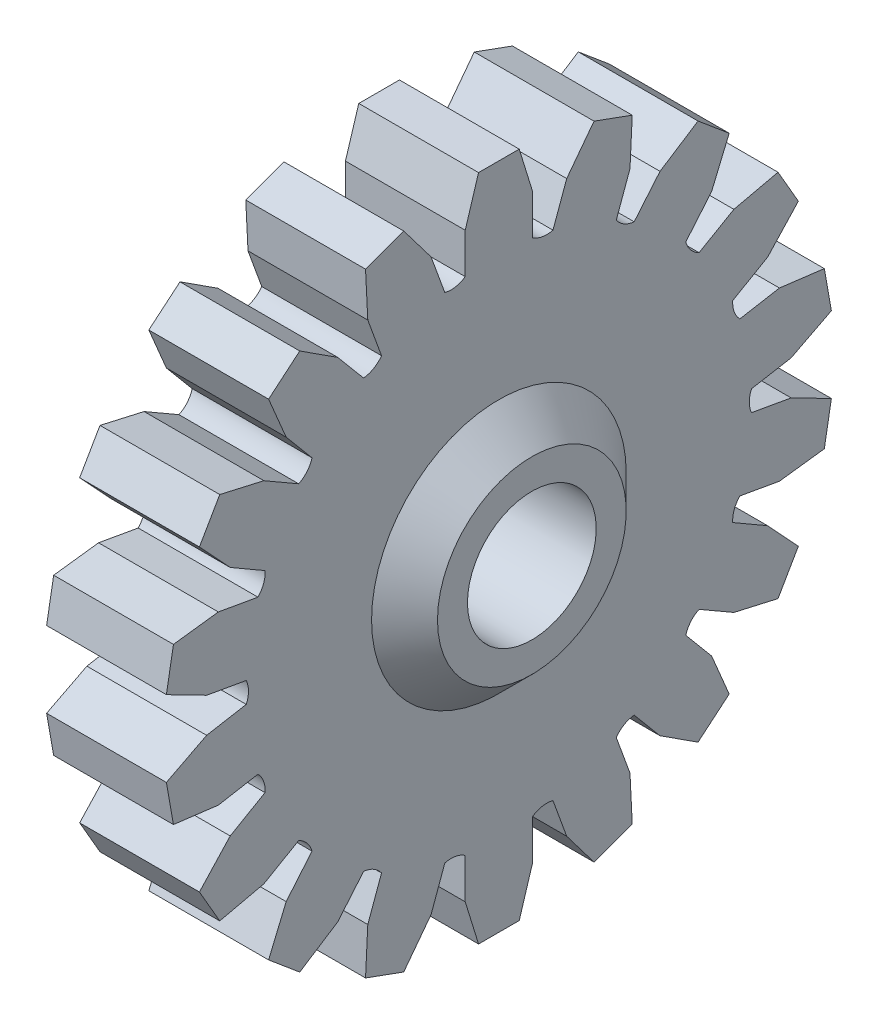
ISO-10303-21;
HEADER;
FILE_DESCRIPTION(('STEP AP214'),'2;1');
FILE_NAME('part.step','',(''),(''),'','','');
FILE_SCHEMA(('AUTOMOTIVE_DESIGN { 1 0 10303 214 1 1 1 1 }'));
ENDSEC;
DATA;
#1=APPLICATION_CONTEXT('core data for automotive mechanical design processes');
#2=APPLICATION_PROTOCOL_DEFINITION('international standard','automotive_design',2000,#1);
#3=PRODUCT_CONTEXT('',#1,'mechanical');
#4=PRODUCT('Part','Part','',(#3));
#5=PRODUCT_RELATED_PRODUCT_CATEGORY('part','',(#4));
#6=PRODUCT_DEFINITION_FORMATION('','',#4);
#7=PRODUCT_DEFINITION_CONTEXT('part definition',#1,'design');
#8=PRODUCT_DEFINITION('design','',#6,#7);
#9=PRODUCT_DEFINITION_SHAPE('','',#8);
#10=(LENGTH_UNIT() NAMED_UNIT(*) SI_UNIT(.MILLI.,.METRE.));
#11=(NAMED_UNIT(*) PLANE_ANGLE_UNIT() SI_UNIT($,.RADIAN.));
#12=(NAMED_UNIT(*) SI_UNIT($,.STERADIAN.) SOLID_ANGLE_UNIT());
#13=UNCERTAINTY_MEASURE_WITH_UNIT(LENGTH_MEASURE(1.E-05),#10,'distance_accuracy_value','');
#14=(GEOMETRIC_REPRESENTATION_CONTEXT(3) GLOBAL_UNCERTAINTY_ASSIGNED_CONTEXT((#13)) GLOBAL_UNIT_ASSIGNED_CONTEXT((#10,
#11,#12)) REPRESENTATION_CONTEXT('',''));
#15=CARTESIAN_POINT('',(0.,0.,0.));
#16=DIRECTION('',(0.,0.,1.));
#17=DIRECTION('',(1.,0.,0.));
#18=AXIS2_PLACEMENT_3D('',#15,#16,#17);
#19=CARTESIAN_POINT('',(4.,9.05707083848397,1.59700595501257));
#20=DIRECTION('',(1.,0.,0.));
#21=DIRECTION('',(0.,0.,-1.));
#22=AXIS2_PLACEMENT_3D('',#19,#20,#21);
#23=PLANE('',#22);
#24=CARTESIAN_POINT('',(4.,7.96465442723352,-4.59839537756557));
#25=DIRECTION('',(-1.,0.,0.));
#26=DIRECTION('',(0.,0.,-1.));
#27=AXIS2_PLACEMENT_3D('',#24,#25,#26);
#28=CIRCLE('',#27,0.834727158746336);
#29=CARTESIAN_POINT('',(4.,7.13380237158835,-4.51805677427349));
#30=VERTEX_POINT('',#29);
#31=CARTESIAN_POINT('',(4.,7.47965312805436,-3.91902569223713));
#32=VERTEX_POINT('',#31);
#33=EDGE_CURVE('E1413',#30,#32,#28,.T.);
#34=ORIENTED_EDGE('',*,*,#33,.T.);
#35=DIRECTION('',(0.,-0.939692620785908,0.342020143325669));
#36=VECTOR('',#35,1.);
#37=CARTESIAN_POINT('',(4.,8.74131059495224,-4.37823145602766));
#38=LINE('',#37,#36);
#39=CARTESIAN_POINT('',(4.,8.74131059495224,-4.37823145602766));
#40=VERTEX_POINT('',#39);
#41=EDGE_CURVE('E712',#40,#32,#38,.T.);
#42=ORIENTED_EDGE('',*,*,#41,.F.);
#43=DIRECTION('',(0.,-0.998762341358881,0.0497371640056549));
#44=VECTOR('',#43,1.);
#45=CARTESIAN_POINT('',(4.,10.2506609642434,-4.45339529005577));
#46=LINE('',#45,#44);
#47=CARTESIAN_POINT('',(4.,10.2506609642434,-4.45339529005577));
#48=VERTEX_POINT('',#47);
#49=EDGE_CURVE('E709',#48,#40,#46,.T.);
#50=ORIENTED_EDGE('',*,*,#49,.F.);
#51=DIRECTION('',(0.,-0.34202014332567,-0.939692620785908));
#52=VECTOR('',#51,1.);
#53=CARTESIAN_POINT('',(4.,10.2506609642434,-4.45339529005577));
#54=LINE('',#53,#52);
#55=CARTESIAN_POINT('',(4.,10.7150491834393,-3.17749914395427));
#56=VERTEX_POINT('',#55);
#57=EDGE_CURVE('E695',#56,#48,#54,.T.);
#58=ORIENTED_EDGE('',*,*,#57,.F.);
#59=DIRECTION('',(0.,0.797066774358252,-0.603891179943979));
#60=VECTOR('',#59,1.);
#61=CARTESIAN_POINT('',(4.,10.7150491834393,-3.17749914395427));
#62=LINE('',#61,#60);
#63=CARTESIAN_POINT('',(4.,9.51050533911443,-2.26488626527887));
#64=VERTEX_POINT('',#63);
#65=EDGE_CURVE('E726',#64,#56,#62,.T.);
#66=ORIENTED_EDGE('',*,*,#65,.F.);
#67=DIRECTION('',(0.,0.939692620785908,-0.34202014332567));
#68=VECTOR('',#67,1.);
#69=CARTESIAN_POINT('',(4.,9.51050533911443,-2.26488626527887));
#70=LINE('',#69,#68);
#71=CARTESIAN_POINT('',(4.,8.24884787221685,-1.80568050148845));
#72=VERTEX_POINT('',#71);
#73=EDGE_CURVE('E1550',#72,#64,#70,.T.);
#74=ORIENTED_EDGE('',*,*,#73,.F.);
#75=CARTESIAN_POINT('',(4.,9.0570708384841,-1.59700595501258));
#76=DIRECTION('',(-1.,0.,0.));
#77=DIRECTION('',(0.,0.,-1.));
#78=AXIS2_PLACEMENT_3D('',#75,#76,#77);
#79=CIRCLE('',#78,0.834727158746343);
#80=CARTESIAN_POINT('',(4.,8.36896057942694,-1.12448748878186));
#81=VERTEX_POINT('',#80);
#82=EDGE_CURVE('E1415',#72,#81,#79,.T.);
#83=ORIENTED_EDGE('',*,*,#82,.T.);
#84=DIRECTION('',(0.,-1.,0.));
#85=VECTOR('',#84,1.);
#86=CARTESIAN_POINT('',(4.,9.71158841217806,-1.12448748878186));
#87=LINE('',#86,#85);
#88=CARTESIAN_POINT('',(4.,9.71158841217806,-1.12448748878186));
#89=VERTEX_POINT('',#88);
#90=EDGE_CURVE('E1341',#89,#81,#87,.T.);
#91=ORIENTED_EDGE('',*,*,#90,.F.);
#92=DIRECTION('',(0.,-0.955540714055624,-0.294859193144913));
#93=VECTOR('',#92,1.);
#94=CARTESIAN_POINT('',(4.,11.1556213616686,-0.678890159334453));
#95=LINE('',#94,#93);
#96=CARTESIAN_POINT('',(4.,11.1556213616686,-0.678890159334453));
#97=VERTEX_POINT('',#96);
#98=EDGE_CURVE('E1345',#97,#89,#95,.T.);
#99=ORIENTED_EDGE('',*,*,#98,.F.);
#100=DIRECTION('',(0.,0.,-1.));
#101=VECTOR('',#100,1.);
#102=CARTESIAN_POINT('',(4.,11.1556213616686,-0.678890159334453));
#103=LINE('',#102,#101);
#104=CARTESIAN_POINT('',(4.,11.1556213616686,0.678890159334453));
#105=VERTEX_POINT('',#104);
#106=EDGE_CURVE('E1321',#105,#97,#103,.T.);
#107=ORIENTED_EDGE('',*,*,#106,.F.);
#108=DIRECTION('',(0.,0.955540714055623,-0.294859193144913));
#109=VECTOR('',#108,1.);
#110=CARTESIAN_POINT('',(4.,11.1556213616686,0.678890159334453));
#111=LINE('',#110,#109);
#112=CARTESIAN_POINT('',(4.,9.71158841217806,1.12448748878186));
#113=VERTEX_POINT('',#112);
#114=EDGE_CURVE('E1334',#113,#105,#111,.T.);
#115=ORIENTED_EDGE('',*,*,#114,.F.);
#116=DIRECTION('',(0.,1.,0.));
#117=VECTOR('',#116,1.);
#118=CARTESIAN_POINT('',(4.,9.71158841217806,1.12448748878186));
#119=LINE('',#118,#117);
#120=CARTESIAN_POINT('',(4.,8.3689605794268,1.12448748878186));
#121=VERTEX_POINT('',#120);
#122=EDGE_CURVE('E1339',#121,#113,#119,.T.);
#123=ORIENTED_EDGE('',*,*,#122,.F.);
#124=CARTESIAN_POINT('',(4.,9.05707083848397,1.59700595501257));
#125=DIRECTION('',(-1.,0.,0.));
#126=DIRECTION('',(0.,0.,-1.));
#127=AXIS2_PLACEMENT_3D('',#124,#125,#126);
#128=CIRCLE('',#127,0.834727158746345);
#129=CARTESIAN_POINT('',(4.,8.24884787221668,1.80568050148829));
#130=VERTEX_POINT('',#129);
#131=EDGE_CURVE('E1364',#121,#130,#128,.T.);
#132=ORIENTED_EDGE('',*,*,#131,.T.);
#133=DIRECTION('',(0.,-0.939692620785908,-0.342020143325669));
#134=VECTOR('',#133,1.);
#135=CARTESIAN_POINT('',(4.,9.51050533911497,2.26488626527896));
#136=LINE('',#135,#134);
#137=CARTESIAN_POINT('',(4.,9.51050533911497,2.26488626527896));
#138=VERTEX_POINT('',#137);
#139=EDGE_CURVE('E1304',#138,#130,#136,.T.);
#140=ORIENTED_EDGE('',*,*,#139,.F.);
#141=DIRECTION('',(0.,-0.797066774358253,-0.603891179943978));
#142=VECTOR('',#141,1.);
#143=CARTESIAN_POINT('',(4.,10.7150491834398,3.17749914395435));
#144=LINE('',#143,#142);
#145=CARTESIAN_POINT('',(4.,10.7150491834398,3.17749914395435));
#146=VERTEX_POINT('',#145);
#147=EDGE_CURVE('E1308',#146,#138,#144,.T.);
#148=ORIENTED_EDGE('',*,*,#147,.F.);
#149=DIRECTION('',(0.,0.342020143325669,-0.939692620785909));
#150=VECTOR('',#149,1.);
#151=CARTESIAN_POINT('',(4.,10.7150491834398,3.17749914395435));
#152=LINE('',#151,#150);
#153=CARTESIAN_POINT('',(4.,10.2506609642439,4.45339529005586));
#154=VERTEX_POINT('',#153);
#155=EDGE_CURVE('E1284',#154,#146,#152,.T.);
#156=ORIENTED_EDGE('',*,*,#155,.F.);
#157=DIRECTION('',(0.,0.998762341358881,0.0497371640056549));
#158=VECTOR('',#157,1.);
#159=CARTESIAN_POINT('',(4.,10.2506609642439,4.45339529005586));
#160=LINE('',#159,#158);
#161=CARTESIAN_POINT('',(4.,8.74131059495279,4.37823145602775));
#162=VERTEX_POINT('',#161);
#163=EDGE_CURVE('E1297',#162,#154,#160,.T.);
#164=ORIENTED_EDGE('',*,*,#163,.F.);
#165=DIRECTION('',(0.,0.939692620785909,0.342020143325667));
#166=VECTOR('',#165,1.);
#167=CARTESIAN_POINT('',(4.,8.74131059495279,4.37823145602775));
#168=LINE('',#167,#166);
#169=CARTESIAN_POINT('',(4.,7.47965312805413,3.91902569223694));
#170=VERTEX_POINT('',#169);
#171=EDGE_CURVE('E1302',#170,#162,#168,.T.);
#172=ORIENTED_EDGE('',*,*,#171,.F.);
#173=CARTESIAN_POINT('',(4.,7.96465442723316,4.59839537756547));
#174=DIRECTION('',(-1.,0.,0.));
#175=DIRECTION('',(0.,0.,-1.));
#176=AXIS2_PLACEMENT_3D('',#173,#174,#175);
#177=CIRCLE('',#176,0.834727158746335);
#178=CARTESIAN_POINT('',(4.,7.13380237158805,4.51805677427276));
#179=VERTEX_POINT('',#178);
#180=EDGE_CURVE('E1367',#170,#179,#177,.T.);
#181=ORIENTED_EDGE('',*,*,#180,.T.);
#182=DIRECTION('',(0.,-0.766044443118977,-0.64278760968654));
#183=VECTOR('',#182,1.);
#184=CARTESIAN_POINT('',(4.,8.1623149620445,5.38108130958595));
#185=LINE('',#184,#183);
#186=CARTESIAN_POINT('',(4.,8.1623149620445,5.38108130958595));
#187=VERTEX_POINT('',#186);
#188=EDGE_CURVE('E1267',#187,#179,#185,.T.);
#189=ORIENTED_EDGE('',*,*,#188,.F.);
#190=DIRECTION('',(0.,-0.542454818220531,-0.840084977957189));
#191=VECTOR('',#190,1.);
#192=CARTESIAN_POINT('',(4.,8.98208393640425,6.65063515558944));
#193=LINE('',#192,#191);
#194=CARTESIAN_POINT('',(4.,8.98208393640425,6.65063515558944));
#195=VERTEX_POINT('',#194);
#196=EDGE_CURVE('E1271',#195,#187,#193,.T.);
#197=ORIENTED_EDGE('',*,*,#196,.F.);
#198=DIRECTION('',(0.,0.642787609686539,-0.766044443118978));
#199=VECTOR('',#198,1.);
#200=CARTESIAN_POINT('',(4.,8.98208393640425,6.65063515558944));
#201=LINE('',#200,#199);
#202=CARTESIAN_POINT('',(4.,8.10931957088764,7.69075522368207));
#203=VERTEX_POINT('',#202);
#204=EDGE_CURVE('E1247',#203,#195,#201,.T.);
#205=ORIENTED_EDGE('',*,*,#204,.F.);
#206=DIRECTION('',(0.,0.921518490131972,0.388334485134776));
#207=VECTOR('',#206,1.);
#208=CARTESIAN_POINT('',(4.,8.10931957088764,7.69075522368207));
#209=LINE('',#208,#207);
#210=CARTESIAN_POINT('',(4.,6.71670171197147,7.10389609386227));
#211=VERTEX_POINT('',#210);
#212=EDGE_CURVE('E1260',#211,#203,#209,.T.);
#213=ORIENTED_EDGE('',*,*,#212,.F.);
#214=DIRECTION('',(0.,0.766044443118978,0.642787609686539));
#215=VECTOR('',#214,1.);
#216=CARTESIAN_POINT('',(4.,6.71670171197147,7.10389609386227));
#217=LINE('',#216,#215);
#218=CARTESIAN_POINT('',(4.,5.68818912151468,6.24087155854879));
#219=VERTEX_POINT('',#218);
#220=EDGE_CURVE('E1265',#219,#211,#217,.T.);
#221=ORIENTED_EDGE('',*,*,#220,.F.);
#222=CARTESIAN_POINT('',(4.,5.91158314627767,7.04515045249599));
#223=DIRECTION('',(-1.,0.,0.));
#224=DIRECTION('',(0.,0.,-1.));
#225=AXIS2_PLACEMENT_3D('',#222,#223,#224);
#226=CIRCLE('',#225,0.834727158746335);
#227=CARTESIAN_POINT('',(4.,5.15831502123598,6.68548872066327));
#228=VERTEX_POINT('',#227);
#229=EDGE_CURVE('E1371',#219,#228,#226,.T.);
#230=ORIENTED_EDGE('',*,*,#229,.T.);
#231=DIRECTION('',(0.,-0.5,-0.866025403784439));
#232=VECTOR('',#231,1.);
#233=CARTESIAN_POINT('',(4.,5.82962893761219,7.84823853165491));
#234=LINE('',#233,#232);
#235=CARTESIAN_POINT('',(4.,5.82962893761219,7.84823853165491));
#236=VERTEX_POINT('',#235);
#237=EDGE_CURVE('E1230',#236,#228,#234,.T.);
#238=ORIENTED_EDGE('',*,*,#237,.F.);
#239=DIRECTION('',(0.,-0.222414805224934,-0.974952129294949));
#240=VECTOR('',#239,1.);
#241=CARTESIAN_POINT('',(4.,6.16574680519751,9.32160641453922));
#242=LINE('',#241,#240);
#243=CARTESIAN_POINT('',(4.,6.16574680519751,9.32160641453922));
#244=VERTEX_POINT('',#243);
#245=EDGE_CURVE('E1234',#244,#236,#242,.T.);
#246=ORIENTED_EDGE('',*,*,#245,.F.);
#247=DIRECTION('',(0.,0.866025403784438,-0.500000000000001));
#248=VECTOR('',#247,1.);
#249=CARTESIAN_POINT('',(4.,6.16574680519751,9.32160641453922));
#250=LINE('',#249,#248);
#251=CARTESIAN_POINT('',(4.,4.98987455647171,10.0004965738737));
#252=VERTEX_POINT('',#251);
#253=EDGE_CURVE('E1210',#252,#244,#250,.T.);
#254=ORIENTED_EDGE('',*,*,#253,.F.);
#255=DIRECTION('',(0.,0.733125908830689,0.680092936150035));
#256=VECTOR('',#255,1.);
#257=CARTESIAN_POINT('',(4.,4.98987455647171,10.0004965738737));
#258=LINE('',#257,#256);
#259=CARTESIAN_POINT('',(4.,3.88195947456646,8.97272602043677));
#260=VERTEX_POINT('',#259);
#261=EDGE_CURVE('E1223',#260,#252,#258,.T.);
#262=ORIENTED_EDGE('',*,*,#261,.F.);
#263=DIRECTION('',(0.,0.5,0.866025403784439));
#264=VECTOR('',#263,1.);
#265=CARTESIAN_POINT('',(4.,3.88195947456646,8.97272602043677));
#266=LINE('',#265,#264);
#267=CARTESIAN_POINT('',(4.,3.21064555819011,7.8099762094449));
#268=VERTEX_POINT('',#267);
#269=EDGE_CURVE('E1228',#268,#260,#266,.T.);
#270=ORIENTED_EDGE('',*,*,#269,.F.);
#271=CARTESIAN_POINT('',(4.,3.14548769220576,8.64215640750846));
#272=DIRECTION('',(-1.,0.,0.));
#273=DIRECTION('',(0.,0.,-1.));
#274=AXIS2_PLACEMENT_3D('',#271,#272,#273);
#275=CIRCLE('',#274,0.834727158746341);
#276=CARTESIAN_POINT('',(4.,2.56065875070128,8.04655206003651));
#277=VERTEX_POINT('',#276);
#278=EDGE_CURVE('E1374',#268,#277,#275,.T.);
#279=ORIENTED_EDGE('',*,*,#278,.T.);
#280=DIRECTION('',(0.,-0.17364817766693,-0.984807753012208));
#281=VECTOR('',#280,1.);
#282=CARTESIAN_POINT('',(4.,2.79380362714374,9.36878235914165));
#283=LINE('',#282,#281);
#284=CARTESIAN_POINT('',(4.,2.79380362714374,9.36878235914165));
#285=VERTEX_POINT('',#284);
#286=EDGE_CURVE('E1193',#285,#277,#283,.T.);
#287=ORIENTED_EDGE('',*,*,#286,.F.);
#288=DIRECTION('',(0.,0.124451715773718,-0.992225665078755));
#289=VECTOR('',#288,1.);
#290=CARTESIAN_POINT('',(4.,2.60572961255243,10.8682543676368));
#291=LINE('',#290,#289);
#292=CARTESIAN_POINT('',(4.,2.60572961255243,10.8682543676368));
#293=VERTEX_POINT('',#292);
#294=EDGE_CURVE('E1197',#293,#285,#291,.T.);
#295=ORIENTED_EDGE('',*,*,#294,.F.);
#296=DIRECTION('',(0.,0.984807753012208,-0.173648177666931));
#297=VECTOR('',#296,1.);
#298=CARTESIAN_POINT('',(4.,2.60572961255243,10.8682543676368));
#299=LINE('',#298,#297);
#300=CARTESIAN_POINT('',(4.,1.26857702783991,11.1040304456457));
#301=VERTEX_POINT('',#300);
#302=EDGE_CURVE('E1173',#301,#293,#299,.T.);
#303=ORIENTED_EDGE('',*,*,#302,.F.);
#304=DIRECTION('',(0.,0.456307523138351,0.889822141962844));
#305=VECTOR('',#304,1.);
#306=CARTESIAN_POINT('',(4.,1.26857702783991,11.1040304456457));
#307=LINE('',#306,#305);
#308=CARTESIAN_POINT('',(4.,0.578995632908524,9.75931276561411));
#309=VERTEX_POINT('',#308);
#310=EDGE_CURVE('E1186',#309,#301,#307,.T.);
#311=ORIENTED_EDGE('',*,*,#310,.F.);
#312=DIRECTION('',(0.,0.173648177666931,0.984807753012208));
#313=VECTOR('',#312,1.);
#314=CARTESIAN_POINT('',(4.,0.578995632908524,9.75931276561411));
#315=LINE('',#314,#313);
#316=CARTESIAN_POINT('',(4.,0.345850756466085,8.4370824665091));
#317=VERTEX_POINT('',#316);
#318=EDGE_CURVE('E1191',#317,#309,#315,.T.);
#319=ORIENTED_EDGE('',*,*,#318,.F.);
#320=CARTESIAN_POINT('',(4.,-3.58737299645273E-13,9.19679075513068));
#321=DIRECTION('',(-1.,0.,0.));
#322=DIRECTION('',(0.,0.,-1.));
#323=AXIS2_PLACEMENT_3D('',#320,#321,#322);
#324=CIRCLE('',#323,0.834727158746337);
#325=CARTESIAN_POINT('',(4.,-0.345850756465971,8.43708246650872));
#326=VERTEX_POINT('',#325);
#327=EDGE_CURVE('E1377',#317,#326,#324,.T.);
#328=ORIENTED_EDGE('',*,*,#327,.T.);
#329=DIRECTION('',(0.,0.173648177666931,-0.984807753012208));
#330=VECTOR('',#329,1.);
#331=CARTESIAN_POINT('',(4.,-0.578995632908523,9.75931276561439));
#332=LINE('',#331,#330);
#333=CARTESIAN_POINT('',(4.,-0.578995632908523,9.75931276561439));
#334=VERTEX_POINT('',#333);
#335=EDGE_CURVE('E1156',#334,#326,#332,.T.);
#336=ORIENTED_EDGE('',*,*,#335,.F.);
#337=DIRECTION('',(0.,0.456307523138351,-0.889822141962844));
#338=VECTOR('',#337,1.);
#339=CARTESIAN_POINT('',(4.,-1.26857702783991,11.104030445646));
#340=LINE('',#339,#338);
#341=CARTESIAN_POINT('',(4.,-1.26857702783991,11.104030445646));
#342=VERTEX_POINT('',#341);
#343=EDGE_CURVE('E1160',#342,#334,#340,.T.);
#344=ORIENTED_EDGE('',*,*,#343,.F.);
#345=DIRECTION('',(0.,0.984807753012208,0.173648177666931));
#346=VECTOR('',#345,1.);
#347=CARTESIAN_POINT('',(4.,-1.26857702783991,11.104030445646));
#348=LINE('',#347,#346);
#349=CARTESIAN_POINT('',(4.,-2.60572961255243,10.8682543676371));
#350=VERTEX_POINT('',#349);
#351=EDGE_CURVE('E1136',#350,#342,#348,.T.);
#352=ORIENTED_EDGE('',*,*,#351,.F.);
#353=DIRECTION('',(0.,0.124451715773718,0.992225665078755));
#354=VECTOR('',#353,1.);
#355=CARTESIAN_POINT('',(4.,-2.60572961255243,10.8682543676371));
#356=LINE('',#355,#354);
#357=CARTESIAN_POINT('',(4.,-2.79380362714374,9.36878235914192));
#358=VERTEX_POINT('',#357);
#359=EDGE_CURVE('E1149',#358,#350,#356,.T.);
#360=ORIENTED_EDGE('',*,*,#359,.F.);
#361=DIRECTION('',(0.,-0.17364817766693,0.984807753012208));
#362=VECTOR('',#361,1.);
#363=CARTESIAN_POINT('',(4.,-2.79380362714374,9.36878235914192));
#364=LINE('',#363,#362);
#365=CARTESIAN_POINT('',(4.,-2.5606587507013,8.04655206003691));
#366=VERTEX_POINT('',#365);
#367=EDGE_CURVE('E1154',#366,#358,#364,.T.);
#368=ORIENTED_EDGE('',*,*,#367,.F.);
#369=CARTESIAN_POINT('',(4.,-3.14548769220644,8.64215640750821));
#370=DIRECTION('',(-1.,0.,0.));
#371=DIRECTION('',(0.,0.,-1.));
#372=AXIS2_PLACEMENT_3D('',#369,#370,#371);
#373=CIRCLE('',#372,0.834727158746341);
#374=CARTESIAN_POINT('',(4.,-3.21064555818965,7.80997620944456));
#375=VERTEX_POINT('',#374);
#376=EDGE_CURVE('E1380',#366,#375,#373,.T.);
#377=ORIENTED_EDGE('',*,*,#376,.T.);
#378=DIRECTION('',(0.,0.500000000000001,-0.866025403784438));
#379=VECTOR('',#378,1.);
#380=CARTESIAN_POINT('',(4.,-3.88195947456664,8.97272602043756));
#381=LINE('',#380,#379);
#382=CARTESIAN_POINT('',(4.,-3.88195947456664,8.97272602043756));
#383=VERTEX_POINT('',#382);
#384=EDGE_CURVE('E1119',#383,#375,#381,.T.);
#385=ORIENTED_EDGE('',*,*,#384,.F.);
#386=DIRECTION('',(0.,0.733125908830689,-0.680092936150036));
#387=VECTOR('',#386,1.);
#388=CARTESIAN_POINT('',(4.,-4.98987455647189,10.0004965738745));
#389=LINE('',#388,#387);
#390=CARTESIAN_POINT('',(4.,-4.98987455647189,10.0004965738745));
#391=VERTEX_POINT('',#390);
#392=EDGE_CURVE('E1123',#391,#383,#389,.T.);
#393=ORIENTED_EDGE('',*,*,#392,.F.);
#394=DIRECTION('',(0.,0.866025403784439,0.499999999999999));
#395=VECTOR('',#394,1.);
#396=CARTESIAN_POINT('',(4.,-4.98987455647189,10.0004965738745));
#397=LINE('',#396,#395);
#398=CARTESIAN_POINT('',(4.,-6.16574680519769,9.32160641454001));
#399=VERTEX_POINT('',#398);
#400=EDGE_CURVE('E1099',#399,#391,#397,.T.);
#401=ORIENTED_EDGE('',*,*,#400,.F.);
#402=DIRECTION('',(0.,-0.222414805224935,0.974952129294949));
#403=VECTOR('',#402,1.);
#404=CARTESIAN_POINT('',(4.,-6.16574680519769,9.32160641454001));
#405=LINE('',#404,#403);
#406=CARTESIAN_POINT('',(4.,-5.82962893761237,7.8482385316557));
#407=VERTEX_POINT('',#406);
#408=EDGE_CURVE('E1112',#407,#399,#405,.T.);
#409=ORIENTED_EDGE('',*,*,#408,.F.);
#410=DIRECTION('',(0.,-0.499999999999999,0.866025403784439));
#411=VECTOR('',#410,1.);
#412=CARTESIAN_POINT('',(4.,-5.82962893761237,7.8482385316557));
#413=LINE('',#412,#411);
#414=CARTESIAN_POINT('',(4.,-5.15831502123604,6.68548872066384));
#415=VERTEX_POINT('',#414);
#416=EDGE_CURVE('E1117',#415,#407,#413,.T.);
#417=ORIENTED_EDGE('',*,*,#416,.F.);
#418=CARTESIAN_POINT('',(4.,-5.91158314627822,7.04515045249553));
#419=DIRECTION('',(-1.,0.,0.));
#420=DIRECTION('',(0.,0.,-1.));
#421=AXIS2_PLACEMENT_3D('',#418,#419,#420);
#422=CIRCLE('',#421,0.834727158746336);
#423=CARTESIAN_POINT('',(4.,-5.68818912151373,6.24087155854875));
#424=VERTEX_POINT('',#423);
#425=EDGE_CURVE('E1383',#415,#424,#422,.T.);
#426=ORIENTED_EDGE('',*,*,#425,.T.);
#427=DIRECTION('',(0.,0.766044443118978,-0.642787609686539));
#428=VECTOR('',#427,1.);
#429=CARTESIAN_POINT('',(4.,-6.71670171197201,7.10389609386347));
#430=LINE('',#429,#428);
#431=CARTESIAN_POINT('',(4.,-6.71670171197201,7.10389609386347));
#432=VERTEX_POINT('',#431);
#433=EDGE_CURVE('E1082',#432,#424,#430,.T.);
#434=ORIENTED_EDGE('',*,*,#433,.F.);
#435=DIRECTION('',(0.,0.921518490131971,-0.388334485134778));
#436=VECTOR('',#435,1.);
#437=CARTESIAN_POINT('',(4.,-8.10931957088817,7.69075522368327));
#438=LINE('',#437,#436);
#439=CARTESIAN_POINT('',(4.,-8.10931957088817,7.69075522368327));
#440=VERTEX_POINT('',#439);
#441=EDGE_CURVE('E1086',#440,#432,#438,.T.);
#442=ORIENTED_EDGE('',*,*,#441,.F.);
#443=DIRECTION('',(0.,0.642787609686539,0.766044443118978));
#444=VECTOR('',#443,1.);
#445=CARTESIAN_POINT('',(4.,-8.10931957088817,7.69075522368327));
#446=LINE('',#445,#444);
#447=CARTESIAN_POINT('',(4.,-8.98208393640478,6.65063515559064));
#448=VERTEX_POINT('',#447);
#449=EDGE_CURVE('E1062',#448,#440,#446,.T.);
#450=ORIENTED_EDGE('',*,*,#449,.F.);
#451=DIRECTION('',(0.,-0.54245481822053,0.84008497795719));
#452=VECTOR('',#451,1.);
#453=CARTESIAN_POINT('',(4.,-8.98208393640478,6.65063515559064));
#454=LINE('',#453,#452);
#455=CARTESIAN_POINT('',(4.,-8.16231496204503,5.38108130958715));
#456=VERTEX_POINT('',#455);
#457=EDGE_CURVE('E1075',#456,#448,#454,.T.);
#458=ORIENTED_EDGE('',*,*,#457,.F.);
#459=DIRECTION('',(0.,-0.766044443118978,0.64278760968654));
#460=VECTOR('',#459,1.);
#461=CARTESIAN_POINT('',(4.,-8.16231496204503,5.38108130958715));
#462=LINE('',#461,#460);
#463=CARTESIAN_POINT('',(4.,-7.13380237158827,4.51805677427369));
#464=VERTEX_POINT('',#463);
#465=EDGE_CURVE('E1080',#464,#456,#462,.T.);
#466=ORIENTED_EDGE('',*,*,#465,.F.);
#467=CARTESIAN_POINT('',(4.,-7.96465442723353,4.59839537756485));
#468=DIRECTION('',(-1.,0.,0.));
#469=DIRECTION('',(0.,0.,-1.));
#470=AXIS2_PLACEMENT_3D('',#467,#468,#469);
#471=CIRCLE('',#470,0.834727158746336);
#472=CARTESIAN_POINT('',(4.,-7.47965312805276,3.91902569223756));
#473=VERTEX_POINT('',#472);
#474=EDGE_CURVE('E1386',#464,#473,#471,.T.);
#475=ORIENTED_EDGE('',*,*,#474,.T.);
#476=DIRECTION('',(0.,0.939692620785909,-0.342020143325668));
#477=VECTOR('',#476,1.);
#478=CARTESIAN_POINT('',(4.,-8.7413105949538,4.37823145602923));
#479=LINE('',#478,#477);
#480=CARTESIAN_POINT('',(4.,-8.7413105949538,4.37823145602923));
#481=VERTEX_POINT('',#480);
#482=EDGE_CURVE('E1045',#481,#473,#479,.T.);
#483=ORIENTED_EDGE('',*,*,#482,.F.);
#484=DIRECTION('',(0.,0.998762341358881,-0.0497371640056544));
#485=VECTOR('',#484,1.);
#486=CARTESIAN_POINT('',(4.,-10.2506609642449,4.45339529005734));
#487=LINE('',#486,#485);
#488=CARTESIAN_POINT('',(4.,-10.2506609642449,4.45339529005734));
#489=VERTEX_POINT('',#488);
#490=EDGE_CURVE('E1049',#489,#481,#487,.T.);
#491=ORIENTED_EDGE('',*,*,#490,.F.);
#492=DIRECTION('',(0.,0.342020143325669,0.939692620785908));
#493=VECTOR('',#492,1.);
#494=CARTESIAN_POINT('',(4.,-10.2506609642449,4.45339529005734));
#495=LINE('',#494,#493);
#496=CARTESIAN_POINT('',(4.,-10.7150491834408,3.17749914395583));
#497=VERTEX_POINT('',#496);
#498=EDGE_CURVE('E1025',#497,#489,#495,.T.);
#499=ORIENTED_EDGE('',*,*,#498,.F.);
#500=DIRECTION('',(0.,-0.797066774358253,0.603891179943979));
#501=VECTOR('',#500,1.);
#502=CARTESIAN_POINT('',(4.,-10.7150491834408,3.17749914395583));
#503=LINE('',#502,#501);
#504=CARTESIAN_POINT('',(4.,-9.51050533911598,2.26488626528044));
#505=VERTEX_POINT('',#504);
#506=EDGE_CURVE('E1038',#505,#497,#503,.T.);
#507=ORIENTED_EDGE('',*,*,#506,.F.);
#508=DIRECTION('',(0.,-0.939692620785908,0.342020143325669));
#509=VECTOR('',#508,1.);
#510=CARTESIAN_POINT('',(4.,-9.51050533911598,2.26488626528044));
#511=LINE('',#510,#509);
#512=CARTESIAN_POINT('',(4.,-8.24884787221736,1.80568050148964));
#513=VERTEX_POINT('',#512);
#514=EDGE_CURVE('E1043',#513,#505,#511,.T.);
#515=ORIENTED_EDGE('',*,*,#514,.F.);
#516=CARTESIAN_POINT('',(4.,-9.05707083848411,1.59700595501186));
#517=DIRECTION('',(-1.,0.,0.));
#518=DIRECTION('',(0.,0.,-1.));
#519=AXIS2_PLACEMENT_3D('',#516,#517,#518);
#520=CIRCLE('',#519,0.834727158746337);
#521=CARTESIAN_POINT('',(4.,-8.36896057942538,1.12448748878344));
#522=VERTEX_POINT('',#521);
#523=EDGE_CURVE('E1389',#513,#522,#520,.T.);
#524=ORIENTED_EDGE('',*,*,#523,.T.);
#525=DIRECTION('',(0.,1.,0.));
#526=VECTOR('',#525,1.);
#527=CARTESIAN_POINT('',(4.,-9.7115884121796,1.12448748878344));
#528=LINE('',#527,#526);
#529=CARTESIAN_POINT('',(4.,-9.7115884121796,1.12448748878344));
#530=VERTEX_POINT('',#529);
#531=EDGE_CURVE('E1008',#530,#522,#528,.T.);
#532=ORIENTED_EDGE('',*,*,#531,.F.);
#533=DIRECTION('',(0.,0.955540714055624,0.294859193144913));
#534=VECTOR('',#533,1.);
#535=CARTESIAN_POINT('',(4.,-11.1556213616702,0.678890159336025));
#536=LINE('',#535,#534);
#537=CARTESIAN_POINT('',(4.,-11.1556213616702,0.678890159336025));
#538=VERTEX_POINT('',#537);
#539=EDGE_CURVE('E1012',#538,#530,#536,.T.);
#540=ORIENTED_EDGE('',*,*,#539,.F.);
#541=DIRECTION('',(0.,0.,1.));
#542=VECTOR('',#541,1.);
#543=CARTESIAN_POINT('',(4.,-11.1556213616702,0.678890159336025));
#544=LINE('',#543,#542);
#545=CARTESIAN_POINT('',(4.,-11.1556213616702,-0.67889015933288));
#546=VERTEX_POINT('',#545);
#547=EDGE_CURVE('E988',#546,#538,#544,.T.);
#548=ORIENTED_EDGE('',*,*,#547,.F.);
#549=DIRECTION('',(0.,-0.955540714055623,0.294859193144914));
#550=VECTOR('',#549,1.);
#551=CARTESIAN_POINT('',(4.,-11.1556213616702,-0.67889015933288));
#552=LINE('',#551,#550);
#553=CARTESIAN_POINT('',(4.,-9.7115884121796,-1.12448748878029));
#554=VERTEX_POINT('',#553);
#555=EDGE_CURVE('E1001',#554,#546,#552,.T.);
#556=ORIENTED_EDGE('',*,*,#555,.F.);
#557=DIRECTION('',(0.,-1.,0.));
#558=VECTOR('',#557,1.);
#559=CARTESIAN_POINT('',(4.,-9.7115884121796,-1.12448748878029));
#560=LINE('',#559,#558);
#561=CARTESIAN_POINT('',(4.,-8.36896057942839,-1.12448748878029));
#562=VERTEX_POINT('',#561);
#563=EDGE_CURVE('E1006',#562,#554,#560,.T.);
#564=ORIENTED_EDGE('',*,*,#563,.F.);
#565=CARTESIAN_POINT('',(4.,-9.05707083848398,-1.59700595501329));
#566=DIRECTION('',(-1.,0.,0.));
#567=DIRECTION('',(0.,0.,-1.));
#568=AXIS2_PLACEMENT_3D('',#565,#566,#567);
#569=CIRCLE('',#568,0.834727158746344);
#570=CARTESIAN_POINT('',(4.,-8.24884787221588,-1.80568050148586));
#571=VERTEX_POINT('',#570);
#572=EDGE_CURVE('E1392',#562,#571,#569,.T.);
#573=ORIENTED_EDGE('',*,*,#572,.T.);
#574=DIRECTION('',(0.,0.939692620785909,0.342020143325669));
#575=VECTOR('',#574,1.);
#576=CARTESIAN_POINT('',(4.,-9.51050533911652,-2.26488626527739));
#577=LINE('',#576,#575);
#578=CARTESIAN_POINT('',(4.,-9.51050533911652,-2.26488626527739));
#579=VERTEX_POINT('',#578);
#580=EDGE_CURVE('E971',#579,#571,#577,.T.);
#581=ORIENTED_EDGE('',*,*,#580,.F.);
#582=DIRECTION('',(0.,0.797066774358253,0.603891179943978));
#583=VECTOR('',#582,1.);
#584=CARTESIAN_POINT('',(4.,-10.7150491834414,-3.17749914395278));
#585=LINE('',#584,#583);
#586=CARTESIAN_POINT('',(4.,-10.7150491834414,-3.17749914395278));
#587=VERTEX_POINT('',#586);
#588=EDGE_CURVE('E975',#587,#579,#585,.T.);
#589=ORIENTED_EDGE('',*,*,#588,.F.);
#590=DIRECTION('',(0.,-0.342020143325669,0.939692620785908));
#591=VECTOR('',#590,1.);
#592=CARTESIAN_POINT('',(4.,-10.7150491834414,-3.17749914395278));
#593=LINE('',#592,#591);
#594=CARTESIAN_POINT('',(4.,-10.2506609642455,-4.45339529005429));
#595=VERTEX_POINT('',#594);
#596=EDGE_CURVE('E951',#595,#587,#593,.T.);
#597=ORIENTED_EDGE('',*,*,#596,.F.);
#598=DIRECTION('',(0.,-0.998762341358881,-0.0497371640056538));
#599=VECTOR('',#598,1.);
#600=CARTESIAN_POINT('',(4.,-10.2506609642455,-4.45339529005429));
#601=LINE('',#600,#599);
#602=CARTESIAN_POINT('',(4.,-8.74131059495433,-4.37823145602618));
#603=VERTEX_POINT('',#602);
#604=EDGE_CURVE('E964',#603,#595,#601,.T.);
#605=ORIENTED_EDGE('',*,*,#604,.F.);
#606=DIRECTION('',(0.,-0.939692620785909,-0.342020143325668));
#607=VECTOR('',#606,1.);
#608=CARTESIAN_POINT('',(4.,-8.74131059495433,-4.37823145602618));
#609=LINE('',#608,#607);
#610=CARTESIAN_POINT('',(4.,-7.47965312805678,-3.91902569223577));
#611=VERTEX_POINT('',#610);
#612=EDGE_CURVE('E969',#611,#603,#609,.T.);
#613=ORIENTED_EDGE('',*,*,#612,.F.);
#614=CARTESIAN_POINT('',(4.,-7.96465442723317,-4.59839537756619));
#615=DIRECTION('',(-1.,0.,0.));
#616=DIRECTION('',(0.,0.,-1.));
#617=AXIS2_PLACEMENT_3D('',#614,#615,#616);
#618=CIRCLE('',#617,0.834727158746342);
#619=CARTESIAN_POINT('',(4.,-7.13380237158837,-4.51805677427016));
#620=VERTEX_POINT('',#619);
#621=EDGE_CURVE('E1395',#611,#620,#618,.T.);
#622=ORIENTED_EDGE('',*,*,#621,.T.);
#623=DIRECTION('',(0.,0.766044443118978,0.64278760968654));
#624=VECTOR('',#623,1.);
#625=CARTESIAN_POINT('',(4.,-8.16231496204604,-5.38108130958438));
#626=LINE('',#625,#624);
#627=CARTESIAN_POINT('',(4.,-8.16231496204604,-5.38108130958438));
#628=VERTEX_POINT('',#627);
#629=EDGE_CURVE('E934',#628,#620,#626,.T.);
#630=ORIENTED_EDGE('',*,*,#629,.F.);
#631=DIRECTION('',(0.,0.542454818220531,0.840084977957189));
#632=VECTOR('',#631,1.);
#633=CARTESIAN_POINT('',(4.,-8.9820839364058,-6.65063515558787));
#634=LINE('',#633,#632);
#635=CARTESIAN_POINT('',(4.,-8.9820839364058,-6.65063515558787));
#636=VERTEX_POINT('',#635);
#637=EDGE_CURVE('E938',#636,#628,#634,.T.);
#638=ORIENTED_EDGE('',*,*,#637,.F.);
#639=DIRECTION('',(0.,-0.642787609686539,0.766044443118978));
#640=VECTOR('',#639,1.);
#641=CARTESIAN_POINT('',(4.,-8.9820839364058,-6.65063515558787));
#642=LINE('',#641,#640);
#643=CARTESIAN_POINT('',(4.,-8.10931957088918,-7.6907552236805));
#644=VERTEX_POINT('',#643);
#645=EDGE_CURVE('E914',#644,#636,#642,.T.);
#646=ORIENTED_EDGE('',*,*,#645,.F.);
#647=DIRECTION('',(0.,-0.921518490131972,-0.388334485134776));
#648=VECTOR('',#647,1.);
#649=CARTESIAN_POINT('',(4.,-8.10931957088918,-7.6907552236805));
#650=LINE('',#649,#648);
#651=CARTESIAN_POINT('',(4.,-6.71670171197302,-7.1038960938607));
#652=VERTEX_POINT('',#651);
#653=EDGE_CURVE('E927',#652,#644,#650,.T.);
#654=ORIENTED_EDGE('',*,*,#653,.F.);
#655=DIRECTION('',(0.,-0.766044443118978,-0.642787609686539));
#656=VECTOR('',#655,1.);
#657=CARTESIAN_POINT('',(4.,-6.71670171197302,-7.1038960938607));
#658=LINE('',#657,#656);
#659=CARTESIAN_POINT('',(4.,-5.68818912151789,-6.24087155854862));
#660=VERTEX_POINT('',#659);
#661=EDGE_CURVE('E932',#660,#652,#658,.T.);
#662=ORIENTED_EDGE('',*,*,#661,.F.);
#663=CARTESIAN_POINT('',(4.,-5.91158314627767,-7.04515045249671));
#664=DIRECTION('',(-1.,0.,0.));
#665=DIRECTION('',(0.,0.,-1.));
#666=AXIS2_PLACEMENT_3D('',#663,#664,#665);
#667=CIRCLE('',#666,0.834727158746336);
#668=CARTESIAN_POINT('',(4.,-5.15831502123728,-6.68548872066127));
#669=VERTEX_POINT('',#668);
#670=EDGE_CURVE('E1398',#660,#669,#667,.T.);
#671=ORIENTED_EDGE('',*,*,#670,.T.);
#672=DIRECTION('',(0.,0.5,0.866025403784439));
#673=VECTOR('',#672,1.);
#674=CARTESIAN_POINT('',(4.,-5.82962893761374,-7.84823853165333));
#675=LINE('',#674,#673);
#676=CARTESIAN_POINT('',(4.,-5.82962893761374,-7.84823853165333));
#677=VERTEX_POINT('',#676);
#678=EDGE_CURVE('E897',#677,#669,#675,.T.);
#679=ORIENTED_EDGE('',*,*,#678,.F.);
#680=DIRECTION('',(0.,0.222414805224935,0.974952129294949));
#681=VECTOR('',#680,1.);
#682=CARTESIAN_POINT('',(4.,-6.16574680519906,-9.32160641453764));
#683=LINE('',#682,#681);
#684=CARTESIAN_POINT('',(4.,-6.16574680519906,-9.32160641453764));
#685=VERTEX_POINT('',#684);
#686=EDGE_CURVE('E901',#685,#677,#683,.T.);
#687=ORIENTED_EDGE('',*,*,#686,.F.);
#688=DIRECTION('',(0.,-0.866025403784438,0.500000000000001));
#689=VECTOR('',#688,1.);
#690=CARTESIAN_POINT('',(4.,-6.16574680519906,-9.32160641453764));
#691=LINE('',#690,#689);
#692=CARTESIAN_POINT('',(4.,-4.98987455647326,-10.0004965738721));
#693=VERTEX_POINT('',#692);
#694=EDGE_CURVE('E877',#693,#685,#691,.T.);
#695=ORIENTED_EDGE('',*,*,#694,.F.);
#696=DIRECTION('',(0.,-0.73312590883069,-0.680092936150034));
#697=VECTOR('',#696,1.);
#698=CARTESIAN_POINT('',(4.,-4.98987455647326,-10.0004965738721));
#699=LINE('',#698,#697);
#700=CARTESIAN_POINT('',(4.,-3.88195947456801,-8.9727260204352));
#701=VERTEX_POINT('',#700);
#702=EDGE_CURVE('E890',#701,#693,#699,.T.);
#703=ORIENTED_EDGE('',*,*,#702,.F.);
#704=DIRECTION('',(0.,-0.500000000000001,-0.866025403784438));
#705=VECTOR('',#704,1.);
#706=CARTESIAN_POINT('',(4.,-3.88195947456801,-8.9727260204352));
#707=LINE('',#706,#705);
#708=CARTESIAN_POINT('',(4.,-3.21064555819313,-7.80997620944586));
#709=VERTEX_POINT('',#708);
#710=EDGE_CURVE('E895',#709,#701,#707,.T.);
#711=ORIENTED_EDGE('',*,*,#710,.F.);
#712=CARTESIAN_POINT('',(4.,-3.14548769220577,-8.64215640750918));
#713=DIRECTION('',(-1.,0.,0.));
#714=DIRECTION('',(0.,0.,-1.));
#715=AXIS2_PLACEMENT_3D('',#712,#713,#714);
#716=CIRCLE('',#715,0.834727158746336);
#717=CARTESIAN_POINT('',(4.,-2.56065875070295,-8.04655206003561));
#718=VERTEX_POINT('',#717);
#719=EDGE_CURVE('E1401',#709,#718,#716,.T.);
#720=ORIENTED_EDGE('',*,*,#719,.T.);
#721=DIRECTION('',(0.,0.17364817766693,0.984807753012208));
#722=VECTOR('',#721,1.);
#723=CARTESIAN_POINT('',(4.,-2.79380362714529,-9.36878235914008));
#724=LINE('',#723,#722);
#725=CARTESIAN_POINT('',(4.,-2.79380362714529,-9.36878235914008));
#726=VERTEX_POINT('',#725);
#727=EDGE_CURVE('E860',#726,#718,#724,.T.);
#728=ORIENTED_EDGE('',*,*,#727,.F.);
#729=DIRECTION('',(0.,-0.124451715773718,0.992225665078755));
#730=VECTOR('',#729,1.);
#731=CARTESIAN_POINT('',(4.,-2.60572961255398,-10.8682543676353));
#732=LINE('',#731,#730);
#733=CARTESIAN_POINT('',(4.,-2.60572961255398,-10.8682543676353));
#734=VERTEX_POINT('',#733);
#735=EDGE_CURVE('E864',#734,#726,#732,.T.);
#736=ORIENTED_EDGE('',*,*,#735,.F.);
#737=DIRECTION('',(0.,-0.984807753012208,0.173648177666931));
#738=VECTOR('',#737,1.);
#739=CARTESIAN_POINT('',(4.,-2.60572961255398,-10.8682543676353));
#740=LINE('',#739,#738);
#741=CARTESIAN_POINT('',(4.,-1.26857702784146,-11.1040304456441));
#742=VERTEX_POINT('',#741);
#743=EDGE_CURVE('E840',#742,#734,#740,.T.);
#744=ORIENTED_EDGE('',*,*,#743,.F.);
#745=DIRECTION('',(0.,-0.45630752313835,-0.889822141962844));
#746=VECTOR('',#745,1.);
#747=CARTESIAN_POINT('',(4.,-1.26857702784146,-11.1040304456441));
#748=LINE('',#747,#746);
#749=CARTESIAN_POINT('',(4.,-0.57899563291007,-9.75931276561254));
#750=VERTEX_POINT('',#749);
#751=EDGE_CURVE('E853',#750,#742,#748,.T.);
#752=ORIENTED_EDGE('',*,*,#751,.F.);
#753=DIRECTION('',(0.,-0.173648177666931,-0.984807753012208));
#754=VECTOR('',#753,1.);
#755=CARTESIAN_POINT('',(4.,-0.57899563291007,-9.75931276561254));
#756=LINE('',#755,#754);
#757=CARTESIAN_POINT('',(4.,-0.345850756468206,-8.43708246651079));
#758=VERTEX_POINT('',#757);
#759=EDGE_CURVE('E858',#758,#750,#756,.T.);
#760=ORIENTED_EDGE('',*,*,#759,.F.);
#761=CARTESIAN_POINT('',(4.,3.54224308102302E-13,-9.1967907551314));
#762=DIRECTION('',(-1.,0.,0.));
#763=DIRECTION('',(0.,0.,-1.));
#764=AXIS2_PLACEMENT_3D('',#761,#762,#763);
#765=CIRCLE('',#764,0.834727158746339);
#766=CARTESIAN_POINT('',(4.,0.345850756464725,-8.43708246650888));
#767=VERTEX_POINT('',#766);
#768=EDGE_CURVE('E1404',#758,#767,#765,.T.);
#769=ORIENTED_EDGE('',*,*,#768,.T.);
#770=DIRECTION('',(0.,-0.17364817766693,0.984807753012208));
#771=VECTOR('',#770,1.);
#772=CARTESIAN_POINT('',(4.,0.578995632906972,-9.75931276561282));
#773=LINE('',#772,#771);
#774=CARTESIAN_POINT('',(4.,0.578995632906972,-9.75931276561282));
#775=VERTEX_POINT('',#774);
#776=EDGE_CURVE('E823',#775,#767,#773,.T.);
#777=ORIENTED_EDGE('',*,*,#776,.F.);
#778=DIRECTION('',(0.,-0.456307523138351,0.889822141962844));
#779=VECTOR('',#778,1.);
#780=CARTESIAN_POINT('',(4.,1.26857702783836,-11.1040304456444));
#781=LINE('',#780,#779);
#782=CARTESIAN_POINT('',(4.,1.26857702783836,-11.1040304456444));
#783=VERTEX_POINT('',#782);
#784=EDGE_CURVE('E827',#783,#775,#781,.T.);
#785=ORIENTED_EDGE('',*,*,#784,.F.);
#786=DIRECTION('',(0.,-0.984807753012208,-0.17364817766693));
#787=VECTOR('',#786,1.);
#788=CARTESIAN_POINT('',(4.,1.26857702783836,-11.1040304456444));
#789=LINE('',#788,#787);
#790=CARTESIAN_POINT('',(4.,2.60572961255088,-10.8682543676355));
#791=VERTEX_POINT('',#790);
#792=EDGE_CURVE('E803',#791,#783,#789,.T.);
#793=ORIENTED_EDGE('',*,*,#792,.F.);
#794=DIRECTION('',(0.,-0.124451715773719,-0.992225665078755));
#795=VECTOR('',#794,1.);
#796=CARTESIAN_POINT('',(4.,2.60572961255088,-10.8682543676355));
#797=LINE('',#796,#795);
#798=CARTESIAN_POINT('',(4.,2.79380362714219,-9.36878235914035));
#799=VERTEX_POINT('',#798);
#800=EDGE_CURVE('E816',#799,#791,#797,.T.);
#801=ORIENTED_EDGE('',*,*,#800,.F.);
#802=DIRECTION('',(0.,0.173648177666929,-0.984807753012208));
#803=VECTOR('',#802,1.);
#804=CARTESIAN_POINT('',(4.,2.79380362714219,-9.36878235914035));
#805=LINE('',#804,#803);
#806=CARTESIAN_POINT('',(4.,2.56065875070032,-8.04655206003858));
#807=VERTEX_POINT('',#806);
#808=EDGE_CURVE('E821',#807,#799,#805,.T.);
#809=ORIENTED_EDGE('',*,*,#808,.F.);
#810=CARTESIAN_POINT('',(4.,3.14548769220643,-8.64215640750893));
#811=DIRECTION('',(-1.,0.,0.));
#812=DIRECTION('',(0.,0.,-1.));
#813=AXIS2_PLACEMENT_3D('',#810,#811,#812);
#814=CIRCLE('',#813,0.834727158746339);
#815=CARTESIAN_POINT('',(4.,3.21064555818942,-7.80997620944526));
#816=VERTEX_POINT('',#815);
#817=EDGE_CURVE('E1407',#807,#816,#814,.T.);
#818=ORIENTED_EDGE('',*,*,#817,.T.);
#819=DIRECTION('',(0.,-0.500000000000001,0.866025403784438));
#820=VECTOR('',#819,1.);
#821=CARTESIAN_POINT('',(4.,3.8819594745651,-8.97272602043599));
#822=LINE('',#821,#820);
#823=CARTESIAN_POINT('',(4.,3.8819594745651,-8.97272602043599));
#824=VERTEX_POINT('',#823);
#825=EDGE_CURVE('E786',#824,#816,#822,.T.);
#826=ORIENTED_EDGE('',*,*,#825,.F.);
#827=DIRECTION('',(0.,-0.733125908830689,0.680092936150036));
#828=VECTOR('',#827,1.);
#829=CARTESIAN_POINT('',(4.,4.98987455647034,-10.0004965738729));
#830=LINE('',#829,#828);
#831=CARTESIAN_POINT('',(4.,4.98987455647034,-10.0004965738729));
#832=VERTEX_POINT('',#831);
#833=EDGE_CURVE('E790',#832,#824,#830,.T.);
#834=ORIENTED_EDGE('',*,*,#833,.F.);
#835=DIRECTION('',(0.,-0.866025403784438,-0.500000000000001));
#836=VECTOR('',#835,1.);
#837=CARTESIAN_POINT('',(4.,4.98987455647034,-10.0004965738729));
#838=LINE('',#837,#836);
#839=CARTESIAN_POINT('',(4.,6.16574680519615,-9.32160641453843));
#840=VERTEX_POINT('',#839);
#841=EDGE_CURVE('E766',#840,#832,#838,.T.);
#842=ORIENTED_EDGE('',*,*,#841,.F.);
#843=DIRECTION('',(0.,0.222414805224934,-0.974952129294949));
#844=VECTOR('',#843,1.);
#845=CARTESIAN_POINT('',(4.,6.16574680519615,-9.32160641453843));
#846=LINE('',#845,#844);
#847=CARTESIAN_POINT('',(4.,5.82962893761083,-7.84823853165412));
#848=VERTEX_POINT('',#847);
#849=EDGE_CURVE('E779',#848,#840,#846,.T.);
#850=ORIENTED_EDGE('',*,*,#849,.F.);
#851=DIRECTION('',(0.,0.5,-0.866025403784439));
#852=VECTOR('',#851,1.);
#853=CARTESIAN_POINT('',(4.,5.82962893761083,-7.84823853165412));
#854=LINE('',#853,#852);
#855=CARTESIAN_POINT('',(4.,5.15831502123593,-6.68548872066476));
#856=VERTEX_POINT('',#855);
#857=EDGE_CURVE('E784',#856,#848,#854,.T.);
#858=ORIENTED_EDGE('',*,*,#857,.F.);
#859=CARTESIAN_POINT('',(4.,5.91158314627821,-7.04515045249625));
#860=DIRECTION('',(-1.,0.,0.));
#861=DIRECTION('',(0.,0.,-1.));
#862=AXIS2_PLACEMENT_3D('',#859,#860,#861);
#863=CIRCLE('',#862,0.834727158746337);
#864=CARTESIAN_POINT('',(4.,5.68818912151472,-6.24087155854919));
#865=VERTEX_POINT('',#864);
#866=EDGE_CURVE('E1410',#856,#865,#863,.T.);
#867=ORIENTED_EDGE('',*,*,#866,.T.);
#868=DIRECTION('',(0.,-0.766044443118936,0.64278760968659));
#869=VECTOR('',#868,1.);
#870=CARTESIAN_POINT('',(4.,6.71670171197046,-7.1038960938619));
#871=LINE('',#870,#869);
#872=CARTESIAN_POINT('',(4.,6.71670171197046,-7.1038960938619));
#873=VERTEX_POINT('',#872);
#874=EDGE_CURVE('E749',#873,#865,#871,.T.);
#875=ORIENTED_EDGE('',*,*,#874,.F.);
#876=DIRECTION('',(0.,-0.921518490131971,0.388334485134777));
#877=VECTOR('',#876,1.);
#878=CARTESIAN_POINT('',(4.,8.10931957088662,-7.6907552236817));
#879=LINE('',#878,#877);
#880=CARTESIAN_POINT('',(4.,8.10931957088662,-7.6907552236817));
#881=VERTEX_POINT('',#880);
#882=EDGE_CURVE('E753',#881,#873,#879,.T.);
#883=ORIENTED_EDGE('',*,*,#882,.F.);
#884=DIRECTION('',(0.,-0.642787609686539,-0.766044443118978));
#885=VECTOR('',#884,1.);
#886=CARTESIAN_POINT('',(4.,8.10931957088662,-7.6907552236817));
#887=LINE('',#886,#885);
#888=CARTESIAN_POINT('',(4.,8.98208393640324,-6.65063515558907));
#889=VERTEX_POINT('',#888);
#890=EDGE_CURVE('E729',#889,#881,#887,.T.);
#891=ORIENTED_EDGE('',*,*,#890,.F.);
#892=DIRECTION('',(0.,0.54245481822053,-0.84008497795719));
#893=VECTOR('',#892,1.);
#894=CARTESIAN_POINT('',(4.,8.98208393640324,-6.65063515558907));
#895=LINE('',#894,#893);
#896=CARTESIAN_POINT('',(4.,8.16231496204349,-5.38108130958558));
#897=VERTEX_POINT('',#896);
#898=EDGE_CURVE('E742',#897,#889,#895,.T.);
#899=ORIENTED_EDGE('',*,*,#898,.F.);
#900=DIRECTION('',(0.,0.766044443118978,-0.64278760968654));
#901=VECTOR('',#900,1.);
#902=CARTESIAN_POINT('',(4.,8.16231496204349,-5.38108130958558));
#903=LINE('',#902,#901);
#904=EDGE_CURVE('E747',#30,#897,#903,.T.);
#905=ORIENTED_EDGE('',*,*,#904,.F.);
#906=EDGE_LOOP('',(#34,#42,#50,#58,#66,#74,#83,#91,#99,#107,#115,#123,#132,#140,#148,#156,#164,
#172,#181,#189,#197,#205,#213,#221,#230,#238,#246,#254,#262,#270,#279,#287,#295,#303,#311,#319,
#328,#336,#344,#352,#360,#368,#377,#385,#393,#401,#409,#417,#426,#434,#442,#450,#458,#466,#475,
#483,#491,#499,#507,#515,#524,#532,#540,#548,#556,#564,#573,#581,#589,#597,#605,#613,#622,#630,
#638,#646,#654,#662,#671,#679,#687,#695,#703,#711,#720,#728,#736,#744,#752,#760,#769,#777,#785,
#793,#801,#809,#818,#826,#834,#842,#850,#858,#867,#875,#883,#891,#899,#905));
#907=FACE_BOUND('',#906,.T.);
#908=CARTESIAN_POINT('',(4.,0.,0.));
#909=DIRECTION('',(1.,0.,0.));
#910=DIRECTION('',(0.,0.,-1.));
#911=AXIS2_PLACEMENT_3D('',#908,#909,#910);
#912=CIRCLE('',#911,4.25204316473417);
#913=CARTESIAN_POINT('',(4.,0.,-4.25204316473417));
#914=VERTEX_POINT('',#913);
#915=EDGE_CURVE('E1358',#914,#914,#912,.T.);
#916=ORIENTED_EDGE('',*,*,#915,.F.);
#917=EDGE_LOOP('',(#916));
#918=FACE_BOUND('',#917,.T.);
#919=ADVANCED_FACE('F34',(#907,#918),#23,.T.);
#920=CARTESIAN_POINT('',(0.,9.05707083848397,1.59700595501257));
#921=DIRECTION('',(1.,0.,0.));
#922=DIRECTION('',(0.,0.,-1.));
#923=AXIS2_PLACEMENT_3D('',#920,#921,#922);
#924=PLANE('',#923);
#925=DIRECTION('',(0.,-0.939692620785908,0.342020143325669));
#926=VECTOR('',#925,1.);
#927=CARTESIAN_POINT('',(0.,8.74131059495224,-4.37823145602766));
#928=LINE('',#927,#926);
#929=CARTESIAN_POINT('',(0.,8.74131059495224,-4.37823145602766));
#930=VERTEX_POINT('',#929);
#931=CARTESIAN_POINT('',(0.,7.47965312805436,-3.91902569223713));
#932=VERTEX_POINT('',#931);
#933=EDGE_CURVE('E1540',#930,#932,#928,.T.);
#934=ORIENTED_EDGE('',*,*,#933,.T.);
#935=CARTESIAN_POINT('',(0.,7.96465442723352,-4.59839537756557));
#936=DIRECTION('',(-1.,0.,0.));
#937=DIRECTION('',(0.,0.,-1.));
#938=AXIS2_PLACEMENT_3D('',#935,#936,#937);
#939=CIRCLE('',#938,0.834727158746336);
#940=CARTESIAN_POINT('',(0.,7.13380237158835,-4.51805677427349));
#941=VERTEX_POINT('',#940);
#942=EDGE_CURVE('E48',#941,#932,#939,.T.);
#943=ORIENTED_EDGE('',*,*,#942,.F.);
#944=DIRECTION('',(0.,0.766044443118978,-0.64278760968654));
#945=VECTOR('',#944,1.);
#946=CARTESIAN_POINT('',(0.,8.16231496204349,-5.38108130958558));
#947=LINE('',#946,#945);
#948=CARTESIAN_POINT('',(0.,8.16231496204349,-5.38108130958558));
#949=VERTEX_POINT('',#948);
#950=EDGE_CURVE('E727',#941,#949,#947,.T.);
#951=ORIENTED_EDGE('',*,*,#950,.T.);
#952=DIRECTION('',(0.,0.54245481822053,-0.84008497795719));
#953=VECTOR('',#952,1.);
#954=CARTESIAN_POINT('',(0.,8.98208393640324,-6.65063515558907));
#955=LINE('',#954,#953);
#956=CARTESIAN_POINT('',(0.,8.98208393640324,-6.65063515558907));
#957=VERTEX_POINT('',#956);
#958=EDGE_CURVE('E725',#949,#957,#955,.T.);
#959=ORIENTED_EDGE('',*,*,#958,.T.);
#960=DIRECTION('',(0.,-0.642787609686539,-0.766044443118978));
#961=VECTOR('',#960,1.);
#962=CARTESIAN_POINT('',(0.,8.10931957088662,-7.6907552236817));
#963=LINE('',#962,#961);
#964=CARTESIAN_POINT('',(0.,8.10931957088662,-7.6907552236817));
#965=VERTEX_POINT('',#964);
#966=EDGE_CURVE('E736',#957,#965,#963,.T.);
#967=ORIENTED_EDGE('',*,*,#966,.T.);
#968=DIRECTION('',(0.,-0.921518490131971,0.388334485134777));
#969=VECTOR('',#968,1.);
#970=CARTESIAN_POINT('',(0.,8.10931957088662,-7.6907552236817));
#971=LINE('',#970,#969);
#972=CARTESIAN_POINT('',(0.,6.71670171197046,-7.1038960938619));
#973=VERTEX_POINT('',#972);
#974=EDGE_CURVE('E733',#965,#973,#971,.T.);
#975=ORIENTED_EDGE('',*,*,#974,.T.);
#976=DIRECTION('',(0.,-0.766044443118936,0.64278760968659));
#977=VECTOR('',#976,1.);
#978=CARTESIAN_POINT('',(0.,6.71670171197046,-7.1038960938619));
#979=LINE('',#978,#977);
#980=CARTESIAN_POINT('',(0.,5.68818912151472,-6.24087155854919));
#981=VERTEX_POINT('',#980);
#982=EDGE_CURVE('E730',#973,#981,#979,.T.);
#983=ORIENTED_EDGE('',*,*,#982,.T.);
#984=CARTESIAN_POINT('',(0.,5.91158314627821,-7.04515045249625));
#985=DIRECTION('',(-1.,0.,0.));
#986=DIRECTION('',(0.,0.,-1.));
#987=AXIS2_PLACEMENT_3D('',#984,#985,#986);
#988=CIRCLE('',#987,0.834727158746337);
#989=CARTESIAN_POINT('',(0.,5.15831502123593,-6.68548872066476));
#990=VERTEX_POINT('',#989);
#991=EDGE_CURVE('E1447',#990,#981,#988,.T.);
#992=ORIENTED_EDGE('',*,*,#991,.F.);
#993=DIRECTION('',(0.,0.5,-0.866025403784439));
#994=VECTOR('',#993,1.);
#995=CARTESIAN_POINT('',(0.,5.82962893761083,-7.84823853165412));
#996=LINE('',#995,#994);
#997=CARTESIAN_POINT('',(0.,5.82962893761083,-7.84823853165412));
#998=VERTEX_POINT('',#997);
#999=EDGE_CURVE('E764',#990,#998,#996,.T.);
#1000=ORIENTED_EDGE('',*,*,#999,.T.);
#1001=DIRECTION('',(0.,0.222414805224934,-0.974952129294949));
#1002=VECTOR('',#1001,1.);
#1003=CARTESIAN_POINT('',(0.,6.16574680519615,-9.32160641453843));
#1004=LINE('',#1003,#1002);
#1005=CARTESIAN_POINT('',(0.,6.16574680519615,-9.32160641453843));
#1006=VERTEX_POINT('',#1005);
#1007=EDGE_CURVE('E763',#998,#1006,#1004,.T.);
#1008=ORIENTED_EDGE('',*,*,#1007,.T.);
#1009=DIRECTION('',(0.,-0.866025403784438,-0.500000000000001));
#1010=VECTOR('',#1009,1.);
#1011=CARTESIAN_POINT('',(0.,4.98987455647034,-10.0004965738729));
#1012=LINE('',#1011,#1010);
#1013=CARTESIAN_POINT('',(0.,4.98987455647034,-10.0004965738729));
#1014=VERTEX_POINT('',#1013);
#1015=EDGE_CURVE('E773',#1006,#1014,#1012,.T.);
#1016=ORIENTED_EDGE('',*,*,#1015,.T.);
#1017=DIRECTION('',(0.,-0.733125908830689,0.680092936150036));
#1018=VECTOR('',#1017,1.);
#1019=CARTESIAN_POINT('',(0.,4.98987455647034,-10.0004965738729));
#1020=LINE('',#1019,#1018);
#1021=CARTESIAN_POINT('',(0.,3.8819594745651,-8.97272602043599));
#1022=VERTEX_POINT('',#1021);
#1023=EDGE_CURVE('E770',#1014,#1022,#1020,.T.);
#1024=ORIENTED_EDGE('',*,*,#1023,.T.);
#1025=DIRECTION('',(0.,-0.5,0.866025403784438));
#1026=VECTOR('',#1025,1.);
#1027=CARTESIAN_POINT('',(0.,3.8819594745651,-8.97272602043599));
#1028=LINE('',#1027,#1026);
#1029=CARTESIAN_POINT('',(0.,3.21064555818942,-7.80997620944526));
#1030=VERTEX_POINT('',#1029);
#1031=EDGE_CURVE('E767',#1022,#1030,#1028,.T.);
#1032=ORIENTED_EDGE('',*,*,#1031,.T.);
#1033=CARTESIAN_POINT('',(0.,3.14548769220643,-8.64215640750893));
#1034=DIRECTION('',(-1.,0.,0.));
#1035=DIRECTION('',(0.,0.,-1.));
#1036=AXIS2_PLACEMENT_3D('',#1033,#1034,#1035);
#1037=CIRCLE('',#1036,0.834727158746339);
#1038=CARTESIAN_POINT('',(0.,2.56065875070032,-8.04655206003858));
#1039=VERTEX_POINT('',#1038);
#1040=EDGE_CURVE('E1445',#1039,#1030,#1037,.T.);
#1041=ORIENTED_EDGE('',*,*,#1040,.F.);
#1042=DIRECTION('',(0.,0.173648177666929,-0.984807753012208));
#1043=VECTOR('',#1042,1.);
#1044=CARTESIAN_POINT('',(0.,2.79380362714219,-9.36878235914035));
#1045=LINE('',#1044,#1043);
#1046=CARTESIAN_POINT('',(0.,2.79380362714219,-9.36878235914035));
#1047=VERTEX_POINT('',#1046);
#1048=EDGE_CURVE('E801',#1039,#1047,#1045,.T.);
#1049=ORIENTED_EDGE('',*,*,#1048,.T.);
#1050=DIRECTION('',(0.,-0.124451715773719,-0.992225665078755));
#1051=VECTOR('',#1050,1.);
#1052=CARTESIAN_POINT('',(0.,2.60572961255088,-10.8682543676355));
#1053=LINE('',#1052,#1051);
#1054=CARTESIAN_POINT('',(0.,2.60572961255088,-10.8682543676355));
#1055=VERTEX_POINT('',#1054);
#1056=EDGE_CURVE('E800',#1047,#1055,#1053,.T.);
#1057=ORIENTED_EDGE('',*,*,#1056,.T.);
#1058=DIRECTION('',(0.,-0.984807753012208,-0.17364817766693));
#1059=VECTOR('',#1058,1.);
#1060=CARTESIAN_POINT('',(0.,1.26857702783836,-11.1040304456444));
#1061=LINE('',#1060,#1059);
#1062=CARTESIAN_POINT('',(0.,1.26857702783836,-11.1040304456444));
#1063=VERTEX_POINT('',#1062);
#1064=EDGE_CURVE('E810',#1055,#1063,#1061,.T.);
#1065=ORIENTED_EDGE('',*,*,#1064,.T.);
#1066=DIRECTION('',(0.,-0.456307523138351,0.889822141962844));
#1067=VECTOR('',#1066,1.);
#1068=CARTESIAN_POINT('',(0.,1.26857702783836,-11.1040304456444));
#1069=LINE('',#1068,#1067);
#1070=CARTESIAN_POINT('',(0.,0.578995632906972,-9.75931276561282));
#1071=VERTEX_POINT('',#1070);
#1072=EDGE_CURVE('E807',#1063,#1071,#1069,.T.);
#1073=ORIENTED_EDGE('',*,*,#1072,.T.);
#1074=DIRECTION('',(0.,-0.17364817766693,0.984807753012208));
#1075=VECTOR('',#1074,1.);
#1076=CARTESIAN_POINT('',(0.,0.578995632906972,-9.75931276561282));
#1077=LINE('',#1076,#1075);
#1078=CARTESIAN_POINT('',(0.,0.345850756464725,-8.43708246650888));
#1079=VERTEX_POINT('',#1078);
#1080=EDGE_CURVE('E804',#1071,#1079,#1077,.T.);
#1081=ORIENTED_EDGE('',*,*,#1080,.T.);
#1082=CARTESIAN_POINT('',(0.,3.54224308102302E-13,-9.1967907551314));
#1083=DIRECTION('',(-1.,0.,0.));
#1084=DIRECTION('',(0.,0.,-1.));
#1085=AXIS2_PLACEMENT_3D('',#1082,#1083,#1084);
#1086=CIRCLE('',#1085,0.834727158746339);
#1087=CARTESIAN_POINT('',(0.,-0.345850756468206,-8.43708246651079));
#1088=VERTEX_POINT('',#1087);
#1089=EDGE_CURVE('E1443',#1088,#1079,#1086,.T.);
#1090=ORIENTED_EDGE('',*,*,#1089,.F.);
#1091=DIRECTION('',(0.,-0.173648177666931,-0.984807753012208));
#1092=VECTOR('',#1091,1.);
#1093=CARTESIAN_POINT('',(0.,-0.57899563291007,-9.75931276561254));
#1094=LINE('',#1093,#1092);
#1095=CARTESIAN_POINT('',(0.,-0.57899563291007,-9.75931276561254));
#1096=VERTEX_POINT('',#1095);
#1097=EDGE_CURVE('E838',#1088,#1096,#1094,.T.);
#1098=ORIENTED_EDGE('',*,*,#1097,.T.);
#1099=DIRECTION('',(0.,-0.45630752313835,-0.889822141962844));
#1100=VECTOR('',#1099,1.);
#1101=CARTESIAN_POINT('',(0.,-1.26857702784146,-11.1040304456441));
#1102=LINE('',#1101,#1100);
#1103=CARTESIAN_POINT('',(0.,-1.26857702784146,-11.1040304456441));
#1104=VERTEX_POINT('',#1103);
#1105=EDGE_CURVE('E837',#1096,#1104,#1102,.T.);
#1106=ORIENTED_EDGE('',*,*,#1105,.T.);
#1107=DIRECTION('',(0.,-0.984807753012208,0.173648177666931));
#1108=VECTOR('',#1107,1.);
#1109=CARTESIAN_POINT('',(0.,-2.60572961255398,-10.8682543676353));
#1110=LINE('',#1109,#1108);
#1111=CARTESIAN_POINT('',(0.,-2.60572961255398,-10.8682543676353));
#1112=VERTEX_POINT('',#1111);
#1113=EDGE_CURVE('E847',#1104,#1112,#1110,.T.);
#1114=ORIENTED_EDGE('',*,*,#1113,.T.);
#1115=DIRECTION('',(0.,-0.124451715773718,0.992225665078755));
#1116=VECTOR('',#1115,1.);
#1117=CARTESIAN_POINT('',(0.,-2.60572961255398,-10.8682543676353));
#1118=LINE('',#1117,#1116);
#1119=CARTESIAN_POINT('',(0.,-2.79380362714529,-9.36878235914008));
#1120=VERTEX_POINT('',#1119);
#1121=EDGE_CURVE('E844',#1112,#1120,#1118,.T.);
#1122=ORIENTED_EDGE('',*,*,#1121,.T.);
#1123=DIRECTION('',(0.,0.17364817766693,0.984807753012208));
#1124=VECTOR('',#1123,1.);
#1125=CARTESIAN_POINT('',(0.,-2.79380362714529,-9.36878235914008));
#1126=LINE('',#1125,#1124);
#1127=CARTESIAN_POINT('',(0.,-2.56065875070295,-8.04655206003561));
#1128=VERTEX_POINT('',#1127);
#1129=EDGE_CURVE('E841',#1120,#1128,#1126,.T.);
#1130=ORIENTED_EDGE('',*,*,#1129,.T.);
#1131=CARTESIAN_POINT('',(0.,-3.14548769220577,-8.64215640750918));
#1132=DIRECTION('',(-1.,0.,0.));
#1133=DIRECTION('',(0.,0.,-1.));
#1134=AXIS2_PLACEMENT_3D('',#1131,#1132,#1133);
#1135=CIRCLE('',#1134,0.834727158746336);
#1136=CARTESIAN_POINT('',(0.,-3.21064555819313,-7.80997620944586));
#1137=VERTEX_POINT('',#1136);
#1138=EDGE_CURVE('E1441',#1137,#1128,#1135,.T.);
#1139=ORIENTED_EDGE('',*,*,#1138,.F.);
#1140=DIRECTION('',(0.,-0.500000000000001,-0.866025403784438));
#1141=VECTOR('',#1140,1.);
#1142=CARTESIAN_POINT('',(0.,-3.88195947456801,-8.9727260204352));
#1143=LINE('',#1142,#1141);
#1144=CARTESIAN_POINT('',(0.,-3.88195947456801,-8.9727260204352));
#1145=VERTEX_POINT('',#1144);
#1146=EDGE_CURVE('E875',#1137,#1145,#1143,.T.);
#1147=ORIENTED_EDGE('',*,*,#1146,.T.);
#1148=DIRECTION('',(0.,-0.73312590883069,-0.680092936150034));
#1149=VECTOR('',#1148,1.);
#1150=CARTESIAN_POINT('',(0.,-4.98987455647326,-10.0004965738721));
#1151=LINE('',#1150,#1149);
#1152=CARTESIAN_POINT('',(0.,-4.98987455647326,-10.0004965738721));
#1153=VERTEX_POINT('',#1152);
#1154=EDGE_CURVE('E874',#1145,#1153,#1151,.T.);
#1155=ORIENTED_EDGE('',*,*,#1154,.T.);
#1156=DIRECTION('',(0.,-0.866025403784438,0.500000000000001));
#1157=VECTOR('',#1156,1.);
#1158=CARTESIAN_POINT('',(0.,-6.16574680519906,-9.32160641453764));
#1159=LINE('',#1158,#1157);
#1160=CARTESIAN_POINT('',(0.,-6.16574680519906,-9.32160641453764));
#1161=VERTEX_POINT('',#1160);
#1162=EDGE_CURVE('E884',#1153,#1161,#1159,.T.);
#1163=ORIENTED_EDGE('',*,*,#1162,.T.);
#1164=DIRECTION('',(0.,0.222414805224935,0.974952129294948));
#1165=VECTOR('',#1164,1.);
#1166=CARTESIAN_POINT('',(0.,-6.16574680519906,-9.32160641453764));
#1167=LINE('',#1166,#1165);
#1168=CARTESIAN_POINT('',(0.,-5.82962893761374,-7.84823853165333));
#1169=VERTEX_POINT('',#1168);
#1170=EDGE_CURVE('E881',#1161,#1169,#1167,.T.);
#1171=ORIENTED_EDGE('',*,*,#1170,.T.);
#1172=DIRECTION('',(0.,0.5,0.866025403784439));
#1173=VECTOR('',#1172,1.);
#1174=CARTESIAN_POINT('',(0.,-5.82962893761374,-7.84823853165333));
#1175=LINE('',#1174,#1173);
#1176=CARTESIAN_POINT('',(0.,-5.15831502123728,-6.68548872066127));
#1177=VERTEX_POINT('',#1176);
#1178=EDGE_CURVE('E878',#1169,#1177,#1175,.T.);
#1179=ORIENTED_EDGE('',*,*,#1178,.T.);
#1180=CARTESIAN_POINT('',(0.,-5.91158314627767,-7.04515045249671));
#1181=DIRECTION('',(-1.,0.,0.));
#1182=DIRECTION('',(0.,0.,-1.));
#1183=AXIS2_PLACEMENT_3D('',#1180,#1181,#1182);
#1184=CIRCLE('',#1183,0.834727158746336);
#1185=CARTESIAN_POINT('',(0.,-5.68818912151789,-6.24087155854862));
#1186=VERTEX_POINT('',#1185);
#1187=EDGE_CURVE('E1439',#1186,#1177,#1184,.T.);
#1188=ORIENTED_EDGE('',*,*,#1187,.F.);
#1189=DIRECTION('',(0.,-0.766044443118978,-0.642787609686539));
#1190=VECTOR('',#1189,1.);
#1191=CARTESIAN_POINT('',(0.,-6.71670171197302,-7.1038960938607));
#1192=LINE('',#1191,#1190);
#1193=CARTESIAN_POINT('',(0.,-6.71670171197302,-7.1038960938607));
#1194=VERTEX_POINT('',#1193);
#1195=EDGE_CURVE('E912',#1186,#1194,#1192,.T.);
#1196=ORIENTED_EDGE('',*,*,#1195,.T.);
#1197=DIRECTION('',(0.,-0.921518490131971,-0.388334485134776));
#1198=VECTOR('',#1197,1.);
#1199=CARTESIAN_POINT('',(0.,-8.10931957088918,-7.6907552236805));
#1200=LINE('',#1199,#1198);
#1201=CARTESIAN_POINT('',(0.,-8.10931957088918,-7.6907552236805));
#1202=VERTEX_POINT('',#1201);
#1203=EDGE_CURVE('E911',#1194,#1202,#1200,.T.);
#1204=ORIENTED_EDGE('',*,*,#1203,.T.);
#1205=DIRECTION('',(0.,-0.642787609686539,0.766044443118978));
#1206=VECTOR('',#1205,1.);
#1207=CARTESIAN_POINT('',(0.,-8.9820839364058,-6.65063515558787));
#1208=LINE('',#1207,#1206);
#1209=CARTESIAN_POINT('',(0.,-8.9820839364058,-6.65063515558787));
#1210=VERTEX_POINT('',#1209);
#1211=EDGE_CURVE('E921',#1202,#1210,#1208,.T.);
#1212=ORIENTED_EDGE('',*,*,#1211,.T.);
#1213=DIRECTION('',(0.,0.542454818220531,0.840084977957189));
#1214=VECTOR('',#1213,1.);
#1215=CARTESIAN_POINT('',(0.,-8.9820839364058,-6.65063515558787));
#1216=LINE('',#1215,#1214);
#1217=CARTESIAN_POINT('',(0.,-8.16231496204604,-5.38108130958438));
#1218=VERTEX_POINT('',#1217);
#1219=EDGE_CURVE('E918',#1210,#1218,#1216,.T.);
#1220=ORIENTED_EDGE('',*,*,#1219,.T.);
#1221=DIRECTION('',(0.,0.766044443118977,0.64278760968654));
#1222=VECTOR('',#1221,1.);
#1223=CARTESIAN_POINT('',(0.,-8.16231496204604,-5.38108130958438));
#1224=LINE('',#1223,#1222);
#1225=CARTESIAN_POINT('',(0.,-7.13380237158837,-4.51805677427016));
#1226=VERTEX_POINT('',#1225);
#1227=EDGE_CURVE('E915',#1218,#1226,#1224,.T.);
#1228=ORIENTED_EDGE('',*,*,#1227,.T.);
#1229=CARTESIAN_POINT('',(0.,-7.96465442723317,-4.59839537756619));
#1230=DIRECTION('',(-1.,0.,0.));
#1231=DIRECTION('',(0.,0.,-1.));
#1232=AXIS2_PLACEMENT_3D('',#1229,#1230,#1231);
#1233=CIRCLE('',#1232,0.834727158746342);
#1234=CARTESIAN_POINT('',(0.,-7.47965312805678,-3.91902569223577));
#1235=VERTEX_POINT('',#1234);
#1236=EDGE_CURVE('E1437',#1235,#1226,#1233,.T.);
#1237=ORIENTED_EDGE('',*,*,#1236,.F.);
#1238=DIRECTION('',(0.,-0.939692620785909,-0.342020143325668));
#1239=VECTOR('',#1238,1.);
#1240=CARTESIAN_POINT('',(0.,-8.74131059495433,-4.37823145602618));
#1241=LINE('',#1240,#1239);
#1242=CARTESIAN_POINT('',(0.,-8.74131059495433,-4.37823145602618));
#1243=VERTEX_POINT('',#1242);
#1244=EDGE_CURVE('E949',#1235,#1243,#1241,.T.);
#1245=ORIENTED_EDGE('',*,*,#1244,.T.);
#1246=DIRECTION('',(0.,-0.998762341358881,-0.0497371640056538));
#1247=VECTOR('',#1246,1.);
#1248=CARTESIAN_POINT('',(0.,-10.2506609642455,-4.45339529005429));
#1249=LINE('',#1248,#1247);
#1250=CARTESIAN_POINT('',(0.,-10.2506609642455,-4.45339529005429));
#1251=VERTEX_POINT('',#1250);
#1252=EDGE_CURVE('E948',#1243,#1251,#1249,.T.);
#1253=ORIENTED_EDGE('',*,*,#1252,.T.);
#1254=DIRECTION('',(0.,-0.342020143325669,0.939692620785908));
#1255=VECTOR('',#1254,1.);
#1256=CARTESIAN_POINT('',(0.,-10.7150491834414,-3.17749914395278));
#1257=LINE('',#1256,#1255);
#1258=CARTESIAN_POINT('',(0.,-10.7150491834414,-3.17749914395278));
#1259=VERTEX_POINT('',#1258);
#1260=EDGE_CURVE('E958',#1251,#1259,#1257,.T.);
#1261=ORIENTED_EDGE('',*,*,#1260,.T.);
#1262=DIRECTION('',(0.,0.797066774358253,0.603891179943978));
#1263=VECTOR('',#1262,1.);
#1264=CARTESIAN_POINT('',(0.,-10.7150491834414,-3.17749914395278));
#1265=LINE('',#1264,#1263);
#1266=CARTESIAN_POINT('',(0.,-9.51050533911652,-2.26488626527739));
#1267=VERTEX_POINT('',#1266);
#1268=EDGE_CURVE('E955',#1259,#1267,#1265,.T.);
#1269=ORIENTED_EDGE('',*,*,#1268,.T.);
#1270=DIRECTION('',(0.,0.939692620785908,0.342020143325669));
#1271=VECTOR('',#1270,1.);
#1272=CARTESIAN_POINT('',(0.,-9.51050533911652,-2.26488626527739));
#1273=LINE('',#1272,#1271);
#1274=CARTESIAN_POINT('',(0.,-8.24884787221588,-1.80568050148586));
#1275=VERTEX_POINT('',#1274);
#1276=EDGE_CURVE('E952',#1267,#1275,#1273,.T.);
#1277=ORIENTED_EDGE('',*,*,#1276,.T.);
#1278=CARTESIAN_POINT('',(0.,-9.05707083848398,-1.59700595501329));
#1279=DIRECTION('',(-1.,0.,0.));
#1280=DIRECTION('',(0.,0.,-1.));
#1281=AXIS2_PLACEMENT_3D('',#1278,#1279,#1280);
#1282=CIRCLE('',#1281,0.834727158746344);
#1283=CARTESIAN_POINT('',(0.,-8.36896057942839,-1.12448748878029));
#1284=VERTEX_POINT('',#1283);
#1285=EDGE_CURVE('E1435',#1284,#1275,#1282,.T.);
#1286=ORIENTED_EDGE('',*,*,#1285,.F.);
#1287=DIRECTION('',(0.,-1.,0.));
#1288=VECTOR('',#1287,1.);
#1289=CARTESIAN_POINT('',(0.,-9.7115884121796,-1.12448748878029));
#1290=LINE('',#1289,#1288);
#1291=CARTESIAN_POINT('',(0.,-9.7115884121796,-1.12448748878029));
#1292=VERTEX_POINT('',#1291);
#1293=EDGE_CURVE('E986',#1284,#1292,#1290,.T.);
#1294=ORIENTED_EDGE('',*,*,#1293,.T.);
#1295=DIRECTION('',(0.,-0.955540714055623,0.294859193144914));
#1296=VECTOR('',#1295,1.);
#1297=CARTESIAN_POINT('',(0.,-11.1556213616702,-0.67889015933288));
#1298=LINE('',#1297,#1296);
#1299=CARTESIAN_POINT('',(0.,-11.1556213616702,-0.67889015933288));
#1300=VERTEX_POINT('',#1299);
#1301=EDGE_CURVE('E985',#1292,#1300,#1298,.T.);
#1302=ORIENTED_EDGE('',*,*,#1301,.T.);
#1303=DIRECTION('',(0.,0.,1.));
#1304=VECTOR('',#1303,1.);
#1305=CARTESIAN_POINT('',(0.,-11.1556213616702,0.678890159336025));
#1306=LINE('',#1305,#1304);
#1307=CARTESIAN_POINT('',(0.,-11.1556213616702,0.678890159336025));
#1308=VERTEX_POINT('',#1307);
#1309=EDGE_CURVE('E995',#1300,#1308,#1306,.T.);
#1310=ORIENTED_EDGE('',*,*,#1309,.T.);
#1311=DIRECTION('',(0.,0.955540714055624,0.294859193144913));
#1312=VECTOR('',#1311,1.);
#1313=CARTESIAN_POINT('',(0.,-11.1556213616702,0.678890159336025));
#1314=LINE('',#1313,#1312);
#1315=CARTESIAN_POINT('',(0.,-9.7115884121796,1.12448748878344));
#1316=VERTEX_POINT('',#1315);
#1317=EDGE_CURVE('E992',#1308,#1316,#1314,.T.);
#1318=ORIENTED_EDGE('',*,*,#1317,.T.);
#1319=DIRECTION('',(0.,1.,0.));
#1320=VECTOR('',#1319,1.);
#1321=CARTESIAN_POINT('',(0.,-9.7115884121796,1.12448748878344));
#1322=LINE('',#1321,#1320);
#1323=CARTESIAN_POINT('',(0.,-8.36896057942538,1.12448748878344));
#1324=VERTEX_POINT('',#1323);
#1325=EDGE_CURVE('E989',#1316,#1324,#1322,.T.);
#1326=ORIENTED_EDGE('',*,*,#1325,.T.);
#1327=CARTESIAN_POINT('',(0.,-9.05707083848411,1.59700595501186));
#1328=DIRECTION('',(-1.,0.,0.));
#1329=DIRECTION('',(0.,0.,-1.));
#1330=AXIS2_PLACEMENT_3D('',#1327,#1328,#1329);
#1331=CIRCLE('',#1330,0.834727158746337);
#1332=CARTESIAN_POINT('',(0.,-8.24884787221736,1.80568050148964));
#1333=VERTEX_POINT('',#1332);
#1334=EDGE_CURVE('E1433',#1333,#1324,#1331,.T.);
#1335=ORIENTED_EDGE('',*,*,#1334,.F.);
#1336=DIRECTION('',(0.,-0.939692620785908,0.342020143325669));
#1337=VECTOR('',#1336,1.);
#1338=CARTESIAN_POINT('',(0.,-9.51050533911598,2.26488626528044));
#1339=LINE('',#1338,#1337);
#1340=CARTESIAN_POINT('',(0.,-9.51050533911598,2.26488626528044));
#1341=VERTEX_POINT('',#1340);
#1342=EDGE_CURVE('E1023',#1333,#1341,#1339,.T.);
#1343=ORIENTED_EDGE('',*,*,#1342,.T.);
#1344=DIRECTION('',(0.,-0.797066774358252,0.603891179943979));
#1345=VECTOR('',#1344,1.);
#1346=CARTESIAN_POINT('',(0.,-10.7150491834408,3.17749914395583));
#1347=LINE('',#1346,#1345);
#1348=CARTESIAN_POINT('',(0.,-10.7150491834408,3.17749914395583));
#1349=VERTEX_POINT('',#1348);
#1350=EDGE_CURVE('E1022',#1341,#1349,#1347,.T.);
#1351=ORIENTED_EDGE('',*,*,#1350,.T.);
#1352=DIRECTION('',(0.,0.342020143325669,0.939692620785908));
#1353=VECTOR('',#1352,1.);
#1354=CARTESIAN_POINT('',(0.,-10.2506609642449,4.45339529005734));
#1355=LINE('',#1354,#1353);
#1356=CARTESIAN_POINT('',(0.,-10.2506609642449,4.45339529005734));
#1357=VERTEX_POINT('',#1356);
#1358=EDGE_CURVE('E1032',#1349,#1357,#1355,.T.);
#1359=ORIENTED_EDGE('',*,*,#1358,.T.);
#1360=DIRECTION('',(0.,0.998762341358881,-0.0497371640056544));
#1361=VECTOR('',#1360,1.);
#1362=CARTESIAN_POINT('',(0.,-10.2506609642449,4.45339529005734));
#1363=LINE('',#1362,#1361);
#1364=CARTESIAN_POINT('',(0.,-8.7413105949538,4.37823145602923));
#1365=VERTEX_POINT('',#1364);
#1366=EDGE_CURVE('E1029',#1357,#1365,#1363,.T.);
#1367=ORIENTED_EDGE('',*,*,#1366,.T.);
#1368=DIRECTION('',(0.,0.939692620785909,-0.342020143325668));
#1369=VECTOR('',#1368,1.);
#1370=CARTESIAN_POINT('',(0.,-8.7413105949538,4.37823145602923));
#1371=LINE('',#1370,#1369);
#1372=CARTESIAN_POINT('',(0.,-7.47965312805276,3.91902569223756));
#1373=VERTEX_POINT('',#1372);
#1374=EDGE_CURVE('E1026',#1365,#1373,#1371,.T.);
#1375=ORIENTED_EDGE('',*,*,#1374,.T.);
#1376=CARTESIAN_POINT('',(0.,-7.96465442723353,4.59839537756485));
#1377=DIRECTION('',(-1.,0.,0.));
#1378=DIRECTION('',(0.,0.,-1.));
#1379=AXIS2_PLACEMENT_3D('',#1376,#1377,#1378);
#1380=CIRCLE('',#1379,0.834727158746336);
#1381=CARTESIAN_POINT('',(0.,-7.13380237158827,4.51805677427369));
#1382=VERTEX_POINT('',#1381);
#1383=EDGE_CURVE('E1431',#1382,#1373,#1380,.T.);
#1384=ORIENTED_EDGE('',*,*,#1383,.F.);
#1385=DIRECTION('',(0.,-0.766044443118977,0.64278760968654));
#1386=VECTOR('',#1385,1.);
#1387=CARTESIAN_POINT('',(0.,-8.16231496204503,5.38108130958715));
#1388=LINE('',#1387,#1386);
#1389=CARTESIAN_POINT('',(0.,-8.16231496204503,5.38108130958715));
#1390=VERTEX_POINT('',#1389);
#1391=EDGE_CURVE('E1060',#1382,#1390,#1388,.T.);
#1392=ORIENTED_EDGE('',*,*,#1391,.T.);
#1393=DIRECTION('',(0.,-0.54245481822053,0.84008497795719));
#1394=VECTOR('',#1393,1.);
#1395=CARTESIAN_POINT('',(0.,-8.98208393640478,6.65063515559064));
#1396=LINE('',#1395,#1394);
#1397=CARTESIAN_POINT('',(0.,-8.98208393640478,6.65063515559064));
#1398=VERTEX_POINT('',#1397);
#1399=EDGE_CURVE('E1059',#1390,#1398,#1396,.T.);
#1400=ORIENTED_EDGE('',*,*,#1399,.T.);
#1401=DIRECTION('',(0.,0.642787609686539,0.766044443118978));
#1402=VECTOR('',#1401,1.);
#1403=CARTESIAN_POINT('',(0.,-8.10931957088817,7.69075522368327));
#1404=LINE('',#1403,#1402);
#1405=CARTESIAN_POINT('',(0.,-8.10931957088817,7.69075522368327));
#1406=VERTEX_POINT('',#1405);
#1407=EDGE_CURVE('E1069',#1398,#1406,#1404,.T.);
#1408=ORIENTED_EDGE('',*,*,#1407,.T.);
#1409=DIRECTION('',(0.,0.921518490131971,-0.388334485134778));
#1410=VECTOR('',#1409,1.);
#1411=CARTESIAN_POINT('',(0.,-8.10931957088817,7.69075522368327));
#1412=LINE('',#1411,#1410);
#1413=CARTESIAN_POINT('',(0.,-6.71670171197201,7.10389609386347));
#1414=VERTEX_POINT('',#1413);
#1415=EDGE_CURVE('E1066',#1406,#1414,#1412,.T.);
#1416=ORIENTED_EDGE('',*,*,#1415,.T.);
#1417=DIRECTION('',(0.,0.766044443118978,-0.642787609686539));
#1418=VECTOR('',#1417,1.);
#1419=CARTESIAN_POINT('',(0.,-6.71670171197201,7.10389609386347));
#1420=LINE('',#1419,#1418);
#1421=CARTESIAN_POINT('',(0.,-5.68818912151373,6.24087155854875));
#1422=VERTEX_POINT('',#1421);
#1423=EDGE_CURVE('E1063',#1414,#1422,#1420,.T.);
#1424=ORIENTED_EDGE('',*,*,#1423,.T.);
#1425=CARTESIAN_POINT('',(0.,-5.91158314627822,7.04515045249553));
#1426=DIRECTION('',(-1.,0.,0.));
#1427=DIRECTION('',(0.,0.,-1.));
#1428=AXIS2_PLACEMENT_3D('',#1425,#1426,#1427);
#1429=CIRCLE('',#1428,0.834727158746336);
#1430=CARTESIAN_POINT('',(0.,-5.15831502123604,6.68548872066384));
#1431=VERTEX_POINT('',#1430);
#1432=EDGE_CURVE('E1429',#1431,#1422,#1429,.T.);
#1433=ORIENTED_EDGE('',*,*,#1432,.F.);
#1434=DIRECTION('',(0.,-0.499999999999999,0.866025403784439));
#1435=VECTOR('',#1434,1.);
#1436=CARTESIAN_POINT('',(0.,-5.82962893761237,7.8482385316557));
#1437=LINE('',#1436,#1435);
#1438=CARTESIAN_POINT('',(0.,-5.82962893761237,7.8482385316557));
#1439=VERTEX_POINT('',#1438);
#1440=EDGE_CURVE('E1097',#1431,#1439,#1437,.T.);
#1441=ORIENTED_EDGE('',*,*,#1440,.T.);
#1442=DIRECTION('',(0.,-0.222414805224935,0.974952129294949));
#1443=VECTOR('',#1442,1.);
#1444=CARTESIAN_POINT('',(0.,-6.16574680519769,9.32160641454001));
#1445=LINE('',#1444,#1443);
#1446=CARTESIAN_POINT('',(0.,-6.16574680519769,9.32160641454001));
#1447=VERTEX_POINT('',#1446);
#1448=EDGE_CURVE('E1096',#1439,#1447,#1445,.T.);
#1449=ORIENTED_EDGE('',*,*,#1448,.T.);
#1450=DIRECTION('',(0.,0.866025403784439,0.499999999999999));
#1451=VECTOR('',#1450,1.);
#1452=CARTESIAN_POINT('',(0.,-4.98987455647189,10.0004965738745));
#1453=LINE('',#1452,#1451);
#1454=CARTESIAN_POINT('',(0.,-4.98987455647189,10.0004965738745));
#1455=VERTEX_POINT('',#1454);
#1456=EDGE_CURVE('E1106',#1447,#1455,#1453,.T.);
#1457=ORIENTED_EDGE('',*,*,#1456,.T.);
#1458=DIRECTION('',(0.,0.733125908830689,-0.680092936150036));
#1459=VECTOR('',#1458,1.);
#1460=CARTESIAN_POINT('',(0.,-4.98987455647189,10.0004965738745));
#1461=LINE('',#1460,#1459);
#1462=CARTESIAN_POINT('',(0.,-3.88195947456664,8.97272602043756));
#1463=VERTEX_POINT('',#1462);
#1464=EDGE_CURVE('E1103',#1455,#1463,#1461,.T.);
#1465=ORIENTED_EDGE('',*,*,#1464,.T.);
#1466=DIRECTION('',(0.,0.5,-0.866025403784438));
#1467=VECTOR('',#1466,1.);
#1468=CARTESIAN_POINT('',(0.,-3.88195947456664,8.97272602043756));
#1469=LINE('',#1468,#1467);
#1470=CARTESIAN_POINT('',(0.,-3.21064555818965,7.80997620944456));
#1471=VERTEX_POINT('',#1470);
#1472=EDGE_CURVE('E1100',#1463,#1471,#1469,.T.);
#1473=ORIENTED_EDGE('',*,*,#1472,.T.);
#1474=CARTESIAN_POINT('',(0.,-3.14548769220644,8.64215640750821));
#1475=DIRECTION('',(-1.,0.,0.));
#1476=DIRECTION('',(0.,0.,-1.));
#1477=AXIS2_PLACEMENT_3D('',#1474,#1475,#1476);
#1478=CIRCLE('',#1477,0.834727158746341);
#1479=CARTESIAN_POINT('',(0.,-2.5606587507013,8.04655206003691));
#1480=VERTEX_POINT('',#1479);
#1481=EDGE_CURVE('E1427',#1480,#1471,#1478,.T.);
#1482=ORIENTED_EDGE('',*,*,#1481,.F.);
#1483=DIRECTION('',(0.,-0.17364817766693,0.984807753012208));
#1484=VECTOR('',#1483,1.);
#1485=CARTESIAN_POINT('',(0.,-2.79380362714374,9.36878235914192));
#1486=LINE('',#1485,#1484);
#1487=CARTESIAN_POINT('',(0.,-2.79380362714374,9.36878235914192));
#1488=VERTEX_POINT('',#1487);
#1489=EDGE_CURVE('E1134',#1480,#1488,#1486,.T.);
#1490=ORIENTED_EDGE('',*,*,#1489,.T.);
#1491=DIRECTION('',(0.,0.124451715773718,0.992225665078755));
#1492=VECTOR('',#1491,1.);
#1493=CARTESIAN_POINT('',(0.,-2.60572961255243,10.8682543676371));
#1494=LINE('',#1493,#1492);
#1495=CARTESIAN_POINT('',(0.,-2.60572961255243,10.8682543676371));
#1496=VERTEX_POINT('',#1495);
#1497=EDGE_CURVE('E1133',#1488,#1496,#1494,.T.);
#1498=ORIENTED_EDGE('',*,*,#1497,.T.);
#1499=DIRECTION('',(0.,0.984807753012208,0.173648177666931));
#1500=VECTOR('',#1499,1.);
#1501=CARTESIAN_POINT('',(0.,-1.26857702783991,11.104030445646));
#1502=LINE('',#1501,#1500);
#1503=CARTESIAN_POINT('',(0.,-1.26857702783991,11.104030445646));
#1504=VERTEX_POINT('',#1503);
#1505=EDGE_CURVE('E1143',#1496,#1504,#1502,.T.);
#1506=ORIENTED_EDGE('',*,*,#1505,.T.);
#1507=DIRECTION('',(0.,0.456307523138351,-0.889822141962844));
#1508=VECTOR('',#1507,1.);
#1509=CARTESIAN_POINT('',(0.,-1.26857702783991,11.104030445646));
#1510=LINE('',#1509,#1508);
#1511=CARTESIAN_POINT('',(0.,-0.578995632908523,9.75931276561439));
#1512=VERTEX_POINT('',#1511);
#1513=EDGE_CURVE('E1140',#1504,#1512,#1510,.T.);
#1514=ORIENTED_EDGE('',*,*,#1513,.T.);
#1515=DIRECTION('',(0.,0.173648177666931,-0.984807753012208));
#1516=VECTOR('',#1515,1.);
#1517=CARTESIAN_POINT('',(0.,-0.578995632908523,9.75931276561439));
#1518=LINE('',#1517,#1516);
#1519=CARTESIAN_POINT('',(0.,-0.345850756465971,8.43708246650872));
#1520=VERTEX_POINT('',#1519);
#1521=EDGE_CURVE('E1137',#1512,#1520,#1518,.T.);
#1522=ORIENTED_EDGE('',*,*,#1521,.T.);
#1523=CARTESIAN_POINT('',(0.,-3.58737299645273E-13,9.19679075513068));
#1524=DIRECTION('',(-1.,0.,0.));
#1525=DIRECTION('',(0.,0.,-1.));
#1526=AXIS2_PLACEMENT_3D('',#1523,#1524,#1525);
#1527=CIRCLE('',#1526,0.834727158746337);
#1528=CARTESIAN_POINT('',(0.,0.345850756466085,8.4370824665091));
#1529=VERTEX_POINT('',#1528);
#1530=EDGE_CURVE('E1425',#1529,#1520,#1527,.T.);
#1531=ORIENTED_EDGE('',*,*,#1530,.F.);
#1532=DIRECTION('',(0.,0.173648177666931,0.984807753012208));
#1533=VECTOR('',#1532,1.);
#1534=CARTESIAN_POINT('',(0.,0.578995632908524,9.75931276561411));
#1535=LINE('',#1534,#1533);
#1536=CARTESIAN_POINT('',(0.,0.578995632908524,9.75931276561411));
#1537=VERTEX_POINT('',#1536);
#1538=EDGE_CURVE('E1171',#1529,#1537,#1535,.T.);
#1539=ORIENTED_EDGE('',*,*,#1538,.T.);
#1540=DIRECTION('',(0.,0.456307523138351,0.889822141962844));
#1541=VECTOR('',#1540,1.);
#1542=CARTESIAN_POINT('',(0.,1.26857702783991,11.1040304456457));
#1543=LINE('',#1542,#1541);
#1544=CARTESIAN_POINT('',(0.,1.26857702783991,11.1040304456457));
#1545=VERTEX_POINT('',#1544);
#1546=EDGE_CURVE('E1170',#1537,#1545,#1543,.T.);
#1547=ORIENTED_EDGE('',*,*,#1546,.T.);
#1548=DIRECTION('',(0.,0.984807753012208,-0.173648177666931));
#1549=VECTOR('',#1548,1.);
#1550=CARTESIAN_POINT('',(0.,2.60572961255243,10.8682543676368));
#1551=LINE('',#1550,#1549);
#1552=CARTESIAN_POINT('',(0.,2.60572961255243,10.8682543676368));
#1553=VERTEX_POINT('',#1552);
#1554=EDGE_CURVE('E1180',#1545,#1553,#1551,.T.);
#1555=ORIENTED_EDGE('',*,*,#1554,.T.);
#1556=DIRECTION('',(0.,0.124451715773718,-0.992225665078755));
#1557=VECTOR('',#1556,1.);
#1558=CARTESIAN_POINT('',(0.,2.60572961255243,10.8682543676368));
#1559=LINE('',#1558,#1557);
#1560=CARTESIAN_POINT('',(0.,2.79380362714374,9.36878235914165));
#1561=VERTEX_POINT('',#1560);
#1562=EDGE_CURVE('E1177',#1553,#1561,#1559,.T.);
#1563=ORIENTED_EDGE('',*,*,#1562,.T.);
#1564=DIRECTION('',(0.,-0.17364817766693,-0.984807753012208));
#1565=VECTOR('',#1564,1.);
#1566=CARTESIAN_POINT('',(0.,2.79380362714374,9.36878235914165));
#1567=LINE('',#1566,#1565);
#1568=CARTESIAN_POINT('',(0.,2.56065875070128,8.04655206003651));
#1569=VERTEX_POINT('',#1568);
#1570=EDGE_CURVE('E1174',#1561,#1569,#1567,.T.);
#1571=ORIENTED_EDGE('',*,*,#1570,.T.);
#1572=CARTESIAN_POINT('',(0.,3.14548769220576,8.64215640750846));
#1573=DIRECTION('',(-1.,0.,0.));
#1574=DIRECTION('',(0.,0.,-1.));
#1575=AXIS2_PLACEMENT_3D('',#1572,#1573,#1574);
#1576=CIRCLE('',#1575,0.834727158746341);
#1577=CARTESIAN_POINT('',(0.,3.21064555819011,7.8099762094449));
#1578=VERTEX_POINT('',#1577);
#1579=EDGE_CURVE('E1423',#1578,#1569,#1576,.T.);
#1580=ORIENTED_EDGE('',*,*,#1579,.F.);
#1581=DIRECTION('',(0.,0.5,0.866025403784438));
#1582=VECTOR('',#1581,1.);
#1583=CARTESIAN_POINT('',(0.,3.88195947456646,8.97272602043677));
#1584=LINE('',#1583,#1582);
#1585=CARTESIAN_POINT('',(0.,3.88195947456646,8.97272602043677));
#1586=VERTEX_POINT('',#1585);
#1587=EDGE_CURVE('E1208',#1578,#1586,#1584,.T.);
#1588=ORIENTED_EDGE('',*,*,#1587,.T.);
#1589=DIRECTION('',(0.,0.733125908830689,0.680092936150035));
#1590=VECTOR('',#1589,1.);
#1591=CARTESIAN_POINT('',(0.,4.98987455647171,10.0004965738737));
#1592=LINE('',#1591,#1590);
#1593=CARTESIAN_POINT('',(0.,4.98987455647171,10.0004965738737));
#1594=VERTEX_POINT('',#1593);
#1595=EDGE_CURVE('E1207',#1586,#1594,#1592,.T.);
#1596=ORIENTED_EDGE('',*,*,#1595,.T.);
#1597=DIRECTION('',(0.,0.866025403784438,-0.500000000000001));
#1598=VECTOR('',#1597,1.);
#1599=CARTESIAN_POINT('',(0.,6.16574680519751,9.32160641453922));
#1600=LINE('',#1599,#1598);
#1601=CARTESIAN_POINT('',(0.,6.16574680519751,9.32160641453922));
#1602=VERTEX_POINT('',#1601);
#1603=EDGE_CURVE('E1217',#1594,#1602,#1600,.T.);
#1604=ORIENTED_EDGE('',*,*,#1603,.T.);
#1605=DIRECTION('',(0.,-0.222414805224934,-0.974952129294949));
#1606=VECTOR('',#1605,1.);
#1607=CARTESIAN_POINT('',(0.,6.16574680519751,9.32160641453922));
#1608=LINE('',#1607,#1606);
#1609=CARTESIAN_POINT('',(0.,5.82962893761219,7.84823853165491));
#1610=VERTEX_POINT('',#1609);
#1611=EDGE_CURVE('E1214',#1602,#1610,#1608,.T.);
#1612=ORIENTED_EDGE('',*,*,#1611,.T.);
#1613=DIRECTION('',(0.,-0.5,-0.866025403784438));
#1614=VECTOR('',#1613,1.);
#1615=CARTESIAN_POINT('',(0.,5.82962893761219,7.84823853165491));
#1616=LINE('',#1615,#1614);
#1617=CARTESIAN_POINT('',(0.,5.15831502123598,6.68548872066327));
#1618=VERTEX_POINT('',#1617);
#1619=EDGE_CURVE('E1211',#1610,#1618,#1616,.T.);
#1620=ORIENTED_EDGE('',*,*,#1619,.T.);
#1621=CARTESIAN_POINT('',(0.,5.91158314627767,7.04515045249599));
#1622=DIRECTION('',(-1.,0.,0.));
#1623=DIRECTION('',(0.,0.,-1.));
#1624=AXIS2_PLACEMENT_3D('',#1621,#1622,#1623);
#1625=CIRCLE('',#1624,0.834727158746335);
#1626=CARTESIAN_POINT('',(0.,5.68818912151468,6.24087155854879));
#1627=VERTEX_POINT('',#1626);
#1628=EDGE_CURVE('E1421',#1627,#1618,#1625,.T.);
#1629=ORIENTED_EDGE('',*,*,#1628,.F.);
#1630=DIRECTION('',(0.,0.766044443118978,0.642787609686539));
#1631=VECTOR('',#1630,1.);
#1632=CARTESIAN_POINT('',(0.,6.71670171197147,7.10389609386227));
#1633=LINE('',#1632,#1631);
#1634=CARTESIAN_POINT('',(0.,6.71670171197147,7.10389609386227));
#1635=VERTEX_POINT('',#1634);
#1636=EDGE_CURVE('E1245',#1627,#1635,#1633,.T.);
#1637=ORIENTED_EDGE('',*,*,#1636,.T.);
#1638=DIRECTION('',(0.,0.921518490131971,0.388334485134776));
#1639=VECTOR('',#1638,1.);
#1640=CARTESIAN_POINT('',(0.,8.10931957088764,7.69075522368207));
#1641=LINE('',#1640,#1639);
#1642=CARTESIAN_POINT('',(0.,8.10931957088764,7.69075522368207));
#1643=VERTEX_POINT('',#1642);
#1644=EDGE_CURVE('E1244',#1635,#1643,#1641,.T.);
#1645=ORIENTED_EDGE('',*,*,#1644,.T.);
#1646=DIRECTION('',(0.,0.642787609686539,-0.766044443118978));
#1647=VECTOR('',#1646,1.);
#1648=CARTESIAN_POINT('',(0.,8.98208393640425,6.65063515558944));
#1649=LINE('',#1648,#1647);
#1650=CARTESIAN_POINT('',(0.,8.98208393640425,6.65063515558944));
#1651=VERTEX_POINT('',#1650);
#1652=EDGE_CURVE('E1254',#1643,#1651,#1649,.T.);
#1653=ORIENTED_EDGE('',*,*,#1652,.T.);
#1654=DIRECTION('',(0.,-0.542454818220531,-0.840084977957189));
#1655=VECTOR('',#1654,1.);
#1656=CARTESIAN_POINT('',(0.,8.98208393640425,6.65063515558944));
#1657=LINE('',#1656,#1655);
#1658=CARTESIAN_POINT('',(0.,8.1623149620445,5.38108130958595));
#1659=VERTEX_POINT('',#1658);
#1660=EDGE_CURVE('E1251',#1651,#1659,#1657,.T.);
#1661=ORIENTED_EDGE('',*,*,#1660,.T.);
#1662=DIRECTION('',(0.,-0.766044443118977,-0.64278760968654));
#1663=VECTOR('',#1662,1.);
#1664=CARTESIAN_POINT('',(0.,8.1623149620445,5.38108130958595));
#1665=LINE('',#1664,#1663);
#1666=CARTESIAN_POINT('',(0.,7.13380237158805,4.51805677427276));
#1667=VERTEX_POINT('',#1666);
#1668=EDGE_CURVE('E1248',#1659,#1667,#1665,.T.);
#1669=ORIENTED_EDGE('',*,*,#1668,.T.);
#1670=CARTESIAN_POINT('',(0.,7.96465442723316,4.59839537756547));
#1671=DIRECTION('',(-1.,0.,0.));
#1672=DIRECTION('',(0.,0.,-1.));
#1673=AXIS2_PLACEMENT_3D('',#1670,#1671,#1672);
#1674=CIRCLE('',#1673,0.834727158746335);
#1675=CARTESIAN_POINT('',(0.,7.47965312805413,3.91902569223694));
#1676=VERTEX_POINT('',#1675);
#1677=EDGE_CURVE('E1419',#1676,#1667,#1674,.T.);
#1678=ORIENTED_EDGE('',*,*,#1677,.F.);
#1679=DIRECTION('',(0.,0.939692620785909,0.342020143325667));
#1680=VECTOR('',#1679,1.);
#1681=CARTESIAN_POINT('',(0.,8.74131059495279,4.37823145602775));
#1682=LINE('',#1681,#1680);
#1683=CARTESIAN_POINT('',(0.,8.74131059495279,4.37823145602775));
#1684=VERTEX_POINT('',#1683);
#1685=EDGE_CURVE('E1282',#1676,#1684,#1682,.T.);
#1686=ORIENTED_EDGE('',*,*,#1685,.T.);
#1687=DIRECTION('',(0.,0.998762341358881,0.0497371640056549));
#1688=VECTOR('',#1687,1.);
#1689=CARTESIAN_POINT('',(0.,10.2506609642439,4.45339529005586));
#1690=LINE('',#1689,#1688);
#1691=CARTESIAN_POINT('',(0.,10.2506609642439,4.45339529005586));
#1692=VERTEX_POINT('',#1691);
#1693=EDGE_CURVE('E1281',#1684,#1692,#1690,.T.);
#1694=ORIENTED_EDGE('',*,*,#1693,.T.);
#1695=DIRECTION('',(0.,0.342020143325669,-0.939692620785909));
#1696=VECTOR('',#1695,1.);
#1697=CARTESIAN_POINT('',(0.,10.7150491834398,3.17749914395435));
#1698=LINE('',#1697,#1696);
#1699=CARTESIAN_POINT('',(0.,10.7150491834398,3.17749914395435));
#1700=VERTEX_POINT('',#1699);
#1701=EDGE_CURVE('E1291',#1692,#1700,#1698,.T.);
#1702=ORIENTED_EDGE('',*,*,#1701,.T.);
#1703=DIRECTION('',(0.,-0.797066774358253,-0.603891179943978));
#1704=VECTOR('',#1703,1.);
#1705=CARTESIAN_POINT('',(0.,10.7150491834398,3.17749914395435));
#1706=LINE('',#1705,#1704);
#1707=CARTESIAN_POINT('',(0.,9.51050533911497,2.26488626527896));
#1708=VERTEX_POINT('',#1707);
#1709=EDGE_CURVE('E1288',#1700,#1708,#1706,.T.);
#1710=ORIENTED_EDGE('',*,*,#1709,.T.);
#1711=DIRECTION('',(0.,-0.939692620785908,-0.342020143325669));
#1712=VECTOR('',#1711,1.);
#1713=CARTESIAN_POINT('',(0.,9.51050533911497,2.26488626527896));
#1714=LINE('',#1713,#1712);
#1715=CARTESIAN_POINT('',(0.,8.24884787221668,1.80568050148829));
#1716=VERTEX_POINT('',#1715);
#1717=EDGE_CURVE('E1285',#1708,#1716,#1714,.T.);
#1718=ORIENTED_EDGE('',*,*,#1717,.T.);
#1719=CARTESIAN_POINT('',(0.,9.05707083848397,1.59700595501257));
#1720=DIRECTION('',(-1.,0.,0.));
#1721=DIRECTION('',(0.,0.,-1.));
#1722=AXIS2_PLACEMENT_3D('',#1719,#1720,#1721);
#1723=CIRCLE('',#1722,0.834727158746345);
#1724=CARTESIAN_POINT('',(0.,8.3689605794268,1.12448748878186));
#1725=VERTEX_POINT('',#1724);
#1726=EDGE_CURVE('E1363',#1725,#1716,#1723,.T.);
#1727=ORIENTED_EDGE('',*,*,#1726,.F.);
#1728=DIRECTION('',(0.,1.,0.));
#1729=VECTOR('',#1728,1.);
#1730=CARTESIAN_POINT('',(0.,9.71158841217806,1.12448748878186));
#1731=LINE('',#1730,#1729);
#1732=CARTESIAN_POINT('',(0.,9.71158841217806,1.12448748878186));
#1733=VERTEX_POINT('',#1732);
#1734=EDGE_CURVE('E1319',#1725,#1733,#1731,.T.);
#1735=ORIENTED_EDGE('',*,*,#1734,.T.);
#1736=DIRECTION('',(0.,0.955540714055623,-0.294859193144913));
#1737=VECTOR('',#1736,1.);
#1738=CARTESIAN_POINT('',(0.,11.1556213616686,0.678890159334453));
#1739=LINE('',#1738,#1737);
#1740=CARTESIAN_POINT('',(0.,11.1556213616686,0.678890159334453));
#1741=VERTEX_POINT('',#1740);
#1742=EDGE_CURVE('E1318',#1733,#1741,#1739,.T.);
#1743=ORIENTED_EDGE('',*,*,#1742,.T.);
#1744=DIRECTION('',(0.,0.,-1.));
#1745=VECTOR('',#1744,1.);
#1746=CARTESIAN_POINT('',(0.,11.1556213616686,-0.678890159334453));
#1747=LINE('',#1746,#1745);
#1748=CARTESIAN_POINT('',(0.,11.1556213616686,-0.678890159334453));
#1749=VERTEX_POINT('',#1748);
#1750=EDGE_CURVE('E1328',#1741,#1749,#1747,.T.);
#1751=ORIENTED_EDGE('',*,*,#1750,.T.);
#1752=DIRECTION('',(0.,-0.955540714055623,-0.294859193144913));
#1753=VECTOR('',#1752,1.);
#1754=CARTESIAN_POINT('',(0.,11.1556213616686,-0.678890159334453));
#1755=LINE('',#1754,#1753);
#1756=CARTESIAN_POINT('',(0.,9.71158841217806,-1.12448748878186));
#1757=VERTEX_POINT('',#1756);
#1758=EDGE_CURVE('E1325',#1749,#1757,#1755,.T.);
#1759=ORIENTED_EDGE('',*,*,#1758,.T.);
#1760=DIRECTION('',(0.,-1.,0.));
#1761=VECTOR('',#1760,1.);
#1762=CARTESIAN_POINT('',(0.,9.71158841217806,-1.12448748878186));
#1763=LINE('',#1762,#1761);
#1764=CARTESIAN_POINT('',(0.,8.36896057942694,-1.12448748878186));
#1765=VERTEX_POINT('',#1764);
#1766=EDGE_CURVE('E1322',#1757,#1765,#1763,.T.);
#1767=ORIENTED_EDGE('',*,*,#1766,.T.);
#1768=CARTESIAN_POINT('',(0.,9.0570708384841,-1.59700595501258));
#1769=DIRECTION('',(-1.,0.,0.));
#1770=DIRECTION('',(0.,0.,-1.));
#1771=AXIS2_PLACEMENT_3D('',#1768,#1769,#1770);
#1772=CIRCLE('',#1771,0.834727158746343);
#1773=CARTESIAN_POINT('',(0.,8.24884787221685,-1.80568050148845));
#1774=VERTEX_POINT('',#1773);
#1775=EDGE_CURVE('E1368',#1774,#1765,#1772,.T.);
#1776=ORIENTED_EDGE('',*,*,#1775,.F.);
#1777=DIRECTION('',(0.,0.939692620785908,-0.34202014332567));
#1778=VECTOR('',#1777,1.);
#1779=CARTESIAN_POINT('',(0.,9.51050533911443,-2.26488626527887));
#1780=LINE('',#1779,#1778);
#1781=CARTESIAN_POINT('',(0.,9.51050533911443,-2.26488626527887));
#1782=VERTEX_POINT('',#1781);
#1783=EDGE_CURVE('E706',#1774,#1782,#1780,.T.);
#1784=ORIENTED_EDGE('',*,*,#1783,.T.);
#1785=DIRECTION('',(0.,0.797066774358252,-0.603891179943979));
#1786=VECTOR('',#1785,1.);
#1787=CARTESIAN_POINT('',(0.,10.7150491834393,-3.17749914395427));
#1788=LINE('',#1787,#1786);
#1789=CARTESIAN_POINT('',(0.,10.7150491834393,-3.17749914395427));
#1790=VERTEX_POINT('',#1789);
#1791=EDGE_CURVE('E1547',#1782,#1790,#1788,.T.);
#1792=ORIENTED_EDGE('',*,*,#1791,.T.);
#1793=DIRECTION('',(0.,-0.34202014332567,-0.939692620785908));
#1794=VECTOR('',#1793,1.);
#1795=CARTESIAN_POINT('',(0.,10.2506609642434,-4.45339529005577));
#1796=LINE('',#1795,#1794);
#1797=CARTESIAN_POINT('',(0.,10.2506609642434,-4.45339529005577));
#1798=VERTEX_POINT('',#1797);
#1799=EDGE_CURVE('E1545',#1790,#1798,#1796,.T.);
#1800=ORIENTED_EDGE('',*,*,#1799,.T.);
#1801=DIRECTION('',(0.,-0.998762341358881,0.0497371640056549));
#1802=VECTOR('',#1801,1.);
#1803=CARTESIAN_POINT('',(0.,10.2506609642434,-4.45339529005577));
#1804=LINE('',#1803,#1802);
#1805=EDGE_CURVE('E719',#1798,#930,#1804,.T.);
#1806=ORIENTED_EDGE('',*,*,#1805,.T.);
#1807=EDGE_LOOP('',(#934,#943,#951,#959,#967,#975,#983,#992,#1000,#1008,#1016,#1024,#1032,#1041,
#1049,#1057,#1065,#1073,#1081,#1090,#1098,#1106,#1114,#1122,#1130,#1139,#1147,#1155,#1163,#1171,
#1179,#1188,#1196,#1204,#1212,#1220,#1228,#1237,#1245,#1253,#1261,#1269,#1277,#1286,#1294,#1302,
#1310,#1318,#1326,#1335,#1343,#1351,#1359,#1367,#1375,#1384,#1392,#1400,#1408,#1416,#1424,#1433,
#1441,#1449,#1457,#1465,#1473,#1482,#1490,#1498,#1506,#1514,#1522,#1531,#1539,#1547,#1555,#1563,
#1571,#1580,#1588,#1596,#1604,#1612,#1620,#1629,#1637,#1645,#1653,#1661,#1669,#1678,#1686,#1694,
#1702,#1710,#1718,#1727,#1735,#1743,#1751,#1759,#1767,#1776,#1784,#1792,#1800,#1806));
#1808=FACE_BOUND('',#1807,.T.);
#1809=CARTESIAN_POINT('',(0.,0.,0.));
#1810=DIRECTION('',(-1.,0.,0.));
#1811=DIRECTION('',(0.,0.,1.));
#1812=AXIS2_PLACEMENT_3D('',#1809,#1810,#1811);
#1813=CIRCLE('',#1812,2.15);
#1814=CARTESIAN_POINT('',(0.,0.,2.15));
#1815=VERTEX_POINT('',#1814);
#1816=EDGE_CURVE('E1354',#1815,#1815,#1813,.T.);
#1817=ORIENTED_EDGE('',*,*,#1816,.F.);
#1818=EDGE_LOOP('',(#1817));
#1819=FACE_BOUND('',#1818,.T.);
#1820=ADVANCED_FACE('F1531',(#1808,#1819),#924,.F.);
#1821=CARTESIAN_POINT('',(4.,9.05707083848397,1.59700595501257));
#1822=DIRECTION('',(-1.,0.,0.));
#1823=DIRECTION('',(0.,0.,1.));
#1824=AXIS2_PLACEMENT_3D('',#1821,#1822,#1823);
#1825=CYLINDRICAL_SURFACE('',#1824,0.834727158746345);
#1826=ORIENTED_EDGE('',*,*,#1726,.T.);
#1827=DIRECTION('',(-1.,0.,0.));
#1828=VECTOR('',#1827,1.);
#1829=CARTESIAN_POINT('',(4.,8.24884787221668,1.80568050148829));
#1830=LINE('',#1829,#1828);
#1831=EDGE_CURVE('E1460',#1716,#130,#1830,.F.);
#1832=ORIENTED_EDGE('',*,*,#1831,.T.);
#1833=ORIENTED_EDGE('',*,*,#131,.F.);
#1834=DIRECTION('',(-1.,0.,0.));
#1835=VECTOR('',#1834,1.);
#1836=CARTESIAN_POINT('',(4.,8.3689605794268,1.12448748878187));
#1837=LINE('',#1836,#1835);
#1838=EDGE_CURVE('E1456',#121,#1725,#1837,.T.);
#1839=ORIENTED_EDGE('',*,*,#1838,.T.);
#1840=EDGE_LOOP('',(#1826,#1832,#1833,#1839));
#1841=FACE_BOUND('',#1840,.T.);
#1842=ADVANCED_FACE('F1995',(#1841),#1825,.F.);
#1843=CARTESIAN_POINT('',(4.,7.96465442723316,4.59839537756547));
#1844=DIRECTION('',(-1.,0.,0.));
#1845=DIRECTION('',(0.,0.,1.));
#1846=AXIS2_PLACEMENT_3D('',#1843,#1844,#1845);
#1847=CYLINDRICAL_SURFACE('',#1846,0.834727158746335);
#1848=ORIENTED_EDGE('',*,*,#1677,.T.);
#1849=DIRECTION('',(-1.,0.,0.));
#1850=VECTOR('',#1849,1.);
#1851=CARTESIAN_POINT('',(4.,7.13380237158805,4.51805677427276));
#1852=LINE('',#1851,#1850);
#1853=EDGE_CURVE('E1464',#1667,#179,#1852,.F.);
#1854=ORIENTED_EDGE('',*,*,#1853,.T.);
#1855=ORIENTED_EDGE('',*,*,#180,.F.);
#1856=DIRECTION('',(-1.,0.,0.));
#1857=VECTOR('',#1856,1.);
#1858=CARTESIAN_POINT('',(4.,7.47965312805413,3.91902569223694));
#1859=LINE('',#1858,#1857);
#1860=EDGE_CURVE('E1458',#170,#1676,#1859,.T.);
#1861=ORIENTED_EDGE('',*,*,#1860,.T.);
#1862=EDGE_LOOP('',(#1848,#1854,#1855,#1861));
#1863=FACE_BOUND('',#1862,.T.);
#1864=ADVANCED_FACE('F2688',(#1863),#1847,.F.);
#1865=CARTESIAN_POINT('',(4.,5.91158314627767,7.04515045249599));
#1866=DIRECTION('',(-1.,0.,0.));
#1867=DIRECTION('',(0.,0.,1.));
#1868=AXIS2_PLACEMENT_3D('',#1865,#1866,#1867);
#1869=CYLINDRICAL_SURFACE('',#1868,0.834727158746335);
#1870=ORIENTED_EDGE('',*,*,#1628,.T.);
#1871=DIRECTION('',(-1.,0.,0.));
#1872=VECTOR('',#1871,1.);
#1873=CARTESIAN_POINT('',(4.,5.15831502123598,6.68548872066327));
#1874=LINE('',#1873,#1872);
#1875=EDGE_CURVE('E1468',#1618,#228,#1874,.F.);
#1876=ORIENTED_EDGE('',*,*,#1875,.T.);
#1877=ORIENTED_EDGE('',*,*,#229,.F.);
#1878=DIRECTION('',(-1.,0.,0.));
#1879=VECTOR('',#1878,1.);
#1880=CARTESIAN_POINT('',(4.,5.68818912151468,6.24087155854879));
#1881=LINE('',#1880,#1879);
#1882=EDGE_CURVE('E1462',#219,#1627,#1881,.T.);
#1883=ORIENTED_EDGE('',*,*,#1882,.T.);
#1884=EDGE_LOOP('',(#1870,#1876,#1877,#1883));
#1885=FACE_BOUND('',#1884,.T.);
#1886=ADVANCED_FACE('F2679',(#1885),#1869,.F.);
#1887=CARTESIAN_POINT('',(4.,3.14548769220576,8.64215640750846));
#1888=DIRECTION('',(-1.,0.,0.));
#1889=DIRECTION('',(0.,0.,1.));
#1890=AXIS2_PLACEMENT_3D('',#1887,#1888,#1889);
#1891=CYLINDRICAL_SURFACE('',#1890,0.834727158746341);
#1892=ORIENTED_EDGE('',*,*,#1579,.T.);
#1893=DIRECTION('',(-1.,0.,0.));
#1894=VECTOR('',#1893,1.);
#1895=CARTESIAN_POINT('',(4.,2.56065875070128,8.04655206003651));
#1896=LINE('',#1895,#1894);
#1897=EDGE_CURVE('E1472',#1569,#277,#1896,.F.);
#1898=ORIENTED_EDGE('',*,*,#1897,.T.);
#1899=ORIENTED_EDGE('',*,*,#278,.F.);
#1900=DIRECTION('',(-1.,0.,0.));
#1901=VECTOR('',#1900,1.);
#1902=CARTESIAN_POINT('',(4.,3.21064555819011,7.8099762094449));
#1903=LINE('',#1902,#1901);
#1904=EDGE_CURVE('E1466',#268,#1578,#1903,.T.);
#1905=ORIENTED_EDGE('',*,*,#1904,.T.);
#1906=EDGE_LOOP('',(#1892,#1898,#1899,#1905));
#1907=FACE_BOUND('',#1906,.T.);
#1908=ADVANCED_FACE('F2670',(#1907),#1891,.F.);
#1909=CARTESIAN_POINT('',(4.,-3.58737299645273E-13,9.19679075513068));
#1910=DIRECTION('',(-1.,0.,0.));
#1911=DIRECTION('',(0.,0.,1.));
#1912=AXIS2_PLACEMENT_3D('',#1909,#1910,#1911);
#1913=CYLINDRICAL_SURFACE('',#1912,0.834727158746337);
#1914=ORIENTED_EDGE('',*,*,#1530,.T.);
#1915=DIRECTION('',(-1.,0.,0.));
#1916=VECTOR('',#1915,1.);
#1917=CARTESIAN_POINT('',(4.,-0.34585075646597,8.43708246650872));
#1918=LINE('',#1917,#1916);
#1919=EDGE_CURVE('E1476',#1520,#326,#1918,.F.);
#1920=ORIENTED_EDGE('',*,*,#1919,.T.);
#1921=ORIENTED_EDGE('',*,*,#327,.F.);
#1922=DIRECTION('',(-1.,0.,0.));
#1923=VECTOR('',#1922,1.);
#1924=CARTESIAN_POINT('',(4.,0.345850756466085,8.4370824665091));
#1925=LINE('',#1924,#1923);
#1926=EDGE_CURVE('E1470',#317,#1529,#1925,.T.);
#1927=ORIENTED_EDGE('',*,*,#1926,.T.);
#1928=EDGE_LOOP('',(#1914,#1920,#1921,#1927));
#1929=FACE_BOUND('',#1928,.T.);
#1930=ADVANCED_FACE('F2661',(#1929),#1913,.F.);
#1931=CARTESIAN_POINT('',(4.,-3.14548769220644,8.64215640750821));
#1932=DIRECTION('',(-1.,0.,0.));
#1933=DIRECTION('',(0.,0.,1.));
#1934=AXIS2_PLACEMENT_3D('',#1931,#1932,#1933);
#1935=CYLINDRICAL_SURFACE('',#1934,0.834727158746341);
#1936=ORIENTED_EDGE('',*,*,#1481,.T.);
#1937=DIRECTION('',(-1.,0.,0.));
#1938=VECTOR('',#1937,1.);
#1939=CARTESIAN_POINT('',(4.,-3.21064555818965,7.80997620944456));
#1940=LINE('',#1939,#1938);
#1941=EDGE_CURVE('E1480',#1471,#375,#1940,.F.);
#1942=ORIENTED_EDGE('',*,*,#1941,.T.);
#1943=ORIENTED_EDGE('',*,*,#376,.F.);
#1944=DIRECTION('',(-1.,0.,0.));
#1945=VECTOR('',#1944,1.);
#1946=CARTESIAN_POINT('',(4.,-2.5606587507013,8.04655206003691));
#1947=LINE('',#1946,#1945);
#1948=EDGE_CURVE('E1474',#366,#1480,#1947,.T.);
#1949=ORIENTED_EDGE('',*,*,#1948,.T.);
#1950=EDGE_LOOP('',(#1936,#1942,#1943,#1949));
#1951=FACE_BOUND('',#1950,.T.);
#1952=ADVANCED_FACE('F2652',(#1951),#1935,.F.);
#1953=CARTESIAN_POINT('',(4.,-5.91158314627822,7.04515045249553));
#1954=DIRECTION('',(-1.,0.,0.));
#1955=DIRECTION('',(0.,0.,1.));
#1956=AXIS2_PLACEMENT_3D('',#1953,#1954,#1955);
#1957=CYLINDRICAL_SURFACE('',#1956,0.834727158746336);
#1958=ORIENTED_EDGE('',*,*,#1432,.T.);
#1959=DIRECTION('',(-1.,0.,0.));
#1960=VECTOR('',#1959,1.);
#1961=CARTESIAN_POINT('',(4.,-5.68818912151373,6.24087155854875));
#1962=LINE('',#1961,#1960);
#1963=EDGE_CURVE('E1484',#1422,#424,#1962,.F.);
#1964=ORIENTED_EDGE('',*,*,#1963,.T.);
#1965=ORIENTED_EDGE('',*,*,#425,.F.);
#1966=DIRECTION('',(-1.,0.,0.));
#1967=VECTOR('',#1966,1.);
#1968=CARTESIAN_POINT('',(4.,-5.15831502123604,6.68548872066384));
#1969=LINE('',#1968,#1967);
#1970=EDGE_CURVE('E1478',#415,#1431,#1969,.T.);
#1971=ORIENTED_EDGE('',*,*,#1970,.T.);
#1972=EDGE_LOOP('',(#1958,#1964,#1965,#1971));
#1973=FACE_BOUND('',#1972,.T.);
#1974=ADVANCED_FACE('F2643',(#1973),#1957,.F.);
#1975=CARTESIAN_POINT('',(4.,-7.96465442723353,4.59839537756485));
#1976=DIRECTION('',(-1.,0.,0.));
#1977=DIRECTION('',(0.,0.,1.));
#1978=AXIS2_PLACEMENT_3D('',#1975,#1976,#1977);
#1979=CYLINDRICAL_SURFACE('',#1978,0.834727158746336);
#1980=ORIENTED_EDGE('',*,*,#1383,.T.);
#1981=DIRECTION('',(-1.,0.,0.));
#1982=VECTOR('',#1981,1.);
#1983=CARTESIAN_POINT('',(4.,-7.47965312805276,3.91902569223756));
#1984=LINE('',#1983,#1982);
#1985=EDGE_CURVE('E1488',#1373,#473,#1984,.F.);
#1986=ORIENTED_EDGE('',*,*,#1985,.T.);
#1987=ORIENTED_EDGE('',*,*,#474,.F.);
#1988=DIRECTION('',(-1.,0.,0.));
#1989=VECTOR('',#1988,1.);
#1990=CARTESIAN_POINT('',(4.,-7.13380237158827,4.51805677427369));
#1991=LINE('',#1990,#1989);
#1992=EDGE_CURVE('E1482',#464,#1382,#1991,.T.);
#1993=ORIENTED_EDGE('',*,*,#1992,.T.);
#1994=EDGE_LOOP('',(#1980,#1986,#1987,#1993));
#1995=FACE_BOUND('',#1994,.T.);
#1996=ADVANCED_FACE('F2634',(#1995),#1979,.F.);
#1997=CARTESIAN_POINT('',(4.,-9.05707083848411,1.59700595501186));
#1998=DIRECTION('',(-1.,0.,0.));
#1999=DIRECTION('',(0.,0.,1.));
#2000=AXIS2_PLACEMENT_3D('',#1997,#1998,#1999);
#2001=CYLINDRICAL_SURFACE('',#2000,0.834727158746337);
#2002=ORIENTED_EDGE('',*,*,#1334,.T.);
#2003=DIRECTION('',(-1.,0.,0.));
#2004=VECTOR('',#2003,1.);
#2005=CARTESIAN_POINT('',(4.,-8.36896057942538,1.12448748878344));
#2006=LINE('',#2005,#2004);
#2007=EDGE_CURVE('E1492',#1324,#522,#2006,.F.);
#2008=ORIENTED_EDGE('',*,*,#2007,.T.);
#2009=ORIENTED_EDGE('',*,*,#523,.F.);
#2010=DIRECTION('',(-1.,0.,0.));
#2011=VECTOR('',#2010,1.);
#2012=CARTESIAN_POINT('',(4.,-8.24884787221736,1.80568050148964));
#2013=LINE('',#2012,#2011);
#2014=EDGE_CURVE('E1486',#513,#1333,#2013,.T.);
#2015=ORIENTED_EDGE('',*,*,#2014,.T.);
#2016=EDGE_LOOP('',(#2002,#2008,#2009,#2015));
#2017=FACE_BOUND('',#2016,.T.);
#2018=ADVANCED_FACE('F2625',(#2017),#2001,.F.);
#2019=CARTESIAN_POINT('',(4.,-9.05707083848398,-1.59700595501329));
#2020=DIRECTION('',(-1.,0.,0.));
#2021=DIRECTION('',(0.,0.,1.));
#2022=AXIS2_PLACEMENT_3D('',#2019,#2020,#2021);
#2023=CYLINDRICAL_SURFACE('',#2022,0.834727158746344);
#2024=ORIENTED_EDGE('',*,*,#1285,.T.);
#2025=DIRECTION('',(-1.,0.,0.));
#2026=VECTOR('',#2025,1.);
#2027=CARTESIAN_POINT('',(4.,-8.24884787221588,-1.80568050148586));
#2028=LINE('',#2027,#2026);
#2029=EDGE_CURVE('E1496',#1275,#571,#2028,.F.);
#2030=ORIENTED_EDGE('',*,*,#2029,.T.);
#2031=ORIENTED_EDGE('',*,*,#572,.F.);
#2032=DIRECTION('',(-1.,0.,0.));
#2033=VECTOR('',#2032,1.);
#2034=CARTESIAN_POINT('',(4.,-8.36896057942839,-1.12448748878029));
#2035=LINE('',#2034,#2033);
#2036=EDGE_CURVE('E1490',#562,#1284,#2035,.T.);
#2037=ORIENTED_EDGE('',*,*,#2036,.T.);
#2038=EDGE_LOOP('',(#2024,#2030,#2031,#2037));
#2039=FACE_BOUND('',#2038,.T.);
#2040=ADVANCED_FACE('F2616',(#2039),#2023,.F.);
#2041=CARTESIAN_POINT('',(4.,-7.96465442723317,-4.59839537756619));
#2042=DIRECTION('',(-1.,0.,0.));
#2043=DIRECTION('',(0.,0.,1.));
#2044=AXIS2_PLACEMENT_3D('',#2041,#2042,#2043);
#2045=CYLINDRICAL_SURFACE('',#2044,0.834727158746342);
#2046=ORIENTED_EDGE('',*,*,#1236,.T.);
#2047=DIRECTION('',(-1.,0.,0.));
#2048=VECTOR('',#2047,1.);
#2049=CARTESIAN_POINT('',(4.,-7.13380237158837,-4.51805677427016));
#2050=LINE('',#2049,#2048);
#2051=EDGE_CURVE('E1500',#1226,#620,#2050,.F.);
#2052=ORIENTED_EDGE('',*,*,#2051,.T.);
#2053=ORIENTED_EDGE('',*,*,#621,.F.);
#2054=DIRECTION('',(-1.,0.,0.));
#2055=VECTOR('',#2054,1.);
#2056=CARTESIAN_POINT('',(4.,-7.47965312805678,-3.91902569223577));
#2057=LINE('',#2056,#2055);
#2058=EDGE_CURVE('E1494',#611,#1235,#2057,.T.);
#2059=ORIENTED_EDGE('',*,*,#2058,.T.);
#2060=EDGE_LOOP('',(#2046,#2052,#2053,#2059));
#2061=FACE_BOUND('',#2060,.T.);
#2062=ADVANCED_FACE('F2607',(#2061),#2045,.F.);
#2063=CARTESIAN_POINT('',(4.,-5.91158314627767,-7.04515045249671));
#2064=DIRECTION('',(-1.,0.,0.));
#2065=DIRECTION('',(0.,0.,1.));
#2066=AXIS2_PLACEMENT_3D('',#2063,#2064,#2065);
#2067=CYLINDRICAL_SURFACE('',#2066,0.834727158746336);
#2068=ORIENTED_EDGE('',*,*,#1187,.T.);
#2069=DIRECTION('',(-1.,0.,0.));
#2070=VECTOR('',#2069,1.);
#2071=CARTESIAN_POINT('',(4.,-5.15831502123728,-6.68548872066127));
#2072=LINE('',#2071,#2070);
#2073=EDGE_CURVE('E1504',#1177,#669,#2072,.F.);
#2074=ORIENTED_EDGE('',*,*,#2073,.T.);
#2075=ORIENTED_EDGE('',*,*,#670,.F.);
#2076=DIRECTION('',(-1.,0.,0.));
#2077=VECTOR('',#2076,1.);
#2078=CARTESIAN_POINT('',(4.,-5.68818912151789,-6.24087155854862));
#2079=LINE('',#2078,#2077);
#2080=EDGE_CURVE('E1498',#660,#1186,#2079,.T.);
#2081=ORIENTED_EDGE('',*,*,#2080,.T.);
#2082=EDGE_LOOP('',(#2068,#2074,#2075,#2081));
#2083=FACE_BOUND('',#2082,.T.);
#2084=ADVANCED_FACE('F2598',(#2083),#2067,.F.);
#2085=CARTESIAN_POINT('',(4.,-3.14548769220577,-8.64215640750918));
#2086=DIRECTION('',(-1.,0.,0.));
#2087=DIRECTION('',(0.,0.,1.));
#2088=AXIS2_PLACEMENT_3D('',#2085,#2086,#2087);
#2089=CYLINDRICAL_SURFACE('',#2088,0.834727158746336);
#2090=ORIENTED_EDGE('',*,*,#1138,.T.);
#2091=DIRECTION('',(-1.,0.,0.));
#2092=VECTOR('',#2091,1.);
#2093=CARTESIAN_POINT('',(4.,-2.56065875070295,-8.04655206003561));
#2094=LINE('',#2093,#2092);
#2095=EDGE_CURVE('E1508',#1128,#718,#2094,.F.);
#2096=ORIENTED_EDGE('',*,*,#2095,.T.);
#2097=ORIENTED_EDGE('',*,*,#719,.F.);
#2098=DIRECTION('',(-1.,0.,0.));
#2099=VECTOR('',#2098,1.);
#2100=CARTESIAN_POINT('',(4.,-3.21064555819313,-7.80997620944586));
#2101=LINE('',#2100,#2099);
#2102=EDGE_CURVE('E1502',#709,#1137,#2101,.T.);
#2103=ORIENTED_EDGE('',*,*,#2102,.T.);
#2104=EDGE_LOOP('',(#2090,#2096,#2097,#2103));
#2105=FACE_BOUND('',#2104,.T.);
#2106=ADVANCED_FACE('F2589',(#2105),#2089,.F.);
#2107=CARTESIAN_POINT('',(4.,3.54224308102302E-13,-9.1967907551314));
#2108=DIRECTION('',(-1.,0.,0.));
#2109=DIRECTION('',(0.,0.,1.));
#2110=AXIS2_PLACEMENT_3D('',#2107,#2108,#2109);
#2111=CYLINDRICAL_SURFACE('',#2110,0.834727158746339);
#2112=ORIENTED_EDGE('',*,*,#1089,.T.);
#2113=DIRECTION('',(-1.,0.,0.));
#2114=VECTOR('',#2113,1.);
#2115=CARTESIAN_POINT('',(4.,0.345850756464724,-8.43708246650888));
#2116=LINE('',#2115,#2114);
#2117=EDGE_CURVE('E1512',#1079,#767,#2116,.F.);
#2118=ORIENTED_EDGE('',*,*,#2117,.T.);
#2119=ORIENTED_EDGE('',*,*,#768,.F.);
#2120=DIRECTION('',(-1.,0.,0.));
#2121=VECTOR('',#2120,1.);
#2122=CARTESIAN_POINT('',(4.,-0.345850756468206,-8.43708246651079));
#2123=LINE('',#2122,#2121);
#2124=EDGE_CURVE('E1506',#758,#1088,#2123,.T.);
#2125=ORIENTED_EDGE('',*,*,#2124,.T.);
#2126=EDGE_LOOP('',(#2112,#2118,#2119,#2125));
#2127=FACE_BOUND('',#2126,.T.);
#2128=ADVANCED_FACE('F2580',(#2127),#2111,.F.);
#2129=CARTESIAN_POINT('',(4.,3.14548769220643,-8.64215640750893));
#2130=DIRECTION('',(-1.,0.,0.));
#2131=DIRECTION('',(0.,0.,1.));
#2132=AXIS2_PLACEMENT_3D('',#2129,#2130,#2131);
#2133=CYLINDRICAL_SURFACE('',#2132,0.834727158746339);
#2134=ORIENTED_EDGE('',*,*,#1040,.T.);
#2135=DIRECTION('',(-1.,0.,0.));
#2136=VECTOR('',#2135,1.);
#2137=CARTESIAN_POINT('',(4.,3.21064555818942,-7.80997620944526));
#2138=LINE('',#2137,#2136);
#2139=EDGE_CURVE('E1516',#1030,#816,#2138,.F.);
#2140=ORIENTED_EDGE('',*,*,#2139,.T.);
#2141=ORIENTED_EDGE('',*,*,#817,.F.);
#2142=DIRECTION('',(-1.,0.,0.));
#2143=VECTOR('',#2142,1.);
#2144=CARTESIAN_POINT('',(4.,2.56065875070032,-8.04655206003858));
#2145=LINE('',#2144,#2143);
#2146=EDGE_CURVE('E1510',#807,#1039,#2145,.T.);
#2147=ORIENTED_EDGE('',*,*,#2146,.T.);
#2148=EDGE_LOOP('',(#2134,#2140,#2141,#2147));
#2149=FACE_BOUND('',#2148,.T.);
#2150=ADVANCED_FACE('F1988',(#2149),#2133,.F.);
#2151=CARTESIAN_POINT('',(4.,5.91158314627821,-7.04515045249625));
#2152=DIRECTION('',(-1.,0.,0.));
#2153=DIRECTION('',(0.,0.,1.));
#2154=AXIS2_PLACEMENT_3D('',#2151,#2152,#2153);
#2155=CYLINDRICAL_SURFACE('',#2154,0.834727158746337);
#2156=ORIENTED_EDGE('',*,*,#991,.T.);
#2157=DIRECTION('',(-1.,0.,0.));
#2158=VECTOR('',#2157,1.);
#2159=CARTESIAN_POINT('',(4.,5.68818912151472,-6.24087155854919));
#2160=LINE('',#2159,#2158);
#2161=EDGE_CURVE('E1520',#981,#865,#2160,.F.);
#2162=ORIENTED_EDGE('',*,*,#2161,.T.);
#2163=ORIENTED_EDGE('',*,*,#866,.F.);
#2164=DIRECTION('',(-1.,0.,0.));
#2165=VECTOR('',#2164,1.);
#2166=CARTESIAN_POINT('',(4.,5.15831502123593,-6.68548872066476));
#2167=LINE('',#2166,#2165);
#2168=EDGE_CURVE('E1514',#856,#990,#2167,.T.);
#2169=ORIENTED_EDGE('',*,*,#2168,.T.);
#2170=EDGE_LOOP('',(#2156,#2162,#2163,#2169));
#2171=FACE_BOUND('',#2170,.T.);
#2172=ADVANCED_FACE('F1981',(#2171),#2155,.F.);
#2173=CARTESIAN_POINT('',(4.,7.96465442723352,-4.59839537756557));
#2174=DIRECTION('',(-1.,0.,0.));
#2175=DIRECTION('',(0.,0.,1.));
#2176=AXIS2_PLACEMENT_3D('',#2173,#2174,#2175);
#2177=CYLINDRICAL_SURFACE('',#2176,0.834727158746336);
#2178=ORIENTED_EDGE('',*,*,#942,.T.);
#2179=DIRECTION('',(-1.,0.,0.));
#2180=VECTOR('',#2179,1.);
#2181=CARTESIAN_POINT('',(4.,7.47965312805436,-3.91902569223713));
#2182=LINE('',#2181,#2180);
#2183=EDGE_CURVE('E12',#932,#32,#2182,.F.);
#2184=ORIENTED_EDGE('',*,*,#2183,.T.);
#2185=ORIENTED_EDGE('',*,*,#33,.F.);
#2186=DIRECTION('',(-1.,0.,0.));
#2187=VECTOR('',#2186,1.);
#2188=CARTESIAN_POINT('',(4.,7.13380237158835,-4.51805677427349));
#2189=LINE('',#2188,#2187);
#2190=EDGE_CURVE('E1518',#30,#941,#2189,.T.);
#2191=ORIENTED_EDGE('',*,*,#2190,.T.);
#2192=EDGE_LOOP('',(#2178,#2184,#2185,#2191));
#2193=FACE_BOUND('',#2192,.T.);
#2194=ADVANCED_FACE('F1979',(#2193),#2177,.F.);
#2195=CARTESIAN_POINT('',(4.,9.0570708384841,-1.59700595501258));
#2196=DIRECTION('',(-1.,0.,0.));
#2197=DIRECTION('',(0.,0.,1.));
#2198=AXIS2_PLACEMENT_3D('',#2195,#2196,#2197);
#2199=CYLINDRICAL_SURFACE('',#2198,0.834727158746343);
#2200=ORIENTED_EDGE('',*,*,#82,.F.);
#2201=DIRECTION('',(-1.,0.,0.));
#2202=VECTOR('',#2201,1.);
#2203=CARTESIAN_POINT('',(4.,8.24884787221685,-1.80568050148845));
#2204=LINE('',#2203,#2202);
#2205=EDGE_CURVE('E42',#72,#1774,#2204,.T.);
#2206=ORIENTED_EDGE('',*,*,#2205,.T.);
#2207=ORIENTED_EDGE('',*,*,#1775,.T.);
#2208=DIRECTION('',(-1.,0.,0.));
#2209=VECTOR('',#2208,1.);
#2210=CARTESIAN_POINT('',(4.,8.36896057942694,-1.12448748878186));
#2211=LINE('',#2210,#2209);
#2212=EDGE_CURVE('E1453',#1765,#81,#2211,.F.);
#2213=ORIENTED_EDGE('',*,*,#2212,.T.);
#2214=EDGE_LOOP('',(#2200,#2206,#2207,#2213));
#2215=FACE_BOUND('',#2214,.T.);
#2216=ADVANCED_FACE('F1524',(#2215),#2199,.F.);
#2217=CARTESIAN_POINT('',(6.,0.,0.));
#2218=DIRECTION('',(-1.,0.,0.));
#2219=DIRECTION('',(0.,0.,1.));
#2220=AXIS2_PLACEMENT_3D('',#2217,#2218,#2219);
#2221=CONICAL_SURFACE('',#2220,2.25204316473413,0.785398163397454);
#2222=ORIENTED_EDGE('',*,*,#915,.T.);
#2223=EDGE_LOOP('',(#2222));
#2224=FACE_BOUND('',#2223,.T.);
#2225=CARTESIAN_POINT('',(5.10069109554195,0.,0.));
#2226=DIRECTION('',(-1.,0.,0.));
#2227=DIRECTION('',(0.,0.,1.));
#2228=AXIS2_PLACEMENT_3D('',#2225,#2226,#2227);
#2229=CIRCLE('',#2228,3.1513520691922);
#2230=CARTESIAN_POINT('',(5.10069109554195,0.,3.1513520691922));
#2231=VERTEX_POINT('',#2230);
#2232=EDGE_CURVE('E1417',#2231,#2231,#2229,.F.);
#2233=ORIENTED_EDGE('',*,*,#2232,.F.);
#2234=EDGE_LOOP('',(#2233));
#2235=FACE_BOUND('',#2234,.T.);
#2236=ADVANCED_FACE('F36',(#2224,#2235),#2221,.T.);
#2237=CARTESIAN_POINT('',(5.10069109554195,0.,0.));
#2238=DIRECTION('',(-1.,0.,0.));
#2239=DIRECTION('',(0.,0.,1.));
#2240=AXIS2_PLACEMENT_3D('',#2237,#2238,#2239);
#2241=PLANE('',#2240);
#2242=CARTESIAN_POINT('',(5.10069109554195,0.,0.));
#2243=DIRECTION('',(-1.,0.,0.));
#2244=DIRECTION('',(0.,0.,1.));
#2245=AXIS2_PLACEMENT_3D('',#2242,#2243,#2244);
#2246=CIRCLE('',#2245,2.15);
#2247=CARTESIAN_POINT('',(5.10069109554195,0.,2.15));
#2248=VERTEX_POINT('',#2247);
#2249=EDGE_CURVE('E1355',#2248,#2248,#2246,.T.);
#2250=ORIENTED_EDGE('',*,*,#2249,.T.);
#2251=EDGE_LOOP('',(#2250));
#2252=FACE_BOUND('',#2251,.T.);
#2253=ORIENTED_EDGE('',*,*,#2232,.T.);
#2254=EDGE_LOOP('',(#2253));
#2255=FACE_BOUND('',#2254,.T.);
#2256=ADVANCED_FACE('F1998',(#2252,#2255),#2241,.F.);
#2257=CARTESIAN_POINT('',(5.10069109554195,0.,0.));
#2258=DIRECTION('',(-1.,0.,0.));
#2259=DIRECTION('',(0.,0.,1.));
#2260=AXIS2_PLACEMENT_3D('',#2257,#2258,#2259);
#2261=CYLINDRICAL_SURFACE('',#2260,2.15);
#2262=ORIENTED_EDGE('',*,*,#2249,.F.);
#2263=EDGE_LOOP('',(#2262));
#2264=FACE_BOUND('',#2263,.T.);
#2265=ORIENTED_EDGE('',*,*,#1816,.T.);
#2266=EDGE_LOOP('',(#2265));
#2267=FACE_BOUND('',#2266,.T.);
#2268=ADVANCED_FACE('F2001',(#2264,#2267),#2261,.F.);
#2269=CARTESIAN_POINT('',(9.03560164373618,9.71158841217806,1.12448748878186));
#2270=DIRECTION('',(0.,0.,1.));
#2271=DIRECTION('',(0.,-1.,0.));
#2272=AXIS2_PLACEMENT_3D('',#2269,#2270,#2271);
#2273=PLANE('',#2272);
#2274=ORIENTED_EDGE('',*,*,#1838,.F.);
#2275=ORIENTED_EDGE('',*,*,#122,.T.);
#2276=DIRECTION('',(-1.,0.,0.));
#2277=VECTOR('',#2276,1.);
#2278=CARTESIAN_POINT('',(9.03560164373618,9.71158841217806,1.12448748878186));
#2279=LINE('',#2278,#2277);
#2280=EDGE_CURVE('E1338',#113,#1733,#2279,.T.);
#2281=ORIENTED_EDGE('',*,*,#2280,.T.);
#2282=ORIENTED_EDGE('',*,*,#1734,.F.);
#2283=EDGE_LOOP('',(#2274,#2275,#2281,#2282));
#2284=FACE_BOUND('',#2283,.T.);
#2285=ADVANCED_FACE('F1579',(#2284),#2273,.T.);
#2286=CARTESIAN_POINT('',(9.03560164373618,9.71158841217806,-1.12448748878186));
#2287=DIRECTION('',(0.,0.,-1.));
#2288=DIRECTION('',(0.,1.,0.));
#2289=AXIS2_PLACEMENT_3D('',#2286,#2287,#2288);
#2290=PLANE('',#2289);
#2291=ORIENTED_EDGE('',*,*,#2212,.F.);
#2292=ORIENTED_EDGE('',*,*,#1766,.F.);
#2293=DIRECTION('',(-1.,0.,0.));
#2294=VECTOR('',#2293,1.);
#2295=CARTESIAN_POINT('',(9.03560164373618,9.71158841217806,-1.12448748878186));
#2296=LINE('',#2295,#2294);
#2297=EDGE_CURVE('E1344',#89,#1757,#2296,.T.);
#2298=ORIENTED_EDGE('',*,*,#2297,.F.);
#2299=ORIENTED_EDGE('',*,*,#90,.T.);
#2300=EDGE_LOOP('',(#2291,#2292,#2298,#2299));
#2301=FACE_BOUND('',#2300,.T.);
#2302=ADVANCED_FACE('F1560',(#2301),#2290,.T.);
#2303=CARTESIAN_POINT('',(9.03560164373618,11.1556213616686,-0.678890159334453));
#2304=DIRECTION('',(0.,1.,0.));
#2305=DIRECTION('',(0.,0.,1.));
#2306=AXIS2_PLACEMENT_3D('',#2303,#2304,#2305);
#2307=PLANE('',#2306);
#2308=DIRECTION('',(-1.,0.,0.));
#2309=VECTOR('',#2308,1.);
#2310=CARTESIAN_POINT('',(9.03560164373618,11.1556213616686,-0.678890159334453));
#2311=LINE('',#2310,#2309);
#2312=EDGE_CURVE('E1333',#97,#1749,#2311,.T.);
#2313=ORIENTED_EDGE('',*,*,#2312,.T.);
#2314=ORIENTED_EDGE('',*,*,#1750,.F.);
#2315=DIRECTION('',(-1.,0.,0.));
#2316=VECTOR('',#2315,1.);
#2317=CARTESIAN_POINT('',(9.03560164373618,11.1556213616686,0.678890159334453));
#2318=LINE('',#2317,#2316);
#2319=EDGE_CURVE('E1337',#105,#1741,#2318,.T.);
#2320=ORIENTED_EDGE('',*,*,#2319,.F.);
#2321=ORIENTED_EDGE('',*,*,#106,.T.);
#2322=EDGE_LOOP('',(#2313,#2314,#2320,#2321));
#2323=FACE_BOUND('',#2322,.T.);
#2324=ADVANCED_FACE('F1574',(#2323),#2307,.T.);
#2325=CARTESIAN_POINT('',(9.03560164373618,11.1556213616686,-0.678890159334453));
#2326=DIRECTION('',(0.,0.294859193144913,-0.955540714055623));
#2327=DIRECTION('',(0.,0.955540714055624,0.294859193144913));
#2328=AXIS2_PLACEMENT_3D('',#2325,#2326,#2327);
#2329=PLANE('',#2328);
#2330=ORIENTED_EDGE('',*,*,#2312,.F.);
#2331=ORIENTED_EDGE('',*,*,#98,.T.);
#2332=ORIENTED_EDGE('',*,*,#2297,.T.);
#2333=ORIENTED_EDGE('',*,*,#1758,.F.);
#2334=EDGE_LOOP('',(#2330,#2331,#2332,#2333));
#2335=FACE_BOUND('',#2334,.T.);
#2336=ADVANCED_FACE('F1564',(#2335),#2329,.T.);
#2337=CARTESIAN_POINT('',(9.03560164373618,11.1556213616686,0.678890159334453));
#2338=DIRECTION('',(0.,0.294859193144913,0.955540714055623));
#2339=DIRECTION('',(0.,-0.955540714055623,0.294859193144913));
#2340=AXIS2_PLACEMENT_3D('',#2337,#2338,#2339);
#2341=PLANE('',#2340);
#2342=ORIENTED_EDGE('',*,*,#2280,.F.);
#2343=ORIENTED_EDGE('',*,*,#114,.T.);
#2344=ORIENTED_EDGE('',*,*,#2319,.T.);
#2345=ORIENTED_EDGE('',*,*,#1742,.F.);
#2346=EDGE_LOOP('',(#2342,#2343,#2344,#2345));
#2347=FACE_BOUND('',#2346,.T.);
#2348=ADVANCED_FACE('F1571',(#2347),#2341,.T.);
#2349=CARTESIAN_POINT('',(9.03560164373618,9.51050533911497,2.26488626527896));
#2350=DIRECTION('',(0.,0.342020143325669,-0.939692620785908));
#2351=DIRECTION('',(0.,0.939692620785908,0.342020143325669));
#2352=AXIS2_PLACEMENT_3D('',#2349,#2350,#2351);
#2353=PLANE('',#2352);
#2354=ORIENTED_EDGE('',*,*,#1831,.F.);
#2355=ORIENTED_EDGE('',*,*,#1717,.F.);
#2356=DIRECTION('',(-1.,0.,0.));
#2357=VECTOR('',#2356,1.);
#2358=CARTESIAN_POINT('',(9.03560164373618,9.51050533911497,2.26488626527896));
#2359=LINE('',#2358,#2357);
#2360=EDGE_CURVE('E1307',#138,#1708,#2359,.T.);
#2361=ORIENTED_EDGE('',*,*,#2360,.F.);
#2362=ORIENTED_EDGE('',*,*,#139,.T.);
#2363=EDGE_LOOP('',(#2354,#2355,#2361,#2362));
#2364=FACE_BOUND('',#2363,.T.);
#2365=ADVANCED_FACE('F1585',(#2364),#2353,.T.);
#2366=CARTESIAN_POINT('',(9.03560164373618,8.74131059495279,4.37823145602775));
#2367=DIRECTION('',(0.,-0.342020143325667,0.939692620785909));
#2368=DIRECTION('',(0.,-0.939692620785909,-0.342020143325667));
#2369=AXIS2_PLACEMENT_3D('',#2366,#2367,#2368);
#2370=PLANE('',#2369);
#2371=ORIENTED_EDGE('',*,*,#1860,.F.);
#2372=ORIENTED_EDGE('',*,*,#171,.T.);
#2373=DIRECTION('',(-1.,0.,0.));
#2374=VECTOR('',#2373,1.);
#2375=CARTESIAN_POINT('',(9.03560164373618,8.74131059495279,4.37823145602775));
#2376=LINE('',#2375,#2374);
#2377=EDGE_CURVE('E1301',#162,#1684,#2376,.T.);
#2378=ORIENTED_EDGE('',*,*,#2377,.T.);
#2379=ORIENTED_EDGE('',*,*,#1685,.F.);
#2380=EDGE_LOOP('',(#2371,#2372,#2378,#2379));
#2381=FACE_BOUND('',#2380,.T.);
#2382=ADVANCED_FACE('F1604',(#2381),#2370,.T.);
#2383=CARTESIAN_POINT('',(9.03560164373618,10.7150491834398,3.17749914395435));
#2384=DIRECTION('',(0.,0.939692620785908,0.342020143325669));
#2385=DIRECTION('',(0.,-0.342020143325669,0.939692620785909));
#2386=AXIS2_PLACEMENT_3D('',#2383,#2384,#2385);
#2387=PLANE('',#2386);
#2388=ORIENTED_EDGE('',*,*,#1701,.F.);
#2389=DIRECTION('',(-1.,0.,0.));
#2390=VECTOR('',#2389,1.);
#2391=CARTESIAN_POINT('',(9.03560164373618,10.2506609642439,4.45339529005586));
#2392=LINE('',#2391,#2390);
#2393=EDGE_CURVE('E1300',#154,#1692,#2392,.T.);
#2394=ORIENTED_EDGE('',*,*,#2393,.F.);
#2395=ORIENTED_EDGE('',*,*,#155,.T.);
#2396=DIRECTION('',(-1.,0.,0.));
#2397=VECTOR('',#2396,1.);
#2398=CARTESIAN_POINT('',(9.03560164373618,10.7150491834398,3.17749914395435));
#2399=LINE('',#2398,#2397);
#2400=EDGE_CURVE('E1296',#146,#1700,#2399,.T.);
#2401=ORIENTED_EDGE('',*,*,#2400,.T.);
#2402=EDGE_LOOP('',(#2388,#2394,#2395,#2401));
#2403=FACE_BOUND('',#2402,.T.);
#2404=ADVANCED_FACE('F1599',(#2403),#2387,.T.);
#2405=CARTESIAN_POINT('',(9.03560164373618,10.7150491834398,3.17749914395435));
#2406=DIRECTION('',(0.,0.603891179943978,-0.797066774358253));
#2407=DIRECTION('',(0.,0.797066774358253,0.603891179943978));
#2408=AXIS2_PLACEMENT_3D('',#2405,#2406,#2407);
#2409=PLANE('',#2408);
#2410=ORIENTED_EDGE('',*,*,#2400,.F.);
#2411=ORIENTED_EDGE('',*,*,#147,.T.);
#2412=ORIENTED_EDGE('',*,*,#2360,.T.);
#2413=ORIENTED_EDGE('',*,*,#1709,.F.);
#2414=EDGE_LOOP('',(#2410,#2411,#2412,#2413));
#2415=FACE_BOUND('',#2414,.T.);
#2416=ADVANCED_FACE('F1590',(#2415),#2409,.T.);
#2417=CARTESIAN_POINT('',(9.03560164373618,10.2506609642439,4.45339529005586));
#2418=DIRECTION('',(0.,-0.0497371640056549,0.998762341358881));
#2419=DIRECTION('',(0.,-0.998762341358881,-0.0497371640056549));
#2420=AXIS2_PLACEMENT_3D('',#2417,#2418,#2419);
#2421=PLANE('',#2420);
#2422=ORIENTED_EDGE('',*,*,#2377,.F.);
#2423=ORIENTED_EDGE('',*,*,#163,.T.);
#2424=ORIENTED_EDGE('',*,*,#2393,.T.);
#2425=ORIENTED_EDGE('',*,*,#1693,.F.);
#2426=EDGE_LOOP('',(#2422,#2423,#2424,#2425));
#2427=FACE_BOUND('',#2426,.T.);
#2428=ADVANCED_FACE('F1597',(#2427),#2421,.T.);
#2429=CARTESIAN_POINT('',(9.03560164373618,8.1623149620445,5.38108130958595));
#2430=DIRECTION('',(0.,0.64278760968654,-0.766044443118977));
#2431=DIRECTION('',(0.,0.766044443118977,0.64278760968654));
#2432=AXIS2_PLACEMENT_3D('',#2429,#2430,#2431);
#2433=PLANE('',#2432);
#2434=ORIENTED_EDGE('',*,*,#1853,.F.);
#2435=ORIENTED_EDGE('',*,*,#1668,.F.);
#2436=DIRECTION('',(-1.,0.,0.));
#2437=VECTOR('',#2436,1.);
#2438=CARTESIAN_POINT('',(9.03560164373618,8.1623149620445,5.38108130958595));
#2439=LINE('',#2438,#2437);
#2440=EDGE_CURVE('E1270',#187,#1659,#2439,.T.);
#2441=ORIENTED_EDGE('',*,*,#2440,.F.);
#2442=ORIENTED_EDGE('',*,*,#188,.T.);
#2443=EDGE_LOOP('',(#2434,#2435,#2441,#2442));
#2444=FACE_BOUND('',#2443,.T.);
#2445=ADVANCED_FACE('F1610',(#2444),#2433,.T.);
#2446=CARTESIAN_POINT('',(9.03560164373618,6.71670171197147,7.10389609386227));
#2447=DIRECTION('',(0.,-0.642787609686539,0.766044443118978));
#2448=DIRECTION('',(0.,-0.766044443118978,-0.642787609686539));
#2449=AXIS2_PLACEMENT_3D('',#2446,#2447,#2448);
#2450=PLANE('',#2449);
#2451=ORIENTED_EDGE('',*,*,#1882,.F.);
#2452=ORIENTED_EDGE('',*,*,#220,.T.);
#2453=DIRECTION('',(-1.,0.,0.));
#2454=VECTOR('',#2453,1.);
#2455=CARTESIAN_POINT('',(9.03560164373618,6.71670171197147,7.10389609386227));
#2456=LINE('',#2455,#2454);
#2457=EDGE_CURVE('E1264',#211,#1635,#2456,.T.);
#2458=ORIENTED_EDGE('',*,*,#2457,.T.);
#2459=ORIENTED_EDGE('',*,*,#1636,.F.);
#2460=EDGE_LOOP('',(#2451,#2452,#2458,#2459));
#2461=FACE_BOUND('',#2460,.T.);
#2462=ADVANCED_FACE('F1629',(#2461),#2450,.T.);
#2463=CARTESIAN_POINT('',(9.03560164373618,8.98208393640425,6.65063515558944));
#2464=DIRECTION('',(0.,0.766044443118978,0.642787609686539));
#2465=DIRECTION('',(0.,-0.642787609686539,0.766044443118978));
#2466=AXIS2_PLACEMENT_3D('',#2463,#2464,#2465);
#2467=PLANE('',#2466);
#2468=ORIENTED_EDGE('',*,*,#1652,.F.);
#2469=DIRECTION('',(-1.,0.,0.));
#2470=VECTOR('',#2469,1.);
#2471=CARTESIAN_POINT('',(9.03560164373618,8.10931957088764,7.69075522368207));
#2472=LINE('',#2471,#2470);
#2473=EDGE_CURVE('E1263',#203,#1643,#2472,.T.);
#2474=ORIENTED_EDGE('',*,*,#2473,.F.);
#2475=ORIENTED_EDGE('',*,*,#204,.T.);
#2476=DIRECTION('',(-1.,0.,0.));
#2477=VECTOR('',#2476,1.);
#2478=CARTESIAN_POINT('',(9.03560164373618,8.98208393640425,6.65063515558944));
#2479=LINE('',#2478,#2477);
#2480=EDGE_CURVE('E1259',#195,#1651,#2479,.T.);
#2481=ORIENTED_EDGE('',*,*,#2480,.T.);
#2482=EDGE_LOOP('',(#2468,#2474,#2475,#2481));
#2483=FACE_BOUND('',#2482,.T.);
#2484=ADVANCED_FACE('F1624',(#2483),#2467,.T.);
#2485=CARTESIAN_POINT('',(9.03560164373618,8.98208393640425,6.65063515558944));
#2486=DIRECTION('',(0.,0.840084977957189,-0.542454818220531));
#2487=DIRECTION('',(0.,0.542454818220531,0.840084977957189));
#2488=AXIS2_PLACEMENT_3D('',#2485,#2486,#2487);
#2489=PLANE('',#2488);
#2490=ORIENTED_EDGE('',*,*,#2480,.F.);
#2491=ORIENTED_EDGE('',*,*,#196,.T.);
#2492=ORIENTED_EDGE('',*,*,#2440,.T.);
#2493=ORIENTED_EDGE('',*,*,#1660,.F.);
#2494=EDGE_LOOP('',(#2490,#2491,#2492,#2493));
#2495=FACE_BOUND('',#2494,.T.);
#2496=ADVANCED_FACE('F1615',(#2495),#2489,.T.);
#2497=CARTESIAN_POINT('',(9.03560164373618,8.10931957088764,7.69075522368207));
#2498=DIRECTION('',(0.,-0.388334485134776,0.921518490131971));
#2499=DIRECTION('',(0.,-0.921518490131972,-0.388334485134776));
#2500=AXIS2_PLACEMENT_3D('',#2497,#2498,#2499);
#2501=PLANE('',#2500);
#2502=ORIENTED_EDGE('',*,*,#2457,.F.);
#2503=ORIENTED_EDGE('',*,*,#212,.T.);
#2504=ORIENTED_EDGE('',*,*,#2473,.T.);
#2505=ORIENTED_EDGE('',*,*,#1644,.F.);
#2506=EDGE_LOOP('',(#2502,#2503,#2504,#2505));
#2507=FACE_BOUND('',#2506,.T.);
#2508=ADVANCED_FACE('F1622',(#2507),#2501,.T.);
#2509=CARTESIAN_POINT('',(9.03560164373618,5.82962893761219,7.84823853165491));
#2510=DIRECTION('',(0.,0.866025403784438,-0.5));
#2511=DIRECTION('',(0.,0.5,0.866025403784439));
#2512=AXIS2_PLACEMENT_3D('',#2509,#2510,#2511);
#2513=PLANE('',#2512);
#2514=ORIENTED_EDGE('',*,*,#1875,.F.);
#2515=ORIENTED_EDGE('',*,*,#1619,.F.);
#2516=DIRECTION('',(-1.,0.,0.));
#2517=VECTOR('',#2516,1.);
#2518=CARTESIAN_POINT('',(9.03560164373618,5.82962893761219,7.84823853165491));
#2519=LINE('',#2518,#2517);
#2520=EDGE_CURVE('E1233',#236,#1610,#2519,.T.);
#2521=ORIENTED_EDGE('',*,*,#2520,.F.);
#2522=ORIENTED_EDGE('',*,*,#237,.T.);
#2523=EDGE_LOOP('',(#2514,#2515,#2521,#2522));
#2524=FACE_BOUND('',#2523,.T.);
#2525=ADVANCED_FACE('F1635',(#2524),#2513,.T.);
#2526=CARTESIAN_POINT('',(9.03560164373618,3.88195947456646,8.97272602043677));
#2527=DIRECTION('',(0.,-0.866025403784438,0.5));
#2528=DIRECTION('',(0.,-0.5,-0.866025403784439));
#2529=AXIS2_PLACEMENT_3D('',#2526,#2527,#2528);
#2530=PLANE('',#2529);
#2531=ORIENTED_EDGE('',*,*,#1904,.F.);
#2532=ORIENTED_EDGE('',*,*,#269,.T.);
#2533=DIRECTION('',(-1.,0.,0.));
#2534=VECTOR('',#2533,1.);
#2535=CARTESIAN_POINT('',(9.03560164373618,3.88195947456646,8.97272602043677));
#2536=LINE('',#2535,#2534);
#2537=EDGE_CURVE('E1227',#260,#1586,#2536,.T.);
#2538=ORIENTED_EDGE('',*,*,#2537,.T.);
#2539=ORIENTED_EDGE('',*,*,#1587,.F.);
#2540=EDGE_LOOP('',(#2531,#2532,#2538,#2539));
#2541=FACE_BOUND('',#2540,.T.);
#2542=ADVANCED_FACE('F1654',(#2541),#2530,.T.);
#2543=CARTESIAN_POINT('',(9.03560164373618,6.16574680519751,9.32160641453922));
#2544=DIRECTION('',(0.,0.500000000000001,0.866025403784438));
#2545=DIRECTION('',(0.,-0.866025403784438,0.500000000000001));
#2546=AXIS2_PLACEMENT_3D('',#2543,#2544,#2545);
#2547=PLANE('',#2546);
#2548=ORIENTED_EDGE('',*,*,#1603,.F.);
#2549=DIRECTION('',(-1.,0.,0.));
#2550=VECTOR('',#2549,1.);
#2551=CARTESIAN_POINT('',(9.03560164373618,4.98987455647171,10.0004965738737));
#2552=LINE('',#2551,#2550);
#2553=EDGE_CURVE('E1226',#252,#1594,#2552,.T.);
#2554=ORIENTED_EDGE('',*,*,#2553,.F.);
#2555=ORIENTED_EDGE('',*,*,#253,.T.);
#2556=DIRECTION('',(-1.,0.,0.));
#2557=VECTOR('',#2556,1.);
#2558=CARTESIAN_POINT('',(9.03560164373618,6.16574680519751,9.32160641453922));
#2559=LINE('',#2558,#2557);
#2560=EDGE_CURVE('E1222',#244,#1602,#2559,.T.);
#2561=ORIENTED_EDGE('',*,*,#2560,.T.);
#2562=EDGE_LOOP('',(#2548,#2554,#2555,#2561));
#2563=FACE_BOUND('',#2562,.T.);
#2564=ADVANCED_FACE('F1649',(#2563),#2547,.T.);
#2565=CARTESIAN_POINT('',(9.03560164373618,6.16574680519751,9.32160641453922));
#2566=DIRECTION('',(0.,0.974952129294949,-0.222414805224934));
#2567=DIRECTION('',(0.,0.222414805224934,0.974952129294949));
#2568=AXIS2_PLACEMENT_3D('',#2565,#2566,#2567);
#2569=PLANE('',#2568);
#2570=ORIENTED_EDGE('',*,*,#2560,.F.);
#2571=ORIENTED_EDGE('',*,*,#245,.T.);
#2572=ORIENTED_EDGE('',*,*,#2520,.T.);
#2573=ORIENTED_EDGE('',*,*,#1611,.F.);
#2574=EDGE_LOOP('',(#2570,#2571,#2572,#2573));
#2575=FACE_BOUND('',#2574,.T.);
#2576=ADVANCED_FACE('F1640',(#2575),#2569,.T.);
#2577=CARTESIAN_POINT('',(9.03560164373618,4.98987455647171,10.0004965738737));
#2578=DIRECTION('',(0.,-0.680092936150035,0.733125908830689));
#2579=DIRECTION('',(0.,-0.733125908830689,-0.680092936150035));
#2580=AXIS2_PLACEMENT_3D('',#2577,#2578,#2579);
#2581=PLANE('',#2580);
#2582=ORIENTED_EDGE('',*,*,#2537,.F.);
#2583=ORIENTED_EDGE('',*,*,#261,.T.);
#2584=ORIENTED_EDGE('',*,*,#2553,.T.);
#2585=ORIENTED_EDGE('',*,*,#1595,.F.);
#2586=EDGE_LOOP('',(#2582,#2583,#2584,#2585));
#2587=FACE_BOUND('',#2586,.T.);
#2588=ADVANCED_FACE('F1647',(#2587),#2581,.T.);
#2589=CARTESIAN_POINT('',(9.03560164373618,2.79380362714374,9.36878235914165));
#2590=DIRECTION('',(0.,0.984807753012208,-0.17364817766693));
#2591=DIRECTION('',(0.,0.17364817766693,0.984807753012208));
#2592=AXIS2_PLACEMENT_3D('',#2589,#2590,#2591);
#2593=PLANE('',#2592);
#2594=ORIENTED_EDGE('',*,*,#1897,.F.);
#2595=ORIENTED_EDGE('',*,*,#1570,.F.);
#2596=DIRECTION('',(-1.,0.,0.));
#2597=VECTOR('',#2596,1.);
#2598=CARTESIAN_POINT('',(9.03560164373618,2.79380362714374,9.36878235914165));
#2599=LINE('',#2598,#2597);
#2600=EDGE_CURVE('E1196',#285,#1561,#2599,.T.);
#2601=ORIENTED_EDGE('',*,*,#2600,.F.);
#2602=ORIENTED_EDGE('',*,*,#286,.T.);
#2603=EDGE_LOOP('',(#2594,#2595,#2601,#2602));
#2604=FACE_BOUND('',#2603,.T.);
#2605=ADVANCED_FACE('F1660',(#2604),#2593,.T.);
#2606=CARTESIAN_POINT('',(9.03560164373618,0.578995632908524,9.75931276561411));
#2607=DIRECTION('',(0.,-0.984807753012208,0.173648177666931));
#2608=DIRECTION('',(0.,-0.173648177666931,-0.984807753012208));
#2609=AXIS2_PLACEMENT_3D('',#2606,#2607,#2608);
#2610=PLANE('',#2609);
#2611=ORIENTED_EDGE('',*,*,#1926,.F.);
#2612=ORIENTED_EDGE('',*,*,#318,.T.);
#2613=DIRECTION('',(-1.,0.,0.));
#2614=VECTOR('',#2613,1.);
#2615=CARTESIAN_POINT('',(9.03560164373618,0.578995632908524,9.75931276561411));
#2616=LINE('',#2615,#2614);
#2617=EDGE_CURVE('E1190',#309,#1537,#2616,.T.);
#2618=ORIENTED_EDGE('',*,*,#2617,.T.);
#2619=ORIENTED_EDGE('',*,*,#1538,.F.);
#2620=EDGE_LOOP('',(#2611,#2612,#2618,#2619));
#2621=FACE_BOUND('',#2620,.T.);
#2622=ADVANCED_FACE('F1679',(#2621),#2610,.T.);
#2623=CARTESIAN_POINT('',(9.03560164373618,2.60572961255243,10.8682543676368));
#2624=DIRECTION('',(0.,0.173648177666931,0.984807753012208));
#2625=DIRECTION('',(0.,-0.984807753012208,0.173648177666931));
#2626=AXIS2_PLACEMENT_3D('',#2623,#2624,#2625);
#2627=PLANE('',#2626);
#2628=ORIENTED_EDGE('',*,*,#1554,.F.);
#2629=DIRECTION('',(-1.,0.,0.));
#2630=VECTOR('',#2629,1.);
#2631=CARTESIAN_POINT('',(9.03560164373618,1.26857702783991,11.1040304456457));
#2632=LINE('',#2631,#2630);
#2633=EDGE_CURVE('E1189',#301,#1545,#2632,.T.);
#2634=ORIENTED_EDGE('',*,*,#2633,.F.);
#2635=ORIENTED_EDGE('',*,*,#302,.T.);
#2636=DIRECTION('',(-1.,0.,0.));
#2637=VECTOR('',#2636,1.);
#2638=CARTESIAN_POINT('',(9.03560164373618,2.60572961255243,10.8682543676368));
#2639=LINE('',#2638,#2637);
#2640=EDGE_CURVE('E1185',#293,#1553,#2639,.T.);
#2641=ORIENTED_EDGE('',*,*,#2640,.T.);
#2642=EDGE_LOOP('',(#2628,#2634,#2635,#2641));
#2643=FACE_BOUND('',#2642,.T.);
#2644=ADVANCED_FACE('F1674',(#2643),#2627,.T.);
#2645=CARTESIAN_POINT('',(9.03560164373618,2.60572961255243,10.8682543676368));
#2646=DIRECTION('',(0.,0.992225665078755,0.124451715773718));
#2647=DIRECTION('',(0.,-0.124451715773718,0.992225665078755));
#2648=AXIS2_PLACEMENT_3D('',#2645,#2646,#2647);
#2649=PLANE('',#2648);
#2650=ORIENTED_EDGE('',*,*,#2640,.F.);
#2651=ORIENTED_EDGE('',*,*,#294,.T.);
#2652=ORIENTED_EDGE('',*,*,#2600,.T.);
#2653=ORIENTED_EDGE('',*,*,#1562,.F.);
#2654=EDGE_LOOP('',(#2650,#2651,#2652,#2653));
#2655=FACE_BOUND('',#2654,.T.);
#2656=ADVANCED_FACE('F1665',(#2655),#2649,.T.);
#2657=CARTESIAN_POINT('',(9.03560164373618,1.26857702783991,11.1040304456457));
#2658=DIRECTION('',(0.,-0.889822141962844,0.456307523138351));
#2659=DIRECTION('',(0.,-0.456307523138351,-0.889822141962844));
#2660=AXIS2_PLACEMENT_3D('',#2657,#2658,#2659);
#2661=PLANE('',#2660);
#2662=ORIENTED_EDGE('',*,*,#2617,.F.);
#2663=ORIENTED_EDGE('',*,*,#310,.T.);
#2664=ORIENTED_EDGE('',*,*,#2633,.T.);
#2665=ORIENTED_EDGE('',*,*,#1546,.F.);
#2666=EDGE_LOOP('',(#2662,#2663,#2664,#2665));
#2667=FACE_BOUND('',#2666,.T.);
#2668=ADVANCED_FACE('F1672',(#2667),#2661,.T.);
#2669=CARTESIAN_POINT('',(9.03560164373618,-0.578995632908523,9.75931276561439));
#2670=DIRECTION('',(0.,0.984807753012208,0.173648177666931));
#2671=DIRECTION('',(0.,-0.173648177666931,0.984807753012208));
#2672=AXIS2_PLACEMENT_3D('',#2669,#2670,#2671);
#2673=PLANE('',#2672);
#2674=ORIENTED_EDGE('',*,*,#1919,.F.);
#2675=ORIENTED_EDGE('',*,*,#1521,.F.);
#2676=DIRECTION('',(-1.,0.,0.));
#2677=VECTOR('',#2676,1.);
#2678=CARTESIAN_POINT('',(9.03560164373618,-0.578995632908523,9.75931276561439));
#2679=LINE('',#2678,#2677);
#2680=EDGE_CURVE('E1159',#334,#1512,#2679,.T.);
#2681=ORIENTED_EDGE('',*,*,#2680,.F.);
#2682=ORIENTED_EDGE('',*,*,#335,.T.);
#2683=EDGE_LOOP('',(#2674,#2675,#2681,#2682));
#2684=FACE_BOUND('',#2683,.T.);
#2685=ADVANCED_FACE('F1685',(#2684),#2673,.T.);
#2686=CARTESIAN_POINT('',(9.03560164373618,-2.79380362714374,9.36878235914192));
#2687=DIRECTION('',(0.,-0.984807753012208,-0.17364817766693));
#2688=DIRECTION('',(0.,0.17364817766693,-0.984807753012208));
#2689=AXIS2_PLACEMENT_3D('',#2686,#2687,#2688);
#2690=PLANE('',#2689);
#2691=ORIENTED_EDGE('',*,*,#1948,.F.);
#2692=ORIENTED_EDGE('',*,*,#367,.T.);
#2693=DIRECTION('',(-1.,0.,0.));
#2694=VECTOR('',#2693,1.);
#2695=CARTESIAN_POINT('',(9.03560164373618,-2.79380362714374,9.36878235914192));
#2696=LINE('',#2695,#2694);
#2697=EDGE_CURVE('E1153',#358,#1488,#2696,.T.);
#2698=ORIENTED_EDGE('',*,*,#2697,.T.);
#2699=ORIENTED_EDGE('',*,*,#1489,.F.);
#2700=EDGE_LOOP('',(#2691,#2692,#2698,#2699));
#2701=FACE_BOUND('',#2700,.T.);
#2702=ADVANCED_FACE('F1704',(#2701),#2690,.T.);
#2703=CARTESIAN_POINT('',(9.03560164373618,-1.26857702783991,11.104030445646));
#2704=DIRECTION('',(0.,-0.173648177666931,0.984807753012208));
#2705=DIRECTION('',(0.,-0.984807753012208,-0.173648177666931));
#2706=AXIS2_PLACEMENT_3D('',#2703,#2704,#2705);
#2707=PLANE('',#2706);
#2708=ORIENTED_EDGE('',*,*,#1505,.F.);
#2709=DIRECTION('',(-1.,0.,0.));
#2710=VECTOR('',#2709,1.);
#2711=CARTESIAN_POINT('',(9.03560164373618,-2.60572961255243,10.8682543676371));
#2712=LINE('',#2711,#2710);
#2713=EDGE_CURVE('E1152',#350,#1496,#2712,.T.);
#2714=ORIENTED_EDGE('',*,*,#2713,.F.);
#2715=ORIENTED_EDGE('',*,*,#351,.T.);
#2716=DIRECTION('',(-1.,0.,0.));
#2717=VECTOR('',#2716,1.);
#2718=CARTESIAN_POINT('',(9.03560164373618,-1.26857702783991,11.104030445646));
#2719=LINE('',#2718,#2717);
#2720=EDGE_CURVE('E1148',#342,#1504,#2719,.T.);
#2721=ORIENTED_EDGE('',*,*,#2720,.T.);
#2722=EDGE_LOOP('',(#2708,#2714,#2715,#2721));
#2723=FACE_BOUND('',#2722,.T.);
#2724=ADVANCED_FACE('F1699',(#2723),#2707,.T.);
#2725=CARTESIAN_POINT('',(9.03560164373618,-1.26857702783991,11.104030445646));
#2726=DIRECTION('',(0.,0.889822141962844,0.456307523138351));
#2727=DIRECTION('',(0.,-0.456307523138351,0.889822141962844));
#2728=AXIS2_PLACEMENT_3D('',#2725,#2726,#2727);
#2729=PLANE('',#2728);
#2730=ORIENTED_EDGE('',*,*,#2720,.F.);
#2731=ORIENTED_EDGE('',*,*,#343,.T.);
#2732=ORIENTED_EDGE('',*,*,#2680,.T.);
#2733=ORIENTED_EDGE('',*,*,#1513,.F.);
#2734=EDGE_LOOP('',(#2730,#2731,#2732,#2733));
#2735=FACE_BOUND('',#2734,.T.);
#2736=ADVANCED_FACE('F1690',(#2735),#2729,.T.);
#2737=CARTESIAN_POINT('',(9.03560164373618,-2.60572961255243,10.8682543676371));
#2738=DIRECTION('',(0.,-0.992225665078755,0.124451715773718));
#2739=DIRECTION('',(0.,-0.124451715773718,-0.992225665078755));
#2740=AXIS2_PLACEMENT_3D('',#2737,#2738,#2739);
#2741=PLANE('',#2740);
#2742=ORIENTED_EDGE('',*,*,#2697,.F.);
#2743=ORIENTED_EDGE('',*,*,#359,.T.);
#2744=ORIENTED_EDGE('',*,*,#2713,.T.);
#2745=ORIENTED_EDGE('',*,*,#1497,.F.);
#2746=EDGE_LOOP('',(#2742,#2743,#2744,#2745));
#2747=FACE_BOUND('',#2746,.T.);
#2748=ADVANCED_FACE('F1697',(#2747),#2741,.T.);
#2749=CARTESIAN_POINT('',(9.03560164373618,-3.88195947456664,8.97272602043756));
#2750=DIRECTION('',(0.,0.866025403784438,0.5));
#2751=DIRECTION('',(0.,-0.500000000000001,0.866025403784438));
#2752=AXIS2_PLACEMENT_3D('',#2749,#2750,#2751);
#2753=PLANE('',#2752);
#2754=ORIENTED_EDGE('',*,*,#1941,.F.);
#2755=ORIENTED_EDGE('',*,*,#1472,.F.);
#2756=DIRECTION('',(-1.,0.,0.));
#2757=VECTOR('',#2756,1.);
#2758=CARTESIAN_POINT('',(9.03560164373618,-3.88195947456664,8.97272602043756));
#2759=LINE('',#2758,#2757);
#2760=EDGE_CURVE('E1122',#383,#1463,#2759,.T.);
#2761=ORIENTED_EDGE('',*,*,#2760,.F.);
#2762=ORIENTED_EDGE('',*,*,#384,.T.);
#2763=EDGE_LOOP('',(#2754,#2755,#2761,#2762));
#2764=FACE_BOUND('',#2763,.T.);
#2765=ADVANCED_FACE('F1710',(#2764),#2753,.T.);
#2766=CARTESIAN_POINT('',(9.03560164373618,-5.82962893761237,7.8482385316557));
#2767=DIRECTION('',(0.,-0.866025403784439,-0.499999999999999));
#2768=DIRECTION('',(0.,0.499999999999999,-0.866025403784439));
#2769=AXIS2_PLACEMENT_3D('',#2766,#2767,#2768);
#2770=PLANE('',#2769);
#2771=ORIENTED_EDGE('',*,*,#1970,.F.);
#2772=ORIENTED_EDGE('',*,*,#416,.T.);
#2773=DIRECTION('',(-1.,0.,0.));
#2774=VECTOR('',#2773,1.);
#2775=CARTESIAN_POINT('',(9.03560164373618,-5.82962893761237,7.8482385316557));
#2776=LINE('',#2775,#2774);
#2777=EDGE_CURVE('E1116',#407,#1439,#2776,.T.);
#2778=ORIENTED_EDGE('',*,*,#2777,.T.);
#2779=ORIENTED_EDGE('',*,*,#1440,.F.);
#2780=EDGE_LOOP('',(#2771,#2772,#2778,#2779));
#2781=FACE_BOUND('',#2780,.T.);
#2782=ADVANCED_FACE('F1729',(#2781),#2770,.T.);
#2783=CARTESIAN_POINT('',(9.03560164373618,-4.98987455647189,10.0004965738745));
#2784=DIRECTION('',(0.,-0.499999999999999,0.866025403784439));
#2785=DIRECTION('',(0.,-0.866025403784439,-0.499999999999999));
#2786=AXIS2_PLACEMENT_3D('',#2783,#2784,#2785);
#2787=PLANE('',#2786);
#2788=ORIENTED_EDGE('',*,*,#1456,.F.);
#2789=DIRECTION('',(-1.,0.,0.));
#2790=VECTOR('',#2789,1.);
#2791=CARTESIAN_POINT('',(9.03560164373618,-6.16574680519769,9.32160641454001));
#2792=LINE('',#2791,#2790);
#2793=EDGE_CURVE('E1115',#399,#1447,#2792,.T.);
#2794=ORIENTED_EDGE('',*,*,#2793,.F.);
#2795=ORIENTED_EDGE('',*,*,#400,.T.);
#2796=DIRECTION('',(-1.,0.,0.));
#2797=VECTOR('',#2796,1.);
#2798=CARTESIAN_POINT('',(9.03560164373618,-4.98987455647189,10.0004965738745));
#2799=LINE('',#2798,#2797);
#2800=EDGE_CURVE('E1111',#391,#1455,#2799,.T.);
#2801=ORIENTED_EDGE('',*,*,#2800,.T.);
#2802=EDGE_LOOP('',(#2788,#2794,#2795,#2801));
#2803=FACE_BOUND('',#2802,.T.);
#2804=ADVANCED_FACE('F1724',(#2803),#2787,.T.);
#2805=CARTESIAN_POINT('',(9.03560164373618,-4.98987455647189,10.0004965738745));
#2806=DIRECTION('',(0.,0.680092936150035,0.733125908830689));
#2807=DIRECTION('',(0.,-0.733125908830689,0.680092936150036));
#2808=AXIS2_PLACEMENT_3D('',#2805,#2806,#2807);
#2809=PLANE('',#2808);
#2810=ORIENTED_EDGE('',*,*,#2800,.F.);
#2811=ORIENTED_EDGE('',*,*,#392,.T.);
#2812=ORIENTED_EDGE('',*,*,#2760,.T.);
#2813=ORIENTED_EDGE('',*,*,#1464,.F.);
#2814=EDGE_LOOP('',(#2810,#2811,#2812,#2813));
#2815=FACE_BOUND('',#2814,.T.);
#2816=ADVANCED_FACE('F1715',(#2815),#2809,.T.);
#2817=CARTESIAN_POINT('',(9.03560164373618,-6.16574680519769,9.32160641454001));
#2818=DIRECTION('',(0.,-0.974952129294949,-0.222414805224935));
#2819=DIRECTION('',(0.,0.222414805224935,-0.974952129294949));
#2820=AXIS2_PLACEMENT_3D('',#2817,#2818,#2819);
#2821=PLANE('',#2820);
#2822=ORIENTED_EDGE('',*,*,#2777,.F.);
#2823=ORIENTED_EDGE('',*,*,#408,.T.);
#2824=ORIENTED_EDGE('',*,*,#2793,.T.);
#2825=ORIENTED_EDGE('',*,*,#1448,.F.);
#2826=EDGE_LOOP('',(#2822,#2823,#2824,#2825));
#2827=FACE_BOUND('',#2826,.T.);
#2828=ADVANCED_FACE('F1722',(#2827),#2821,.T.);
#2829=CARTESIAN_POINT('',(9.03560164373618,-6.71670171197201,7.10389609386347));
#2830=DIRECTION('',(0.,0.642787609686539,0.766044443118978));
#2831=DIRECTION('',(0.,-0.766044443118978,0.642787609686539));
#2832=AXIS2_PLACEMENT_3D('',#2829,#2830,#2831);
#2833=PLANE('',#2832);
#2834=ORIENTED_EDGE('',*,*,#1963,.F.);
#2835=ORIENTED_EDGE('',*,*,#1423,.F.);
#2836=DIRECTION('',(-1.,0.,0.));
#2837=VECTOR('',#2836,1.);
#2838=CARTESIAN_POINT('',(9.03560164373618,-6.71670171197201,7.10389609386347));
#2839=LINE('',#2838,#2837);
#2840=EDGE_CURVE('E1085',#432,#1414,#2839,.T.);
#2841=ORIENTED_EDGE('',*,*,#2840,.F.);
#2842=ORIENTED_EDGE('',*,*,#433,.T.);
#2843=EDGE_LOOP('',(#2834,#2835,#2841,#2842));
#2844=FACE_BOUND('',#2843,.T.);
#2845=ADVANCED_FACE('F1735',(#2844),#2833,.T.);
#2846=CARTESIAN_POINT('',(9.03560164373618,-8.16231496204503,5.38108130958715));
#2847=DIRECTION('',(0.,-0.64278760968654,-0.766044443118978));
#2848=DIRECTION('',(0.,0.766044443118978,-0.64278760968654));
#2849=AXIS2_PLACEMENT_3D('',#2846,#2847,#2848);
#2850=PLANE('',#2849);
#2851=ORIENTED_EDGE('',*,*,#1992,.F.);
#2852=ORIENTED_EDGE('',*,*,#465,.T.);
#2853=DIRECTION('',(-1.,0.,0.));
#2854=VECTOR('',#2853,1.);
#2855=CARTESIAN_POINT('',(9.03560164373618,-8.16231496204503,5.38108130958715));
#2856=LINE('',#2855,#2854);
#2857=EDGE_CURVE('E1079',#456,#1390,#2856,.T.);
#2858=ORIENTED_EDGE('',*,*,#2857,.T.);
#2859=ORIENTED_EDGE('',*,*,#1391,.F.);
#2860=EDGE_LOOP('',(#2851,#2852,#2858,#2859));
#2861=FACE_BOUND('',#2860,.T.);
#2862=ADVANCED_FACE('F1754',(#2861),#2850,.T.);
#2863=CARTESIAN_POINT('',(9.03560164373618,-8.10931957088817,7.69075522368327));
#2864=DIRECTION('',(0.,-0.766044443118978,0.642787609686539));
#2865=DIRECTION('',(0.,-0.642787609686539,-0.766044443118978));
#2866=AXIS2_PLACEMENT_3D('',#2863,#2864,#2865);
#2867=PLANE('',#2866);
#2868=ORIENTED_EDGE('',*,*,#1407,.F.);
#2869=DIRECTION('',(-1.,0.,0.));
#2870=VECTOR('',#2869,1.);
#2871=CARTESIAN_POINT('',(9.03560164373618,-8.98208393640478,6.65063515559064));
#2872=LINE('',#2871,#2870);
#2873=EDGE_CURVE('E1078',#448,#1398,#2872,.T.);
#2874=ORIENTED_EDGE('',*,*,#2873,.F.);
#2875=ORIENTED_EDGE('',*,*,#449,.T.);
#2876=DIRECTION('',(-1.,0.,0.));
#2877=VECTOR('',#2876,1.);
#2878=CARTESIAN_POINT('',(9.03560164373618,-8.10931957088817,7.69075522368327));
#2879=LINE('',#2878,#2877);
#2880=EDGE_CURVE('E1074',#440,#1406,#2879,.T.);
#2881=ORIENTED_EDGE('',*,*,#2880,.T.);
#2882=EDGE_LOOP('',(#2868,#2874,#2875,#2881));
#2883=FACE_BOUND('',#2882,.T.);
#2884=ADVANCED_FACE('F1749',(#2883),#2867,.T.);
#2885=CARTESIAN_POINT('',(9.03560164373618,-8.10931957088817,7.69075522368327));
#2886=DIRECTION('',(0.,0.388334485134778,0.921518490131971));
#2887=DIRECTION('',(0.,-0.921518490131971,0.388334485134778));
#2888=AXIS2_PLACEMENT_3D('',#2885,#2886,#2887);
#2889=PLANE('',#2888);
#2890=ORIENTED_EDGE('',*,*,#2880,.F.);
#2891=ORIENTED_EDGE('',*,*,#441,.T.);
#2892=ORIENTED_EDGE('',*,*,#2840,.T.);
#2893=ORIENTED_EDGE('',*,*,#1415,.F.);
#2894=EDGE_LOOP('',(#2890,#2891,#2892,#2893));
#2895=FACE_BOUND('',#2894,.T.);
#2896=ADVANCED_FACE('F1740',(#2895),#2889,.T.);
#2897=CARTESIAN_POINT('',(9.03560164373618,-8.98208393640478,6.65063515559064));
#2898=DIRECTION('',(0.,-0.84008497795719,-0.54245481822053));
#2899=DIRECTION('',(0.,0.54245481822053,-0.84008497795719));
#2900=AXIS2_PLACEMENT_3D('',#2897,#2898,#2899);
#2901=PLANE('',#2900);
#2902=ORIENTED_EDGE('',*,*,#2857,.F.);
#2903=ORIENTED_EDGE('',*,*,#457,.T.);
#2904=ORIENTED_EDGE('',*,*,#2873,.T.);
#2905=ORIENTED_EDGE('',*,*,#1399,.F.);
#2906=EDGE_LOOP('',(#2902,#2903,#2904,#2905));
#2907=FACE_BOUND('',#2906,.T.);
#2908=ADVANCED_FACE('F1747',(#2907),#2901,.T.);
#2909=CARTESIAN_POINT('',(9.03560164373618,-8.7413105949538,4.37823145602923));
#2910=DIRECTION('',(0.,0.342020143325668,0.939692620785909));
#2911=DIRECTION('',(0.,-0.939692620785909,0.342020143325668));
#2912=AXIS2_PLACEMENT_3D('',#2909,#2910,#2911);
#2913=PLANE('',#2912);
#2914=ORIENTED_EDGE('',*,*,#1985,.F.);
#2915=ORIENTED_EDGE('',*,*,#1374,.F.);
#2916=DIRECTION('',(-1.,0.,0.));
#2917=VECTOR('',#2916,1.);
#2918=CARTESIAN_POINT('',(9.03560164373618,-8.7413105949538,4.37823145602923));
#2919=LINE('',#2918,#2917);
#2920=EDGE_CURVE('E1048',#481,#1365,#2919,.T.);
#2921=ORIENTED_EDGE('',*,*,#2920,.F.);
#2922=ORIENTED_EDGE('',*,*,#482,.T.);
#2923=EDGE_LOOP('',(#2914,#2915,#2921,#2922));
#2924=FACE_BOUND('',#2923,.T.);
#2925=ADVANCED_FACE('F1760',(#2924),#2913,.T.);
#2926=CARTESIAN_POINT('',(9.03560164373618,-9.51050533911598,2.26488626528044));
#2927=DIRECTION('',(0.,-0.342020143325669,-0.939692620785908));
#2928=DIRECTION('',(0.,0.939692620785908,-0.342020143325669));
#2929=AXIS2_PLACEMENT_3D('',#2926,#2927,#2928);
#2930=PLANE('',#2929);
#2931=ORIENTED_EDGE('',*,*,#2014,.F.);
#2932=ORIENTED_EDGE('',*,*,#514,.T.);
#2933=DIRECTION('',(-1.,0.,0.));
#2934=VECTOR('',#2933,1.);
#2935=CARTESIAN_POINT('',(9.03560164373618,-9.51050533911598,2.26488626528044));
#2936=LINE('',#2935,#2934);
#2937=EDGE_CURVE('E1042',#505,#1341,#2936,.T.);
#2938=ORIENTED_EDGE('',*,*,#2937,.T.);
#2939=ORIENTED_EDGE('',*,*,#1342,.F.);
#2940=EDGE_LOOP('',(#2931,#2932,#2938,#2939));
#2941=FACE_BOUND('',#2940,.T.);
#2942=ADVANCED_FACE('F1779',(#2941),#2930,.T.);
#2943=CARTESIAN_POINT('',(9.03560164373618,-10.2506609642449,4.45339529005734));
#2944=DIRECTION('',(0.,-0.939692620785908,0.342020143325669));
#2945=DIRECTION('',(0.,-0.342020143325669,-0.939692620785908));
#2946=AXIS2_PLACEMENT_3D('',#2943,#2944,#2945);
#2947=PLANE('',#2946);
#2948=ORIENTED_EDGE('',*,*,#1358,.F.);
#2949=DIRECTION('',(-1.,0.,0.));
#2950=VECTOR('',#2949,1.);
#2951=CARTESIAN_POINT('',(9.03560164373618,-10.7150491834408,3.17749914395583));
#2952=LINE('',#2951,#2950);
#2953=EDGE_CURVE('E1041',#497,#1349,#2952,.T.);
#2954=ORIENTED_EDGE('',*,*,#2953,.F.);
#2955=ORIENTED_EDGE('',*,*,#498,.T.);
#2956=DIRECTION('',(-1.,0.,0.));
#2957=VECTOR('',#2956,1.);
#2958=CARTESIAN_POINT('',(9.03560164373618,-10.2506609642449,4.45339529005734));
#2959=LINE('',#2958,#2957);
#2960=EDGE_CURVE('E1037',#489,#1357,#2959,.T.);
#2961=ORIENTED_EDGE('',*,*,#2960,.T.);
#2962=EDGE_LOOP('',(#2948,#2954,#2955,#2961));
#2963=FACE_BOUND('',#2962,.T.);
#2964=ADVANCED_FACE('F1774',(#2963),#2947,.T.);
#2965=CARTESIAN_POINT('',(9.03560164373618,-10.2506609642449,4.45339529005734));
#2966=DIRECTION('',(0.,0.0497371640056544,0.998762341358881));
#2967=DIRECTION('',(0.,-0.998762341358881,0.0497371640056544));
#2968=AXIS2_PLACEMENT_3D('',#2965,#2966,#2967);
#2969=PLANE('',#2968);
#2970=ORIENTED_EDGE('',*,*,#2960,.F.);
#2971=ORIENTED_EDGE('',*,*,#490,.T.);
#2972=ORIENTED_EDGE('',*,*,#2920,.T.);
#2973=ORIENTED_EDGE('',*,*,#1366,.F.);
#2974=EDGE_LOOP('',(#2970,#2971,#2972,#2973));
#2975=FACE_BOUND('',#2974,.T.);
#2976=ADVANCED_FACE('F1765',(#2975),#2969,.T.);
#2977=CARTESIAN_POINT('',(9.03560164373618,-10.7150491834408,3.17749914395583));
#2978=DIRECTION('',(0.,-0.603891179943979,-0.797066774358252));
#2979=DIRECTION('',(0.,0.797066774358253,-0.603891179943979));
#2980=AXIS2_PLACEMENT_3D('',#2977,#2978,#2979);
#2981=PLANE('',#2980);
#2982=ORIENTED_EDGE('',*,*,#2937,.F.);
#2983=ORIENTED_EDGE('',*,*,#506,.T.);
#2984=ORIENTED_EDGE('',*,*,#2953,.T.);
#2985=ORIENTED_EDGE('',*,*,#1350,.F.);
#2986=EDGE_LOOP('',(#2982,#2983,#2984,#2985));
#2987=FACE_BOUND('',#2986,.T.);
#2988=ADVANCED_FACE('F1772',(#2987),#2981,.T.);
#2989=CARTESIAN_POINT('',(9.03560164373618,-9.7115884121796,1.12448748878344));
#2990=DIRECTION('',(0.,0.,1.));
#2991=DIRECTION('',(0.,-1.,0.));
#2992=AXIS2_PLACEMENT_3D('',#2989,#2990,#2991);
#2993=PLANE('',#2992);
#2994=ORIENTED_EDGE('',*,*,#2007,.F.);
#2995=ORIENTED_EDGE('',*,*,#1325,.F.);
#2996=DIRECTION('',(-1.,0.,0.));
#2997=VECTOR('',#2996,1.);
#2998=CARTESIAN_POINT('',(9.03560164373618,-9.7115884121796,1.12448748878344));
#2999=LINE('',#2998,#2997);
#3000=EDGE_CURVE('E1011',#530,#1316,#2999,.T.);
#3001=ORIENTED_EDGE('',*,*,#3000,.F.);
#3002=ORIENTED_EDGE('',*,*,#531,.T.);
#3003=EDGE_LOOP('',(#2994,#2995,#3001,#3002));
#3004=FACE_BOUND('',#3003,.T.);
#3005=ADVANCED_FACE('F1785',(#3004),#2993,.T.);
#3006=CARTESIAN_POINT('',(9.03560164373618,-9.7115884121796,-1.12448748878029));
#3007=DIRECTION('',(0.,0.,-1.));
#3008=DIRECTION('',(0.,1.,0.));
#3009=AXIS2_PLACEMENT_3D('',#3006,#3007,#3008);
#3010=PLANE('',#3009);
#3011=ORIENTED_EDGE('',*,*,#2036,.F.);
#3012=ORIENTED_EDGE('',*,*,#563,.T.);
#3013=DIRECTION('',(-1.,0.,0.));
#3014=VECTOR('',#3013,1.);
#3015=CARTESIAN_POINT('',(9.03560164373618,-9.7115884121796,-1.12448748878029));
#3016=LINE('',#3015,#3014);
#3017=EDGE_CURVE('E1005',#554,#1292,#3016,.T.);
#3018=ORIENTED_EDGE('',*,*,#3017,.T.);
#3019=ORIENTED_EDGE('',*,*,#1293,.F.);
#3020=EDGE_LOOP('',(#3011,#3012,#3018,#3019));
#3021=FACE_BOUND('',#3020,.T.);
#3022=ADVANCED_FACE('F1804',(#3021),#3010,.T.);
#3023=CARTESIAN_POINT('',(9.03560164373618,-11.1556213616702,0.678890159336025));
#3024=DIRECTION('',(0.,-1.,0.));
#3025=DIRECTION('',(0.,0.,-1.));
#3026=AXIS2_PLACEMENT_3D('',#3023,#3024,#3025);
#3027=PLANE('',#3026);
#3028=ORIENTED_EDGE('',*,*,#1309,.F.);
#3029=DIRECTION('',(-1.,0.,0.));
#3030=VECTOR('',#3029,1.);
#3031=CARTESIAN_POINT('',(9.03560164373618,-11.1556213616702,-0.67889015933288));
#3032=LINE('',#3031,#3030);
#3033=EDGE_CURVE('E1004',#546,#1300,#3032,.T.);
#3034=ORIENTED_EDGE('',*,*,#3033,.F.);
#3035=ORIENTED_EDGE('',*,*,#547,.T.);
#3036=DIRECTION('',(-1.,0.,0.));
#3037=VECTOR('',#3036,1.);
#3038=CARTESIAN_POINT('',(9.03560164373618,-11.1556213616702,0.678890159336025));
#3039=LINE('',#3038,#3037);
#3040=EDGE_CURVE('E1000',#538,#1308,#3039,.T.);
#3041=ORIENTED_EDGE('',*,*,#3040,.T.);
#3042=EDGE_LOOP('',(#3028,#3034,#3035,#3041));
#3043=FACE_BOUND('',#3042,.T.);
#3044=ADVANCED_FACE('F1799',(#3043),#3027,.T.);
#3045=CARTESIAN_POINT('',(9.03560164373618,-11.1556213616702,0.678890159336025));
#3046=DIRECTION('',(0.,-0.294859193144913,0.955540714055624));
#3047=DIRECTION('',(0.,-0.955540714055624,-0.294859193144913));
#3048=AXIS2_PLACEMENT_3D('',#3045,#3046,#3047);
#3049=PLANE('',#3048);
#3050=ORIENTED_EDGE('',*,*,#3040,.F.);
#3051=ORIENTED_EDGE('',*,*,#539,.T.);
#3052=ORIENTED_EDGE('',*,*,#3000,.T.);
#3053=ORIENTED_EDGE('',*,*,#1317,.F.);
#3054=EDGE_LOOP('',(#3050,#3051,#3052,#3053));
#3055=FACE_BOUND('',#3054,.T.);
#3056=ADVANCED_FACE('F1790',(#3055),#3049,.T.);
#3057=CARTESIAN_POINT('',(9.03560164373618,-11.1556213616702,-0.67889015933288));
#3058=DIRECTION('',(0.,-0.294859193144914,-0.955540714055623));
#3059=DIRECTION('',(0.,0.955540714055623,-0.294859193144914));
#3060=AXIS2_PLACEMENT_3D('',#3057,#3058,#3059);
#3061=PLANE('',#3060);
#3062=ORIENTED_EDGE('',*,*,#3017,.F.);
#3063=ORIENTED_EDGE('',*,*,#555,.T.);
#3064=ORIENTED_EDGE('',*,*,#3033,.T.);
#3065=ORIENTED_EDGE('',*,*,#1301,.F.);
#3066=EDGE_LOOP('',(#3062,#3063,#3064,#3065));
#3067=FACE_BOUND('',#3066,.T.);
#3068=ADVANCED_FACE('F1797',(#3067),#3061,.T.);
#3069=CARTESIAN_POINT('',(9.03560164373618,-9.51050533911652,-2.26488626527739));
#3070=DIRECTION('',(0.,-0.342020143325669,0.939692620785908));
#3071=DIRECTION('',(0.,-0.939692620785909,-0.342020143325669));
#3072=AXIS2_PLACEMENT_3D('',#3069,#3070,#3071);
#3073=PLANE('',#3072);
#3074=ORIENTED_EDGE('',*,*,#2029,.F.);
#3075=ORIENTED_EDGE('',*,*,#1276,.F.);
#3076=DIRECTION('',(-1.,0.,0.));
#3077=VECTOR('',#3076,1.);
#3078=CARTESIAN_POINT('',(9.03560164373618,-9.51050533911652,-2.26488626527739));
#3079=LINE('',#3078,#3077);
#3080=EDGE_CURVE('E974',#579,#1267,#3079,.T.);
#3081=ORIENTED_EDGE('',*,*,#3080,.F.);
#3082=ORIENTED_EDGE('',*,*,#580,.T.);
#3083=EDGE_LOOP('',(#3074,#3075,#3081,#3082));
#3084=FACE_BOUND('',#3083,.T.);
#3085=ADVANCED_FACE('F1810',(#3084),#3073,.T.);
#3086=CARTESIAN_POINT('',(9.03560164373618,-8.74131059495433,-4.37823145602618));
#3087=DIRECTION('',(0.,0.342020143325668,-0.939692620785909));
#3088=DIRECTION('',(0.,0.939692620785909,0.342020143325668));
#3089=AXIS2_PLACEMENT_3D('',#3086,#3087,#3088);
#3090=PLANE('',#3089);
#3091=ORIENTED_EDGE('',*,*,#2058,.F.);
#3092=ORIENTED_EDGE('',*,*,#612,.T.);
#3093=DIRECTION('',(-1.,0.,0.));
#3094=VECTOR('',#3093,1.);
#3095=CARTESIAN_POINT('',(9.03560164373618,-8.74131059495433,-4.37823145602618));
#3096=LINE('',#3095,#3094);
#3097=EDGE_CURVE('E968',#603,#1243,#3096,.T.);
#3098=ORIENTED_EDGE('',*,*,#3097,.T.);
#3099=ORIENTED_EDGE('',*,*,#1244,.F.);
#3100=EDGE_LOOP('',(#3091,#3092,#3098,#3099));
#3101=FACE_BOUND('',#3100,.T.);
#3102=ADVANCED_FACE('F1829',(#3101),#3090,.T.);
#3103=CARTESIAN_POINT('',(9.03560164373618,-10.7150491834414,-3.17749914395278));
#3104=DIRECTION('',(0.,-0.939692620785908,-0.342020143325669));
#3105=DIRECTION('',(0.,0.342020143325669,-0.939692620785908));
#3106=AXIS2_PLACEMENT_3D('',#3103,#3104,#3105);
#3107=PLANE('',#3106);
#3108=ORIENTED_EDGE('',*,*,#1260,.F.);
#3109=DIRECTION('',(-1.,0.,0.));
#3110=VECTOR('',#3109,1.);
#3111=CARTESIAN_POINT('',(9.03560164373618,-10.2506609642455,-4.45339529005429));
#3112=LINE('',#3111,#3110);
#3113=EDGE_CURVE('E967',#595,#1251,#3112,.T.);
#3114=ORIENTED_EDGE('',*,*,#3113,.F.);
#3115=ORIENTED_EDGE('',*,*,#596,.T.);
#3116=DIRECTION('',(-1.,0.,0.));
#3117=VECTOR('',#3116,1.);
#3118=CARTESIAN_POINT('',(9.03560164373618,-10.7150491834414,-3.17749914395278));
#3119=LINE('',#3118,#3117);
#3120=EDGE_CURVE('E963',#587,#1259,#3119,.T.);
#3121=ORIENTED_EDGE('',*,*,#3120,.T.);
#3122=EDGE_LOOP('',(#3108,#3114,#3115,#3121));
#3123=FACE_BOUND('',#3122,.T.);
#3124=ADVANCED_FACE('F1824',(#3123),#3107,.T.);
#3125=CARTESIAN_POINT('',(9.03560164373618,-10.7150491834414,-3.17749914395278));
#3126=DIRECTION('',(0.,-0.603891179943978,0.797066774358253));
#3127=DIRECTION('',(0.,-0.797066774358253,-0.603891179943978));
#3128=AXIS2_PLACEMENT_3D('',#3125,#3126,#3127);
#3129=PLANE('',#3128);
#3130=ORIENTED_EDGE('',*,*,#3120,.F.);
#3131=ORIENTED_EDGE('',*,*,#588,.T.);
#3132=ORIENTED_EDGE('',*,*,#3080,.T.);
#3133=ORIENTED_EDGE('',*,*,#1268,.F.);
#3134=EDGE_LOOP('',(#3130,#3131,#3132,#3133));
#3135=FACE_BOUND('',#3134,.T.);
#3136=ADVANCED_FACE('F1815',(#3135),#3129,.T.);
#3137=CARTESIAN_POINT('',(9.03560164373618,-10.2506609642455,-4.45339529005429));
#3138=DIRECTION('',(0.,0.0497371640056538,-0.998762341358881));
#3139=DIRECTION('',(0.,0.998762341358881,0.0497371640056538));
#3140=AXIS2_PLACEMENT_3D('',#3137,#3138,#3139);
#3141=PLANE('',#3140);
#3142=ORIENTED_EDGE('',*,*,#3097,.F.);
#3143=ORIENTED_EDGE('',*,*,#604,.T.);
#3144=ORIENTED_EDGE('',*,*,#3113,.T.);
#3145=ORIENTED_EDGE('',*,*,#1252,.F.);
#3146=EDGE_LOOP('',(#3142,#3143,#3144,#3145));
#3147=FACE_BOUND('',#3146,.T.);
#3148=ADVANCED_FACE('F1822',(#3147),#3141,.T.);
#3149=CARTESIAN_POINT('',(9.03560164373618,-8.16231496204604,-5.38108130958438));
#3150=DIRECTION('',(0.,-0.64278760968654,0.766044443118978));
#3151=DIRECTION('',(0.,-0.766044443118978,-0.64278760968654));
#3152=AXIS2_PLACEMENT_3D('',#3149,#3150,#3151);
#3153=PLANE('',#3152);
#3154=ORIENTED_EDGE('',*,*,#2051,.F.);
#3155=ORIENTED_EDGE('',*,*,#1227,.F.);
#3156=DIRECTION('',(-1.,0.,0.));
#3157=VECTOR('',#3156,1.);
#3158=CARTESIAN_POINT('',(9.03560164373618,-8.16231496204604,-5.38108130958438));
#3159=LINE('',#3158,#3157);
#3160=EDGE_CURVE('E937',#628,#1218,#3159,.T.);
#3161=ORIENTED_EDGE('',*,*,#3160,.F.);
#3162=ORIENTED_EDGE('',*,*,#629,.T.);
#3163=EDGE_LOOP('',(#3154,#3155,#3161,#3162));
#3164=FACE_BOUND('',#3163,.T.);
#3165=ADVANCED_FACE('F1835',(#3164),#3153,.T.);
#3166=CARTESIAN_POINT('',(9.03560164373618,-6.71670171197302,-7.1038960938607));
#3167=DIRECTION('',(0.,0.642787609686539,-0.766044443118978));
#3168=DIRECTION('',(0.,0.766044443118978,0.642787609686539));
#3169=AXIS2_PLACEMENT_3D('',#3166,#3167,#3168);
#3170=PLANE('',#3169);
#3171=ORIENTED_EDGE('',*,*,#2080,.F.);
#3172=ORIENTED_EDGE('',*,*,#661,.T.);
#3173=DIRECTION('',(-1.,0.,0.));
#3174=VECTOR('',#3173,1.);
#3175=CARTESIAN_POINT('',(9.03560164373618,-6.71670171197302,-7.1038960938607));
#3176=LINE('',#3175,#3174);
#3177=EDGE_CURVE('E931',#652,#1194,#3176,.T.);
#3178=ORIENTED_EDGE('',*,*,#3177,.T.);
#3179=ORIENTED_EDGE('',*,*,#1195,.F.);
#3180=EDGE_LOOP('',(#3171,#3172,#3178,#3179));
#3181=FACE_BOUND('',#3180,.T.);
#3182=ADVANCED_FACE('F1854',(#3181),#3170,.T.);
#3183=CARTESIAN_POINT('',(9.03560164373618,-8.9820839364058,-6.65063515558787));
#3184=DIRECTION('',(0.,-0.766044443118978,-0.642787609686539));
#3185=DIRECTION('',(0.,0.642787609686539,-0.766044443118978));
#3186=AXIS2_PLACEMENT_3D('',#3183,#3184,#3185);
#3187=PLANE('',#3186);
#3188=ORIENTED_EDGE('',*,*,#1211,.F.);
#3189=DIRECTION('',(-1.,0.,0.));
#3190=VECTOR('',#3189,1.);
#3191=CARTESIAN_POINT('',(9.03560164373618,-8.10931957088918,-7.6907552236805));
#3192=LINE('',#3191,#3190);
#3193=EDGE_CURVE('E930',#644,#1202,#3192,.T.);
#3194=ORIENTED_EDGE('',*,*,#3193,.F.);
#3195=ORIENTED_EDGE('',*,*,#645,.T.);
#3196=DIRECTION('',(-1.,0.,0.));
#3197=VECTOR('',#3196,1.);
#3198=CARTESIAN_POINT('',(9.03560164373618,-8.9820839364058,-6.65063515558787));
#3199=LINE('',#3198,#3197);
#3200=EDGE_CURVE('E926',#636,#1210,#3199,.T.);
#3201=ORIENTED_EDGE('',*,*,#3200,.T.);
#3202=EDGE_LOOP('',(#3188,#3194,#3195,#3201));
#3203=FACE_BOUND('',#3202,.T.);
#3204=ADVANCED_FACE('F1849',(#3203),#3187,.T.);
#3205=CARTESIAN_POINT('',(9.03560164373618,-8.9820839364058,-6.65063515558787));
#3206=DIRECTION('',(0.,-0.840084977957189,0.542454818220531));
#3207=DIRECTION('',(0.,-0.542454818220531,-0.840084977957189));
#3208=AXIS2_PLACEMENT_3D('',#3205,#3206,#3207);
#3209=PLANE('',#3208);
#3210=ORIENTED_EDGE('',*,*,#3200,.F.);
#3211=ORIENTED_EDGE('',*,*,#637,.T.);
#3212=ORIENTED_EDGE('',*,*,#3160,.T.);
#3213=ORIENTED_EDGE('',*,*,#1219,.F.);
#3214=EDGE_LOOP('',(#3210,#3211,#3212,#3213));
#3215=FACE_BOUND('',#3214,.T.);
#3216=ADVANCED_FACE('F1840',(#3215),#3209,.T.);
#3217=CARTESIAN_POINT('',(9.03560164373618,-8.10931957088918,-7.6907552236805));
#3218=DIRECTION('',(0.,0.388334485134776,-0.921518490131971));
#3219=DIRECTION('',(0.,0.921518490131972,0.388334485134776));
#3220=AXIS2_PLACEMENT_3D('',#3217,#3218,#3219);
#3221=PLANE('',#3220);
#3222=ORIENTED_EDGE('',*,*,#3177,.F.);
#3223=ORIENTED_EDGE('',*,*,#653,.T.);
#3224=ORIENTED_EDGE('',*,*,#3193,.T.);
#3225=ORIENTED_EDGE('',*,*,#1203,.F.);
#3226=EDGE_LOOP('',(#3222,#3223,#3224,#3225));
#3227=FACE_BOUND('',#3226,.T.);
#3228=ADVANCED_FACE('F1847',(#3227),#3221,.T.);
#3229=CARTESIAN_POINT('',(9.03560164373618,-5.82962893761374,-7.84823853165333));
#3230=DIRECTION('',(0.,-0.866025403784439,0.5));
#3231=DIRECTION('',(0.,-0.5,-0.866025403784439));
#3232=AXIS2_PLACEMENT_3D('',#3229,#3230,#3231);
#3233=PLANE('',#3232);
#3234=ORIENTED_EDGE('',*,*,#2073,.F.);
#3235=ORIENTED_EDGE('',*,*,#1178,.F.);
#3236=DIRECTION('',(-1.,0.,0.));
#3237=VECTOR('',#3236,1.);
#3238=CARTESIAN_POINT('',(9.03560164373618,-5.82962893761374,-7.84823853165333));
#3239=LINE('',#3238,#3237);
#3240=EDGE_CURVE('E900',#677,#1169,#3239,.T.);
#3241=ORIENTED_EDGE('',*,*,#3240,.F.);
#3242=ORIENTED_EDGE('',*,*,#678,.T.);
#3243=EDGE_LOOP('',(#3234,#3235,#3241,#3242));
#3244=FACE_BOUND('',#3243,.T.);
#3245=ADVANCED_FACE('F1860',(#3244),#3233,.T.);
#3246=CARTESIAN_POINT('',(9.03560164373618,-3.88195947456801,-8.9727260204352));
#3247=DIRECTION('',(0.,0.866025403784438,-0.500000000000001));
#3248=DIRECTION('',(0.,0.500000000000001,0.866025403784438));
#3249=AXIS2_PLACEMENT_3D('',#3246,#3247,#3248);
#3250=PLANE('',#3249);
#3251=ORIENTED_EDGE('',*,*,#2102,.F.);
#3252=ORIENTED_EDGE('',*,*,#710,.T.);
#3253=DIRECTION('',(-1.,0.,0.));
#3254=VECTOR('',#3253,1.);
#3255=CARTESIAN_POINT('',(9.03560164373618,-3.88195947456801,-8.9727260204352));
#3256=LINE('',#3255,#3254);
#3257=EDGE_CURVE('E894',#701,#1145,#3256,.T.);
#3258=ORIENTED_EDGE('',*,*,#3257,.T.);
#3259=ORIENTED_EDGE('',*,*,#1146,.F.);
#3260=EDGE_LOOP('',(#3251,#3252,#3258,#3259));
#3261=FACE_BOUND('',#3260,.T.);
#3262=ADVANCED_FACE('F1879',(#3261),#3250,.T.);
#3263=CARTESIAN_POINT('',(9.03560164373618,-6.16574680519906,-9.32160641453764));
#3264=DIRECTION('',(0.,-0.500000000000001,-0.866025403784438));
#3265=DIRECTION('',(0.,0.866025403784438,-0.500000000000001));
#3266=AXIS2_PLACEMENT_3D('',#3263,#3264,#3265);
#3267=PLANE('',#3266);
#3268=ORIENTED_EDGE('',*,*,#1162,.F.);
#3269=DIRECTION('',(-1.,0.,0.));
#3270=VECTOR('',#3269,1.);
#3271=CARTESIAN_POINT('',(9.03560164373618,-4.98987455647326,-10.0004965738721));
#3272=LINE('',#3271,#3270);
#3273=EDGE_CURVE('E893',#693,#1153,#3272,.T.);
#3274=ORIENTED_EDGE('',*,*,#3273,.F.);
#3275=ORIENTED_EDGE('',*,*,#694,.T.);
#3276=DIRECTION('',(-1.,0.,0.));
#3277=VECTOR('',#3276,1.);
#3278=CARTESIAN_POINT('',(9.03560164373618,-6.16574680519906,-9.32160641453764));
#3279=LINE('',#3278,#3277);
#3280=EDGE_CURVE('E889',#685,#1161,#3279,.T.);
#3281=ORIENTED_EDGE('',*,*,#3280,.T.);
#3282=EDGE_LOOP('',(#3268,#3274,#3275,#3281));
#3283=FACE_BOUND('',#3282,.T.);
#3284=ADVANCED_FACE('F1874',(#3283),#3267,.T.);
#3285=CARTESIAN_POINT('',(9.03560164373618,-6.16574680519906,-9.32160641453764));
#3286=DIRECTION('',(0.,-0.974952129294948,0.222414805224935));
#3287=DIRECTION('',(0.,-0.222414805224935,-0.974952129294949));
#3288=AXIS2_PLACEMENT_3D('',#3285,#3286,#3287);
#3289=PLANE('',#3288);
#3290=ORIENTED_EDGE('',*,*,#3280,.F.);
#3291=ORIENTED_EDGE('',*,*,#686,.T.);
#3292=ORIENTED_EDGE('',*,*,#3240,.T.);
#3293=ORIENTED_EDGE('',*,*,#1170,.F.);
#3294=EDGE_LOOP('',(#3290,#3291,#3292,#3293));
#3295=FACE_BOUND('',#3294,.T.);
#3296=ADVANCED_FACE('F1865',(#3295),#3289,.T.);
#3297=CARTESIAN_POINT('',(9.03560164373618,-4.98987455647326,-10.0004965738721));
#3298=DIRECTION('',(0.,0.680092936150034,-0.73312590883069));
#3299=DIRECTION('',(0.,0.73312590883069,0.680092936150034));
#3300=AXIS2_PLACEMENT_3D('',#3297,#3298,#3299);
#3301=PLANE('',#3300);
#3302=ORIENTED_EDGE('',*,*,#3257,.F.);
#3303=ORIENTED_EDGE('',*,*,#702,.T.);
#3304=ORIENTED_EDGE('',*,*,#3273,.T.);
#3305=ORIENTED_EDGE('',*,*,#1154,.F.);
#3306=EDGE_LOOP('',(#3302,#3303,#3304,#3305));
#3307=FACE_BOUND('',#3306,.T.);
#3308=ADVANCED_FACE('F1872',(#3307),#3301,.T.);
#3309=CARTESIAN_POINT('',(9.03560164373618,-2.79380362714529,-9.36878235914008));
#3310=DIRECTION('',(0.,-0.984807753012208,0.17364817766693));
#3311=DIRECTION('',(0.,-0.17364817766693,-0.984807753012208));
#3312=AXIS2_PLACEMENT_3D('',#3309,#3310,#3311);
#3313=PLANE('',#3312);
#3314=ORIENTED_EDGE('',*,*,#2095,.F.);
#3315=ORIENTED_EDGE('',*,*,#1129,.F.);
#3316=DIRECTION('',(-1.,0.,0.));
#3317=VECTOR('',#3316,1.);
#3318=CARTESIAN_POINT('',(9.03560164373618,-2.79380362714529,-9.36878235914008));
#3319=LINE('',#3318,#3317);
#3320=EDGE_CURVE('E863',#726,#1120,#3319,.T.);
#3321=ORIENTED_EDGE('',*,*,#3320,.F.);
#3322=ORIENTED_EDGE('',*,*,#727,.T.);
#3323=EDGE_LOOP('',(#3314,#3315,#3321,#3322));
#3324=FACE_BOUND('',#3323,.T.);
#3325=ADVANCED_FACE('F1885',(#3324),#3313,.T.);
#3326=CARTESIAN_POINT('',(9.03560164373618,-0.57899563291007,-9.75931276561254));
#3327=DIRECTION('',(0.,0.984807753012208,-0.173648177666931));
#3328=DIRECTION('',(0.,0.173648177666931,0.984807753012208));
#3329=AXIS2_PLACEMENT_3D('',#3326,#3327,#3328);
#3330=PLANE('',#3329);
#3331=ORIENTED_EDGE('',*,*,#2124,.F.);
#3332=ORIENTED_EDGE('',*,*,#759,.T.);
#3333=DIRECTION('',(-1.,0.,0.));
#3334=VECTOR('',#3333,1.);
#3335=CARTESIAN_POINT('',(9.03560164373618,-0.57899563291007,-9.75931276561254));
#3336=LINE('',#3335,#3334);
#3337=EDGE_CURVE('E857',#750,#1096,#3336,.T.);
#3338=ORIENTED_EDGE('',*,*,#3337,.T.);
#3339=ORIENTED_EDGE('',*,*,#1097,.F.);
#3340=EDGE_LOOP('',(#3331,#3332,#3338,#3339));
#3341=FACE_BOUND('',#3340,.T.);
#3342=ADVANCED_FACE('F1904',(#3341),#3330,.T.);
#3343=CARTESIAN_POINT('',(9.03560164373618,-2.60572961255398,-10.8682543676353));
#3344=DIRECTION('',(0.,-0.173648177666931,-0.984807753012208));
#3345=DIRECTION('',(0.,0.984807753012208,-0.173648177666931));
#3346=AXIS2_PLACEMENT_3D('',#3343,#3344,#3345);
#3347=PLANE('',#3346);
#3348=ORIENTED_EDGE('',*,*,#1113,.F.);
#3349=DIRECTION('',(-1.,0.,0.));
#3350=VECTOR('',#3349,1.);
#3351=CARTESIAN_POINT('',(9.03560164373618,-1.26857702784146,-11.1040304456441));
#3352=LINE('',#3351,#3350);
#3353=EDGE_CURVE('E856',#742,#1104,#3352,.T.);
#3354=ORIENTED_EDGE('',*,*,#3353,.F.);
#3355=ORIENTED_EDGE('',*,*,#743,.T.);
#3356=DIRECTION('',(-1.,0.,0.));
#3357=VECTOR('',#3356,1.);
#3358=CARTESIAN_POINT('',(9.03560164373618,-2.60572961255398,-10.8682543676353));
#3359=LINE('',#3358,#3357);
#3360=EDGE_CURVE('E852',#734,#1112,#3359,.T.);
#3361=ORIENTED_EDGE('',*,*,#3360,.T.);
#3362=EDGE_LOOP('',(#3348,#3354,#3355,#3361));
#3363=FACE_BOUND('',#3362,.T.);
#3364=ADVANCED_FACE('F1899',(#3363),#3347,.T.);
#3365=CARTESIAN_POINT('',(9.03560164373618,-2.60572961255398,-10.8682543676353));
#3366=DIRECTION('',(0.,-0.992225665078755,-0.124451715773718));
#3367=DIRECTION('',(0.,0.124451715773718,-0.992225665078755));
#3368=AXIS2_PLACEMENT_3D('',#3365,#3366,#3367);
#3369=PLANE('',#3368);
#3370=ORIENTED_EDGE('',*,*,#3360,.F.);
#3371=ORIENTED_EDGE('',*,*,#735,.T.);
#3372=ORIENTED_EDGE('',*,*,#3320,.T.);
#3373=ORIENTED_EDGE('',*,*,#1121,.F.);
#3374=EDGE_LOOP('',(#3370,#3371,#3372,#3373));
#3375=FACE_BOUND('',#3374,.T.);
#3376=ADVANCED_FACE('F1890',(#3375),#3369,.T.);
#3377=CARTESIAN_POINT('',(9.03560164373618,-1.26857702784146,-11.1040304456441));
#3378=DIRECTION('',(0.,0.889822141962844,-0.45630752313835));
#3379=DIRECTION('',(0.,0.45630752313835,0.889822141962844));
#3380=AXIS2_PLACEMENT_3D('',#3377,#3378,#3379);
#3381=PLANE('',#3380);
#3382=ORIENTED_EDGE('',*,*,#3337,.F.);
#3383=ORIENTED_EDGE('',*,*,#751,.T.);
#3384=ORIENTED_EDGE('',*,*,#3353,.T.);
#3385=ORIENTED_EDGE('',*,*,#1105,.F.);
#3386=EDGE_LOOP('',(#3382,#3383,#3384,#3385));
#3387=FACE_BOUND('',#3386,.T.);
#3388=ADVANCED_FACE('F1897',(#3387),#3381,.T.);
#3389=CARTESIAN_POINT('',(9.03560164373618,0.578995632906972,-9.75931276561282));
#3390=DIRECTION('',(0.,-0.984807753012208,-0.17364817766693));
#3391=DIRECTION('',(0.,0.17364817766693,-0.984807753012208));
#3392=AXIS2_PLACEMENT_3D('',#3389,#3390,#3391);
#3393=PLANE('',#3392);
#3394=ORIENTED_EDGE('',*,*,#2117,.F.);
#3395=ORIENTED_EDGE('',*,*,#1080,.F.);
#3396=DIRECTION('',(-1.,0.,0.));
#3397=VECTOR('',#3396,1.);
#3398=CARTESIAN_POINT('',(9.03560164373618,0.578995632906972,-9.75931276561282));
#3399=LINE('',#3398,#3397);
#3400=EDGE_CURVE('E826',#775,#1071,#3399,.T.);
#3401=ORIENTED_EDGE('',*,*,#3400,.F.);
#3402=ORIENTED_EDGE('',*,*,#776,.T.);
#3403=EDGE_LOOP('',(#3394,#3395,#3401,#3402));
#3404=FACE_BOUND('',#3403,.T.);
#3405=ADVANCED_FACE('F1910',(#3404),#3393,.T.);
#3406=CARTESIAN_POINT('',(9.03560164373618,2.79380362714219,-9.36878235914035));
#3407=DIRECTION('',(0.,0.984807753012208,0.173648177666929));
#3408=DIRECTION('',(0.,-0.173648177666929,0.984807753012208));
#3409=AXIS2_PLACEMENT_3D('',#3406,#3407,#3408);
#3410=PLANE('',#3409);
#3411=ORIENTED_EDGE('',*,*,#2146,.F.);
#3412=ORIENTED_EDGE('',*,*,#808,.T.);
#3413=DIRECTION('',(-1.,0.,0.));
#3414=VECTOR('',#3413,1.);
#3415=CARTESIAN_POINT('',(9.03560164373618,2.79380362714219,-9.36878235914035));
#3416=LINE('',#3415,#3414);
#3417=EDGE_CURVE('E820',#799,#1047,#3416,.T.);
#3418=ORIENTED_EDGE('',*,*,#3417,.T.);
#3419=ORIENTED_EDGE('',*,*,#1048,.F.);
#3420=EDGE_LOOP('',(#3411,#3412,#3418,#3419));
#3421=FACE_BOUND('',#3420,.T.);
#3422=ADVANCED_FACE('F1929',(#3421),#3410,.T.);
#3423=CARTESIAN_POINT('',(9.03560164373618,1.26857702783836,-11.1040304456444));
#3424=DIRECTION('',(0.,0.17364817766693,-0.984807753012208));
#3425=DIRECTION('',(0.,0.984807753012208,0.17364817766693));
#3426=AXIS2_PLACEMENT_3D('',#3423,#3424,#3425);
#3427=PLANE('',#3426);
#3428=ORIENTED_EDGE('',*,*,#1064,.F.);
#3429=DIRECTION('',(-1.,0.,0.));
#3430=VECTOR('',#3429,1.);
#3431=CARTESIAN_POINT('',(9.03560164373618,2.60572961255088,-10.8682543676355));
#3432=LINE('',#3431,#3430);
#3433=EDGE_CURVE('E819',#791,#1055,#3432,.T.);
#3434=ORIENTED_EDGE('',*,*,#3433,.F.);
#3435=ORIENTED_EDGE('',*,*,#792,.T.);
#3436=DIRECTION('',(-1.,0.,0.));
#3437=VECTOR('',#3436,1.);
#3438=CARTESIAN_POINT('',(9.03560164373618,1.26857702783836,-11.1040304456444));
#3439=LINE('',#3438,#3437);
#3440=EDGE_CURVE('E815',#783,#1063,#3439,.T.);
#3441=ORIENTED_EDGE('',*,*,#3440,.T.);
#3442=EDGE_LOOP('',(#3428,#3434,#3435,#3441));
#3443=FACE_BOUND('',#3442,.T.);
#3444=ADVANCED_FACE('F1924',(#3443),#3427,.T.);
#3445=CARTESIAN_POINT('',(9.03560164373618,1.26857702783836,-11.1040304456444));
#3446=DIRECTION('',(0.,-0.889822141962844,-0.456307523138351));
#3447=DIRECTION('',(0.,0.456307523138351,-0.889822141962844));
#3448=AXIS2_PLACEMENT_3D('',#3445,#3446,#3447);
#3449=PLANE('',#3448);
#3450=ORIENTED_EDGE('',*,*,#3440,.F.);
#3451=ORIENTED_EDGE('',*,*,#784,.T.);
#3452=ORIENTED_EDGE('',*,*,#3400,.T.);
#3453=ORIENTED_EDGE('',*,*,#1072,.F.);
#3454=EDGE_LOOP('',(#3450,#3451,#3452,#3453));
#3455=FACE_BOUND('',#3454,.T.);
#3456=ADVANCED_FACE('F1915',(#3455),#3449,.T.);
#3457=CARTESIAN_POINT('',(9.03560164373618,2.60572961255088,-10.8682543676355));
#3458=DIRECTION('',(0.,0.992225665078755,-0.124451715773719));
#3459=DIRECTION('',(0.,0.124451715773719,0.992225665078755));
#3460=AXIS2_PLACEMENT_3D('',#3457,#3458,#3459);
#3461=PLANE('',#3460);
#3462=ORIENTED_EDGE('',*,*,#3417,.F.);
#3463=ORIENTED_EDGE('',*,*,#800,.T.);
#3464=ORIENTED_EDGE('',*,*,#3433,.T.);
#3465=ORIENTED_EDGE('',*,*,#1056,.F.);
#3466=EDGE_LOOP('',(#3462,#3463,#3464,#3465));
#3467=FACE_BOUND('',#3466,.T.);
#3468=ADVANCED_FACE('F1922',(#3467),#3461,.T.);
#3469=CARTESIAN_POINT('',(9.03560164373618,3.8819594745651,-8.97272602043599));
#3470=DIRECTION('',(0.,-0.866025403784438,-0.5));
#3471=DIRECTION('',(0.,0.500000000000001,-0.866025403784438));
#3472=AXIS2_PLACEMENT_3D('',#3469,#3470,#3471);
#3473=PLANE('',#3472);
#3474=ORIENTED_EDGE('',*,*,#2139,.F.);
#3475=ORIENTED_EDGE('',*,*,#1031,.F.);
#3476=DIRECTION('',(-1.,0.,0.));
#3477=VECTOR('',#3476,1.);
#3478=CARTESIAN_POINT('',(9.03560164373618,3.8819594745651,-8.97272602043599));
#3479=LINE('',#3478,#3477);
#3480=EDGE_CURVE('E789',#824,#1022,#3479,.T.);
#3481=ORIENTED_EDGE('',*,*,#3480,.F.);
#3482=ORIENTED_EDGE('',*,*,#825,.T.);
#3483=EDGE_LOOP('',(#3474,#3475,#3481,#3482));
#3484=FACE_BOUND('',#3483,.T.);
#3485=ADVANCED_FACE('F1935',(#3484),#3473,.T.);
#3486=CARTESIAN_POINT('',(9.03560164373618,5.82962893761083,-7.84823853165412));
#3487=DIRECTION('',(0.,0.866025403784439,0.5));
#3488=DIRECTION('',(0.,-0.5,0.866025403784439));
#3489=AXIS2_PLACEMENT_3D('',#3486,#3487,#3488);
#3490=PLANE('',#3489);
#3491=ORIENTED_EDGE('',*,*,#2168,.F.);
#3492=ORIENTED_EDGE('',*,*,#857,.T.);
#3493=DIRECTION('',(-1.,0.,0.));
#3494=VECTOR('',#3493,1.);
#3495=CARTESIAN_POINT('',(9.03560164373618,5.82962893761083,-7.84823853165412));
#3496=LINE('',#3495,#3494);
#3497=EDGE_CURVE('E783',#848,#998,#3496,.T.);
#3498=ORIENTED_EDGE('',*,*,#3497,.T.);
#3499=ORIENTED_EDGE('',*,*,#999,.F.);
#3500=EDGE_LOOP('',(#3491,#3492,#3498,#3499));
#3501=FACE_BOUND('',#3500,.T.);
#3502=ADVANCED_FACE('F1954',(#3501),#3490,.T.);
#3503=CARTESIAN_POINT('',(9.03560164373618,4.98987455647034,-10.0004965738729));
#3504=DIRECTION('',(0.,0.500000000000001,-0.866025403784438));
#3505=DIRECTION('',(0.,0.866025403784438,0.500000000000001));
#3506=AXIS2_PLACEMENT_3D('',#3503,#3504,#3505);
#3507=PLANE('',#3506);
#3508=ORIENTED_EDGE('',*,*,#1015,.F.);
#3509=DIRECTION('',(-1.,0.,0.));
#3510=VECTOR('',#3509,1.);
#3511=CARTESIAN_POINT('',(9.03560164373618,6.16574680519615,-9.32160641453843));
#3512=LINE('',#3511,#3510);
#3513=EDGE_CURVE('E782',#840,#1006,#3512,.T.);
#3514=ORIENTED_EDGE('',*,*,#3513,.F.);
#3515=ORIENTED_EDGE('',*,*,#841,.T.);
#3516=DIRECTION('',(-1.,0.,0.));
#3517=VECTOR('',#3516,1.);
#3518=CARTESIAN_POINT('',(9.03560164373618,4.98987455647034,-10.0004965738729));
#3519=LINE('',#3518,#3517);
#3520=EDGE_CURVE('E778',#832,#1014,#3519,.T.);
#3521=ORIENTED_EDGE('',*,*,#3520,.T.);
#3522=EDGE_LOOP('',(#3508,#3514,#3515,#3521));
#3523=FACE_BOUND('',#3522,.T.);
#3524=ADVANCED_FACE('F1949',(#3523),#3507,.T.);
#3525=CARTESIAN_POINT('',(9.03560164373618,4.98987455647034,-10.0004965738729));
#3526=DIRECTION('',(0.,-0.680092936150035,-0.733125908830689));
#3527=DIRECTION('',(0.,0.733125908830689,-0.680092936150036));
#3528=AXIS2_PLACEMENT_3D('',#3525,#3526,#3527);
#3529=PLANE('',#3528);
#3530=ORIENTED_EDGE('',*,*,#3520,.F.);
#3531=ORIENTED_EDGE('',*,*,#833,.T.);
#3532=ORIENTED_EDGE('',*,*,#3480,.T.);
#3533=ORIENTED_EDGE('',*,*,#1023,.F.);
#3534=EDGE_LOOP('',(#3530,#3531,#3532,#3533));
#3535=FACE_BOUND('',#3534,.T.);
#3536=ADVANCED_FACE('F1940',(#3535),#3529,.T.);
#3537=CARTESIAN_POINT('',(9.03560164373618,6.16574680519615,-9.32160641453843));
#3538=DIRECTION('',(0.,0.974952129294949,0.222414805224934));
#3539=DIRECTION('',(0.,-0.222414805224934,0.974952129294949));
#3540=AXIS2_PLACEMENT_3D('',#3537,#3538,#3539);
#3541=PLANE('',#3540);
#3542=ORIENTED_EDGE('',*,*,#3497,.F.);
#3543=ORIENTED_EDGE('',*,*,#849,.T.);
#3544=ORIENTED_EDGE('',*,*,#3513,.T.);
#3545=ORIENTED_EDGE('',*,*,#1007,.F.);
#3546=EDGE_LOOP('',(#3542,#3543,#3544,#3545));
#3547=FACE_BOUND('',#3546,.T.);
#3548=ADVANCED_FACE('F1947',(#3547),#3541,.T.);
#3549=CARTESIAN_POINT('',(9.03560164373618,6.71670171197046,-7.1038960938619));
#3550=DIRECTION('',(0.,-0.64278760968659,-0.766044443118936));
#3551=DIRECTION('',(0.,0.766044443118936,-0.64278760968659));
#3552=AXIS2_PLACEMENT_3D('',#3549,#3550,#3551);
#3553=PLANE('',#3552);
#3554=ORIENTED_EDGE('',*,*,#2161,.F.);
#3555=ORIENTED_EDGE('',*,*,#982,.F.);
#3556=DIRECTION('',(-1.,0.,0.));
#3557=VECTOR('',#3556,1.);
#3558=CARTESIAN_POINT('',(9.03560164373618,6.71670171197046,-7.1038960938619));
#3559=LINE('',#3558,#3557);
#3560=EDGE_CURVE('E752',#873,#973,#3559,.T.);
#3561=ORIENTED_EDGE('',*,*,#3560,.F.);
#3562=ORIENTED_EDGE('',*,*,#874,.T.);
#3563=EDGE_LOOP('',(#3554,#3555,#3561,#3562));
#3564=FACE_BOUND('',#3563,.T.);
#3565=ADVANCED_FACE('F1960',(#3564),#3553,.T.);
#3566=CARTESIAN_POINT('',(9.03560164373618,8.16231496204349,-5.38108130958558));
#3567=DIRECTION('',(0.,0.64278760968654,0.766044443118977));
#3568=DIRECTION('',(0.,-0.766044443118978,0.64278760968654));
#3569=AXIS2_PLACEMENT_3D('',#3566,#3567,#3568);
#3570=PLANE('',#3569);
#3571=ORIENTED_EDGE('',*,*,#2190,.F.);
#3572=ORIENTED_EDGE('',*,*,#904,.T.);
#3573=DIRECTION('',(-1.,0.,0.));
#3574=VECTOR('',#3573,1.);
#3575=CARTESIAN_POINT('',(9.03560164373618,8.16231496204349,-5.38108130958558));
#3576=LINE('',#3575,#3574);
#3577=EDGE_CURVE('E746',#897,#949,#3576,.T.);
#3578=ORIENTED_EDGE('',*,*,#3577,.T.);
#3579=ORIENTED_EDGE('',*,*,#950,.F.);
#3580=EDGE_LOOP('',(#3571,#3572,#3578,#3579));
#3581=FACE_BOUND('',#3580,.T.);
#3582=ADVANCED_FACE('F1978',(#3581),#3570,.T.);
#3583=CARTESIAN_POINT('',(9.03560164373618,8.10931957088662,-7.6907552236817));
#3584=DIRECTION('',(0.,0.766044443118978,-0.642787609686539));
#3585=DIRECTION('',(0.,0.642787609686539,0.766044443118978));
#3586=AXIS2_PLACEMENT_3D('',#3583,#3584,#3585);
#3587=PLANE('',#3586);
#3588=ORIENTED_EDGE('',*,*,#966,.F.);
#3589=DIRECTION('',(-1.,0.,0.));
#3590=VECTOR('',#3589,1.);
#3591=CARTESIAN_POINT('',(9.03560164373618,8.98208393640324,-6.65063515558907));
#3592=LINE('',#3591,#3590);
#3593=EDGE_CURVE('E745',#889,#957,#3592,.T.);
#3594=ORIENTED_EDGE('',*,*,#3593,.F.);
#3595=ORIENTED_EDGE('',*,*,#890,.T.);
#3596=DIRECTION('',(-1.,0.,0.));
#3597=VECTOR('',#3596,1.);
#3598=CARTESIAN_POINT('',(9.03560164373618,8.10931957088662,-7.6907552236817));
#3599=LINE('',#3598,#3597);
#3600=EDGE_CURVE('E741',#881,#965,#3599,.T.);
#3601=ORIENTED_EDGE('',*,*,#3600,.T.);
#3602=EDGE_LOOP('',(#3588,#3594,#3595,#3601));
#3603=FACE_BOUND('',#3602,.T.);
#3604=ADVANCED_FACE('F1974',(#3603),#3587,.T.);
#3605=CARTESIAN_POINT('',(9.03560164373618,8.10931957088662,-7.6907552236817));
#3606=DIRECTION('',(0.,-0.388334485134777,-0.921518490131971));
#3607=DIRECTION('',(0.,0.921518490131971,-0.388334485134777));
#3608=AXIS2_PLACEMENT_3D('',#3605,#3606,#3607);
#3609=PLANE('',#3608);
#3610=ORIENTED_EDGE('',*,*,#3600,.F.);
#3611=ORIENTED_EDGE('',*,*,#882,.T.);
#3612=ORIENTED_EDGE('',*,*,#3560,.T.);
#3613=ORIENTED_EDGE('',*,*,#974,.F.);
#3614=EDGE_LOOP('',(#3610,#3611,#3612,#3613));
#3615=FACE_BOUND('',#3614,.T.);
#3616=ADVANCED_FACE('F1965',(#3615),#3609,.T.);
#3617=CARTESIAN_POINT('',(9.03560164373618,8.98208393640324,-6.65063515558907));
#3618=DIRECTION('',(0.,0.84008497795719,0.54245481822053));
#3619=DIRECTION('',(0.,-0.54245481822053,0.84008497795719));
#3620=AXIS2_PLACEMENT_3D('',#3617,#3618,#3619);
#3621=PLANE('',#3620);
#3622=ORIENTED_EDGE('',*,*,#3577,.F.);
#3623=ORIENTED_EDGE('',*,*,#898,.T.);
#3624=ORIENTED_EDGE('',*,*,#3593,.T.);
#3625=ORIENTED_EDGE('',*,*,#958,.F.);
#3626=EDGE_LOOP('',(#3622,#3623,#3624,#3625));
#3627=FACE_BOUND('',#3626,.T.);
#3628=ADVANCED_FACE('F1972',(#3627),#3621,.T.);
#3629=CARTESIAN_POINT('',(9.03560164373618,8.74131059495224,-4.37823145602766));
#3630=DIRECTION('',(0.,-0.342020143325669,-0.939692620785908));
#3631=DIRECTION('',(0.,0.939692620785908,-0.342020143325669));
#3632=AXIS2_PLACEMENT_3D('',#3629,#3630,#3631);
#3633=PLANE('',#3632);
#3634=ORIENTED_EDGE('',*,*,#2183,.F.);
#3635=ORIENTED_EDGE('',*,*,#933,.F.);
#3636=DIRECTION('',(-1.,0.,0.));
#3637=VECTOR('',#3636,1.);
#3638=CARTESIAN_POINT('',(9.03560164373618,8.74131059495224,-4.37823145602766));
#3639=LINE('',#3638,#3637);
#3640=EDGE_CURVE('E715',#40,#930,#3639,.T.);
#3641=ORIENTED_EDGE('',*,*,#3640,.F.);
#3642=ORIENTED_EDGE('',*,*,#41,.T.);
#3643=EDGE_LOOP('',(#3634,#3635,#3641,#3642));
#3644=FACE_BOUND('',#3643,.T.);
#3645=ADVANCED_FACE('F1554',(#3644),#3633,.T.);
#3646=CARTESIAN_POINT('',(9.03560164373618,9.51050533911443,-2.26488626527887));
#3647=DIRECTION('',(0.,0.34202014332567,0.939692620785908));
#3648=DIRECTION('',(0.,-0.939692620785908,0.34202014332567));
#3649=AXIS2_PLACEMENT_3D('',#3646,#3647,#3648);
#3650=PLANE('',#3649);
#3651=ORIENTED_EDGE('',*,*,#2205,.F.);
#3652=ORIENTED_EDGE('',*,*,#73,.T.);
#3653=DIRECTION('',(-1.,0.,0.));
#3654=VECTOR('',#3653,1.);
#3655=CARTESIAN_POINT('',(9.03560164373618,9.51050533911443,-2.26488626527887));
#3656=LINE('',#3655,#3654);
#3657=EDGE_CURVE('E1538',#64,#1782,#3656,.T.);
#3658=ORIENTED_EDGE('',*,*,#3657,.T.);
#3659=ORIENTED_EDGE('',*,*,#1783,.F.);
#3660=EDGE_LOOP('',(#3651,#3652,#3658,#3659));
#3661=FACE_BOUND('',#3660,.T.);
#3662=ADVANCED_FACE('F1536',(#3661),#3650,.T.);
#3663=CARTESIAN_POINT('',(9.03560164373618,10.2506609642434,-4.45339529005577));
#3664=DIRECTION('',(0.,0.939692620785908,-0.34202014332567));
#3665=DIRECTION('',(0.,0.34202014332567,0.939692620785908));
#3666=AXIS2_PLACEMENT_3D('',#3663,#3664,#3665);
#3667=PLANE('',#3666);
#3668=ORIENTED_EDGE('',*,*,#1799,.F.);
#3669=DIRECTION('',(-1.,0.,0.));
#3670=VECTOR('',#3669,1.);
#3671=CARTESIAN_POINT('',(9.03560164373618,10.7150491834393,-3.17749914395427));
#3672=LINE('',#3671,#3670);
#3673=EDGE_CURVE('E702',#56,#1790,#3672,.T.);
#3674=ORIENTED_EDGE('',*,*,#3673,.F.);
#3675=ORIENTED_EDGE('',*,*,#57,.T.);
#3676=DIRECTION('',(-1.,0.,0.));
#3677=VECTOR('',#3676,1.);
#3678=CARTESIAN_POINT('',(9.03560164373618,10.2506609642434,-4.45339529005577));
#3679=LINE('',#3678,#3677);
#3680=EDGE_CURVE('E699',#48,#1798,#3679,.T.);
#3681=ORIENTED_EDGE('',*,*,#3680,.T.);
#3682=EDGE_LOOP('',(#3668,#3674,#3675,#3681));
#3683=FACE_BOUND('',#3682,.T.);
#3684=ADVANCED_FACE('F697',(#3683),#3667,.T.);
#3685=CARTESIAN_POINT('',(9.03560164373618,10.2506609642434,-4.45339529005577));
#3686=DIRECTION('',(0.,-0.0497371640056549,-0.998762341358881));
#3687=DIRECTION('',(0.,0.998762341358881,-0.0497371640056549));
#3688=AXIS2_PLACEMENT_3D('',#3685,#3686,#3687);
#3689=PLANE('',#3688);
#3690=ORIENTED_EDGE('',*,*,#3680,.F.);
#3691=ORIENTED_EDGE('',*,*,#49,.T.);
#3692=ORIENTED_EDGE('',*,*,#3640,.T.);
#3693=ORIENTED_EDGE('',*,*,#1805,.F.);
#3694=EDGE_LOOP('',(#3690,#3691,#3692,#3693));
#3695=FACE_BOUND('',#3694,.T.);
#3696=ADVANCED_FACE('F717',(#3695),#3689,.T.);
#3697=CARTESIAN_POINT('',(9.03560164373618,10.7150491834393,-3.17749914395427));
#3698=DIRECTION('',(0.,0.603891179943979,0.797066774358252));
#3699=DIRECTION('',(0.,-0.797066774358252,0.603891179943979));
#3700=AXIS2_PLACEMENT_3D('',#3697,#3698,#3699);
#3701=PLANE('',#3700);
#3702=ORIENTED_EDGE('',*,*,#3657,.F.);
#3703=ORIENTED_EDGE('',*,*,#65,.T.);
#3704=ORIENTED_EDGE('',*,*,#3673,.T.);
#3705=ORIENTED_EDGE('',*,*,#1791,.F.);
#3706=EDGE_LOOP('',(#3702,#3703,#3704,#3705));
#3707=FACE_BOUND('',#3706,.T.);
#3708=ADVANCED_FACE('F1556',(#3707),#3701,.T.);
#3709=CLOSED_SHELL('',(#919,#1820,#1842,#1864,#1886,#1908,#1930,#1952,#1974,#1996,#2018,#2040,
#2062,#2084,#2106,#2128,#2150,#2172,#2194,#2216,#2236,#2256,#2268,#2285,#2302,#2324,#2336,#2348,
#2365,#2382,#2404,#2416,#2428,#2445,#2462,#2484,#2496,#2508,#2525,#2542,#2564,#2576,#2588,#2605,
#2622,#2644,#2656,#2668,#2685,#2702,#2724,#2736,#2748,#2765,#2782,#2804,#2816,#2828,#2845,#2862,
#2884,#2896,#2908,#2925,#2942,#2964,#2976,#2988,#3005,#3022,#3044,#3056,#3068,#3085,#3102,#3124,
#3136,#3148,#3165,#3182,#3204,#3216,#3228,#3245,#3262,#3284,#3296,#3308,#3325,#3342,#3364,#3376,
#3388,#3405,#3422,#3444,#3456,#3468,#3485,#3502,#3524,#3536,#3548,#3565,#3582,#3604,#3616,#3628,
#3645,#3662,#3684,#3696,#3708));
#3710=MANIFOLD_SOLID_BREP('B2',#3709);
#3711=ADVANCED_BREP_SHAPE_REPRESENTATION('',(#18,#3710),#14);
#3712=SHAPE_DEFINITION_REPRESENTATION(#9,#3711);
ENDSEC;
END-ISO-10303-21;
